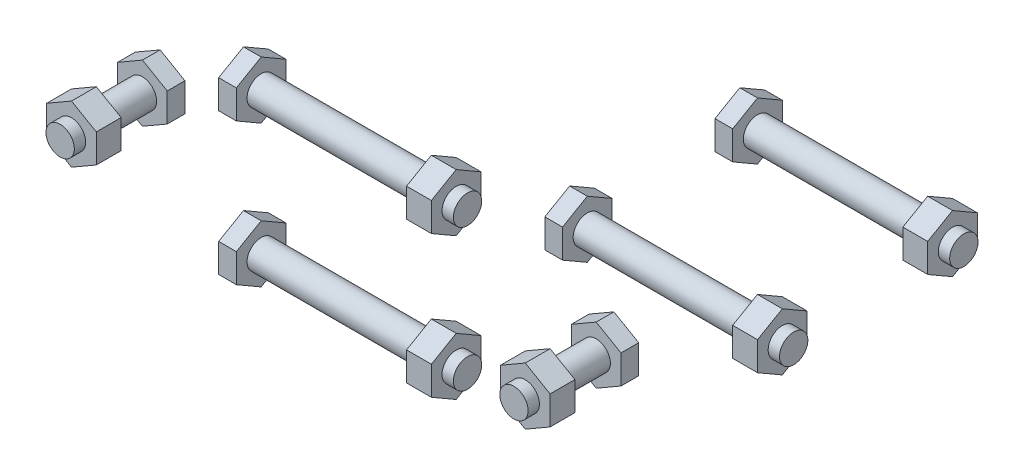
ISO-10303-21;
HEADER;
FILE_DESCRIPTION(('STEP AP214'),'2;1');
FILE_NAME('part.step','',(''),(''),'','','');
FILE_SCHEMA(('AUTOMOTIVE_DESIGN { 1 0 10303 214 1 1 1 1 }'));
ENDSEC;
DATA;
#1=APPLICATION_CONTEXT('core data for automotive mechanical design processes');
#2=APPLICATION_PROTOCOL_DEFINITION('international standard','automotive_design',2000,#1);
#3=PRODUCT_CONTEXT('',#1,'mechanical');
#4=PRODUCT('Part','Part','',(#3));
#5=PRODUCT_RELATED_PRODUCT_CATEGORY('part','',(#4));
#6=PRODUCT_DEFINITION_FORMATION('','',#4);
#7=PRODUCT_DEFINITION_CONTEXT('part definition',#1,'design');
#8=PRODUCT_DEFINITION('design','',#6,#7);
#9=PRODUCT_DEFINITION_SHAPE('','',#8);
#10=(LENGTH_UNIT() NAMED_UNIT(*) SI_UNIT(.MILLI.,.METRE.));
#11=(NAMED_UNIT(*) PLANE_ANGLE_UNIT() SI_UNIT($,.RADIAN.));
#12=(NAMED_UNIT(*) SI_UNIT($,.STERADIAN.) SOLID_ANGLE_UNIT());
#13=UNCERTAINTY_MEASURE_WITH_UNIT(LENGTH_MEASURE(1.E-05),#10,'distance_accuracy_value','');
#14=(GEOMETRIC_REPRESENTATION_CONTEXT(3) GLOBAL_UNCERTAINTY_ASSIGNED_CONTEXT((#13)) GLOBAL_UNIT_ASSIGNED_CONTEXT((#10,
#11,#12)) REPRESENTATION_CONTEXT('',''));
#15=CARTESIAN_POINT('',(0.,0.,0.));
#16=DIRECTION('',(0.,0.,1.));
#17=DIRECTION('',(1.,0.,0.));
#18=AXIS2_PLACEMENT_3D('',#15,#16,#17);
#19=CARTESIAN_POINT('',(-50.8,44.45,-9.121775));
#20=DIRECTION('',(0.,0.,1.));
#21=DIRECTION('',(1.,0.,0.));
#22=AXIS2_PLACEMENT_3D('',#19,#20,#21);
#23=PLANE('',#22);
#24=DIRECTION('',(0.,1.,0.));
#25=VECTOR('',#24,1.);
#26=CARTESIAN_POINT('',(-45.24375,41.242097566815,-9.121775));
#27=LINE('',#26,#25);
#28=CARTESIAN_POINT('',(-45.24375,41.242097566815,-9.121775));
#29=VERTEX_POINT('',#28);
#30=CARTESIAN_POINT('',(-45.24375,47.657902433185,-9.121775));
#31=VERTEX_POINT('',#30);
#32=EDGE_CURVE('P0_E191',#29,#31,#27,.T.);
#33=ORIENTED_EDGE('',*,*,#32,.F.);
#34=DIRECTION('',(0.866025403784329,0.50000000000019,0.));
#35=VECTOR('',#34,1.);
#36=CARTESIAN_POINT('',(-50.8,38.03419513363,-9.121775));
#37=LINE('',#36,#35);
#38=CARTESIAN_POINT('',(-50.8,38.03419513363,-9.121775));
#39=VERTEX_POINT('',#38);
#40=EDGE_CURVE('P0_E67',#39,#29,#37,.T.);
#41=ORIENTED_EDGE('',*,*,#40,.F.);
#42=DIRECTION('',(0.866025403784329,-0.50000000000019,0.));
#43=VECTOR('',#42,1.);
#44=CARTESIAN_POINT('',(-56.35625,41.242097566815,-9.121775));
#45=LINE('',#44,#43);
#46=CARTESIAN_POINT('',(-56.35625,41.242097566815,-9.121775));
#47=VERTEX_POINT('',#46);
#48=EDGE_CURVE('P0_E11',#47,#39,#45,.T.);
#49=ORIENTED_EDGE('',*,*,#48,.F.);
#50=DIRECTION('',(0.,-1.,0.));
#51=VECTOR('',#50,1.);
#52=CARTESIAN_POINT('',(-56.35625,47.657902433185,-9.121775));
#53=LINE('',#52,#51);
#54=CARTESIAN_POINT('',(-56.35625,47.657902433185,-9.121775));
#55=VERTEX_POINT('',#54);
#56=EDGE_CURVE('P0_E80',#55,#47,#53,.T.);
#57=ORIENTED_EDGE('',*,*,#56,.F.);
#58=DIRECTION('',(-0.866025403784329,-0.50000000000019,0.));
#59=VECTOR('',#58,1.);
#60=CARTESIAN_POINT('',(-50.8,50.86580486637,-9.121775));
#61=LINE('',#60,#59);
#62=CARTESIAN_POINT('',(-50.8,50.86580486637,-9.121775));
#63=VERTEX_POINT('',#62);
#64=EDGE_CURVE('P0_E197',#63,#55,#61,.T.);
#65=ORIENTED_EDGE('',*,*,#64,.F.);
#66=DIRECTION('',(-0.866025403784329,0.50000000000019,0.));
#67=VECTOR('',#66,1.);
#68=CARTESIAN_POINT('',(-45.24375,47.657902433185,-9.121775));
#69=LINE('',#68,#67);
#70=EDGE_CURVE('P0_E152',#31,#63,#69,.T.);
#71=ORIENTED_EDGE('',*,*,#70,.F.);
#72=EDGE_LOOP('',(#33,#41,#49,#57,#65,#71));
#73=FACE_BOUND('',#72,.T.);
#74=ADVANCED_FACE('P0_F17',(#73),#23,.F.);
#75=CARTESIAN_POINT('',(-56.35625,41.242097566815,-9.121775));
#76=DIRECTION('',(0.50000000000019,0.866025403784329,0.));
#77=DIRECTION('',(0.,0.,-1.));
#78=AXIS2_PLACEMENT_3D('',#75,#76,#77);
#79=PLANE('',#78);
#80=ORIENTED_EDGE('',*,*,#48,.T.);
#81=DIRECTION('',(0.,0.,1.));
#82=VECTOR('',#81,1.);
#83=CARTESIAN_POINT('',(-50.8,38.03419513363,-9.121775));
#84=LINE('',#83,#82);
#85=CARTESIAN_POINT('',(-50.8,38.03419513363,-5.159375));
#86=VERTEX_POINT('',#85);
#87=EDGE_CURVE('P0_E204',#39,#86,#84,.T.);
#88=ORIENTED_EDGE('',*,*,#87,.T.);
#89=DIRECTION('',(0.866025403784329,-0.50000000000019,0.));
#90=VECTOR('',#89,1.);
#91=CARTESIAN_POINT('',(-56.35625,41.242097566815,-5.159375));
#92=LINE('',#91,#90);
#93=CARTESIAN_POINT('',(-56.35625,41.242097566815,-5.159375));
#94=VERTEX_POINT('',#93);
#95=EDGE_CURVE('P0_E183',#94,#86,#92,.T.);
#96=ORIENTED_EDGE('',*,*,#95,.F.);
#97=DIRECTION('',(0.,0.,1.));
#98=VECTOR('',#97,1.);
#99=CARTESIAN_POINT('',(-56.35625,41.242097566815,-9.121775));
#100=LINE('',#99,#98);
#101=EDGE_CURVE('P0_E27',#47,#94,#100,.T.);
#102=ORIENTED_EDGE('',*,*,#101,.F.);
#103=EDGE_LOOP('',(#80,#88,#96,#102));
#104=FACE_BOUND('',#103,.T.);
#105=ADVANCED_FACE('P0_F355',(#104),#79,.F.);
#106=CARTESIAN_POINT('',(-56.35625,47.657902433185,-9.121775));
#107=DIRECTION('',(1.,0.,0.));
#108=DIRECTION('',(0.,1.,0.));
#109=AXIS2_PLACEMENT_3D('',#106,#107,#108);
#110=PLANE('',#109);
#111=ORIENTED_EDGE('',*,*,#56,.T.);
#112=ORIENTED_EDGE('',*,*,#101,.T.);
#113=DIRECTION('',(0.,-1.,0.));
#114=VECTOR('',#113,1.);
#115=CARTESIAN_POINT('',(-56.35625,47.657902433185,-5.159375));
#116=LINE('',#115,#114);
#117=CARTESIAN_POINT('',(-56.35625,47.657902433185,-5.159375));
#118=VERTEX_POINT('',#117);
#119=EDGE_CURVE('P0_E170',#118,#94,#116,.T.);
#120=ORIENTED_EDGE('',*,*,#119,.F.);
#121=DIRECTION('',(0.,0.,1.));
#122=VECTOR('',#121,1.);
#123=CARTESIAN_POINT('',(-56.35625,47.657902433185,-9.121775));
#124=LINE('',#123,#122);
#125=EDGE_CURVE('P0_E165',#55,#118,#124,.T.);
#126=ORIENTED_EDGE('',*,*,#125,.F.);
#127=EDGE_LOOP('',(#111,#112,#120,#126));
#128=FACE_BOUND('',#127,.T.);
#129=ADVANCED_FACE('P0_F207',(#128),#110,.F.);
#130=CARTESIAN_POINT('',(-50.8,38.03419513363,-9.121775));
#131=DIRECTION('',(-0.50000000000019,0.866025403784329,0.));
#132=DIRECTION('',(0.,0.,1.));
#133=AXIS2_PLACEMENT_3D('',#130,#131,#132);
#134=PLANE('',#133);
#135=ORIENTED_EDGE('',*,*,#40,.T.);
#136=DIRECTION('',(0.,0.,1.));
#137=VECTOR('',#136,1.);
#138=CARTESIAN_POINT('',(-45.24375,41.242097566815,-9.121775));
#139=LINE('',#138,#137);
#140=CARTESIAN_POINT('',(-45.24375,41.242097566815,-5.159375));
#141=VERTEX_POINT('',#140);
#142=EDGE_CURVE('P0_E192',#29,#141,#139,.T.);
#143=ORIENTED_EDGE('',*,*,#142,.T.);
#144=DIRECTION('',(0.866025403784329,0.50000000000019,0.));
#145=VECTOR('',#144,1.);
#146=CARTESIAN_POINT('',(-50.8,38.03419513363,-5.159375));
#147=LINE('',#146,#145);
#148=EDGE_CURVE('P0_E182',#86,#141,#147,.T.);
#149=ORIENTED_EDGE('',*,*,#148,.F.);
#150=ORIENTED_EDGE('',*,*,#87,.F.);
#151=EDGE_LOOP('',(#135,#143,#149,#150));
#152=FACE_BOUND('',#151,.T.);
#153=ADVANCED_FACE('P0_F359',(#152),#134,.F.);
#154=CARTESIAN_POINT('',(-50.8,50.86580486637,-9.121775));
#155=DIRECTION('',(0.50000000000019,-0.866025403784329,0.));
#156=DIRECTION('',(0.,0.,-1.));
#157=AXIS2_PLACEMENT_3D('',#154,#155,#156);
#158=PLANE('',#157);
#159=ORIENTED_EDGE('',*,*,#64,.T.);
#160=ORIENTED_EDGE('',*,*,#125,.T.);
#161=DIRECTION('',(-0.866025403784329,-0.50000000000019,0.));
#162=VECTOR('',#161,1.);
#163=CARTESIAN_POINT('',(-50.8,50.86580486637,-5.159375));
#164=LINE('',#163,#162);
#165=CARTESIAN_POINT('',(-50.8,50.86580486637,-5.159375));
#166=VERTEX_POINT('',#165);
#167=EDGE_CURVE('P0_E159',#166,#118,#164,.T.);
#168=ORIENTED_EDGE('',*,*,#167,.F.);
#169=DIRECTION('',(0.,0.,1.));
#170=VECTOR('',#169,1.);
#171=CARTESIAN_POINT('',(-50.8,50.86580486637,-9.121775));
#172=LINE('',#171,#170);
#173=EDGE_CURVE('P0_E146',#63,#166,#172,.T.);
#174=ORIENTED_EDGE('',*,*,#173,.F.);
#175=EDGE_LOOP('',(#159,#160,#168,#174));
#176=FACE_BOUND('',#175,.T.);
#177=ADVANCED_FACE('P0_F161',(#176),#158,.F.);
#178=CARTESIAN_POINT('',(-45.24375,41.242097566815,-9.121775));
#179=DIRECTION('',(-1.,0.,0.));
#180=DIRECTION('',(0.,0.,1.));
#181=AXIS2_PLACEMENT_3D('',#178,#179,#180);
#182=PLANE('',#181);
#183=ORIENTED_EDGE('',*,*,#32,.T.);
#184=DIRECTION('',(0.,0.,1.));
#185=VECTOR('',#184,1.);
#186=CARTESIAN_POINT('',(-45.24375,47.657902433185,-9.121775));
#187=LINE('',#186,#185);
#188=CARTESIAN_POINT('',(-45.24375,47.657902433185,-5.159375));
#189=VERTEX_POINT('',#188);
#190=EDGE_CURVE('P0_E139',#31,#189,#187,.T.);
#191=ORIENTED_EDGE('',*,*,#190,.T.);
#192=DIRECTION('',(0.,1.,0.));
#193=VECTOR('',#192,1.);
#194=CARTESIAN_POINT('',(-45.24375,41.242097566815,-5.159375));
#195=LINE('',#194,#193);
#196=EDGE_CURVE('P0_E171',#141,#189,#195,.T.);
#197=ORIENTED_EDGE('',*,*,#196,.F.);
#198=ORIENTED_EDGE('',*,*,#142,.F.);
#199=EDGE_LOOP('',(#183,#191,#197,#198));
#200=FACE_BOUND('',#199,.T.);
#201=ADVANCED_FACE('P0_F215',(#200),#182,.F.);
#202=CARTESIAN_POINT('',(-45.24375,47.657902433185,-9.121775));
#203=DIRECTION('',(-0.50000000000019,-0.866025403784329,0.));
#204=DIRECTION('',(-0.866025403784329,0.50000000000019,0.));
#205=AXIS2_PLACEMENT_3D('',#202,#203,#204);
#206=PLANE('',#205);
#207=ORIENTED_EDGE('',*,*,#70,.T.);
#208=ORIENTED_EDGE('',*,*,#173,.T.);
#209=DIRECTION('',(-0.866025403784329,0.50000000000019,0.));
#210=VECTOR('',#209,1.);
#211=CARTESIAN_POINT('',(-45.24375,47.657902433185,-5.159375));
#212=LINE('',#211,#210);
#213=EDGE_CURVE('P0_E155',#189,#166,#212,.T.);
#214=ORIENTED_EDGE('',*,*,#213,.F.);
#215=ORIENTED_EDGE('',*,*,#190,.F.);
#216=EDGE_LOOP('',(#207,#208,#214,#215));
#217=FACE_BOUND('',#216,.T.);
#218=ADVANCED_FACE('P0_F147',(#217),#206,.F.);
#219=CARTESIAN_POINT('',(-50.8,44.45,-5.159375));
#220=DIRECTION('',(0.,0.,1.));
#221=DIRECTION('',(1.,0.,0.));
#222=AXIS2_PLACEMENT_3D('',#219,#220,#221);
#223=PLANE('',#222);
#224=CARTESIAN_POINT('',(-50.8,44.45,-5.159375));
#225=DIRECTION('',(0.,0.,1.));
#226=DIRECTION('',(1.,0.,0.));
#227=AXIS2_PLACEMENT_3D('',#224,#225,#226);
#228=CIRCLE('',#227,3.175);
#229=CARTESIAN_POINT('',(-47.625,44.45,-5.159375));
#230=VERTEX_POINT('',#229);
#231=EDGE_CURVE('P0_E174',#230,#230,#228,.T.);
#232=ORIENTED_EDGE('',*,*,#231,.F.);
#233=EDGE_LOOP('',(#232));
#234=FACE_BOUND('',#233,.T.);
#235=ORIENTED_EDGE('',*,*,#213,.T.);
#236=ORIENTED_EDGE('',*,*,#167,.T.);
#237=ORIENTED_EDGE('',*,*,#119,.T.);
#238=ORIENTED_EDGE('',*,*,#95,.T.);
#239=ORIENTED_EDGE('',*,*,#148,.T.);
#240=ORIENTED_EDGE('',*,*,#196,.T.);
#241=EDGE_LOOP('',(#235,#236,#237,#238,#239,#240));
#242=FACE_BOUND('',#241,.T.);
#243=ADVANCED_FACE('P0_F166',(#234,#242),#223,.T.);
#244=CARTESIAN_POINT('',(-50.8,44.45,-5.159375));
#245=DIRECTION('',(0.,0.,1.));
#246=DIRECTION('',(1.,0.,0.));
#247=AXIS2_PLACEMENT_3D('',#244,#245,#246);
#248=CYLINDRICAL_SURFACE('',#247,3.175);
#249=CARTESIAN_POINT('',(-50.8,44.45,5.159375));
#250=DIRECTION('',(0.,0.,1.));
#251=DIRECTION('',(1.,0.,0.));
#252=AXIS2_PLACEMENT_3D('',#249,#250,#251);
#253=CIRCLE('',#252,3.175);
#254=CARTESIAN_POINT('',(-47.625,44.45,5.159375));
#255=VERTEX_POINT('',#254);
#256=EDGE_CURVE('P0_E239',#255,#255,#253,.T.);
#257=ORIENTED_EDGE('',*,*,#256,.F.);
#258=DIRECTION('',(0.,0.,1.));
#259=VECTOR('',#258,1.);
#260=CARTESIAN_POINT('',(-47.625,44.45,-5.159375));
#261=LINE('',#260,#259);
#262=EDGE_CURVE('P0_E180',#230,#255,#261,.T.);
#263=ORIENTED_EDGE('',*,*,#262,.F.);
#264=ORIENTED_EDGE('',*,*,#231,.T.);
#265=ORIENTED_EDGE('',*,*,#262,.T.);
#266=EDGE_LOOP('',(#257,#263,#264,#265));
#267=FACE_BOUND('',#266,.T.);
#268=ADVANCED_FACE('P0_F391',(#267),#248,.T.);
#269=CARTESIAN_POINT('',(-50.8,44.45,5.159375));
#270=DIRECTION('',(0.,0.,1.));
#271=DIRECTION('',(1.,0.,0.));
#272=AXIS2_PLACEMENT_3D('',#269,#270,#271);
#273=PLANE('',#272);
#274=ORIENTED_EDGE('',*,*,#256,.T.);
#275=EDGE_LOOP('',(#274));
#276=FACE_BOUND('',#275,.T.);
#277=DIRECTION('',(0.,1.,0.));
#278=VECTOR('',#277,1.);
#279=CARTESIAN_POINT('',(-45.24375,41.242097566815,5.159375));
#280=LINE('',#279,#278);
#281=CARTESIAN_POINT('',(-45.24375,41.242097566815,5.159375));
#282=VERTEX_POINT('',#281);
#283=CARTESIAN_POINT('',(-45.24375,47.657902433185,5.159375));
#284=VERTEX_POINT('',#283);
#285=EDGE_CURVE('P0_E279',#282,#284,#280,.T.);
#286=ORIENTED_EDGE('',*,*,#285,.F.);
#287=DIRECTION('',(0.866025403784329,0.50000000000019,0.));
#288=VECTOR('',#287,1.);
#289=CARTESIAN_POINT('',(-50.8,38.03419513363,5.159375));
#290=LINE('',#289,#288);
#291=CARTESIAN_POINT('',(-50.8,38.03419513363,5.159375));
#292=VERTEX_POINT('',#291);
#293=EDGE_CURVE('P0_E225',#292,#282,#290,.T.);
#294=ORIENTED_EDGE('',*,*,#293,.F.);
#295=DIRECTION('',(0.866025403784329,-0.50000000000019,0.));
#296=VECTOR('',#295,1.);
#297=CARTESIAN_POINT('',(-56.35625,41.242097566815,5.159375));
#298=LINE('',#297,#296);
#299=CARTESIAN_POINT('',(-56.35625,41.242097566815,5.159375));
#300=VERTEX_POINT('',#299);
#301=EDGE_CURVE('P0_E234',#300,#292,#298,.T.);
#302=ORIENTED_EDGE('',*,*,#301,.F.);
#303=DIRECTION('',(0.,-1.,0.));
#304=VECTOR('',#303,1.);
#305=CARTESIAN_POINT('',(-56.35625,47.657902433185,5.159375));
#306=LINE('',#305,#304);
#307=CARTESIAN_POINT('',(-56.35625,47.657902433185,5.159375));
#308=VERTEX_POINT('',#307);
#309=EDGE_CURVE('P0_E229',#308,#300,#306,.T.);
#310=ORIENTED_EDGE('',*,*,#309,.F.);
#311=DIRECTION('',(-0.866025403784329,-0.50000000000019,0.));
#312=VECTOR('',#311,1.);
#313=CARTESIAN_POINT('',(-50.8,50.86580486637,5.159375));
#314=LINE('',#313,#312);
#315=CARTESIAN_POINT('',(-50.8,50.86580486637,5.159375));
#316=VERTEX_POINT('',#315);
#317=EDGE_CURVE('P0_E282',#316,#308,#314,.T.);
#318=ORIENTED_EDGE('',*,*,#317,.F.);
#319=DIRECTION('',(-0.866025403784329,0.50000000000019,0.));
#320=VECTOR('',#319,1.);
#321=CARTESIAN_POINT('',(-45.24375,47.657902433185,5.159375));
#322=LINE('',#321,#320);
#323=EDGE_CURVE('P0_E273',#284,#316,#322,.T.);
#324=ORIENTED_EDGE('',*,*,#323,.F.);
#325=EDGE_LOOP('',(#286,#294,#302,#310,#318,#324));
#326=FACE_BOUND('',#325,.T.);
#327=ADVANCED_FACE('P0_F371',(#276,#326),#273,.F.);
#328=CARTESIAN_POINT('',(-56.35625,41.242097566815,5.159375));
#329=DIRECTION('',(0.50000000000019,0.866025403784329,0.));
#330=DIRECTION('',(0.,0.,-1.));
#331=AXIS2_PLACEMENT_3D('',#328,#329,#330);
#332=PLANE('',#331);
#333=ORIENTED_EDGE('',*,*,#301,.T.);
#334=DIRECTION('',(0.,0.,1.));
#335=VECTOR('',#334,1.);
#336=CARTESIAN_POINT('',(-50.8,38.03419513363,5.159375));
#337=LINE('',#336,#335);
#338=CARTESIAN_POINT('',(-50.8,38.03419513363,10.721975));
#339=VERTEX_POINT('',#338);
#340=EDGE_CURVE('P0_E221',#292,#339,#337,.T.);
#341=ORIENTED_EDGE('',*,*,#340,.T.);
#342=DIRECTION('',(0.866025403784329,-0.50000000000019,0.));
#343=VECTOR('',#342,1.);
#344=CARTESIAN_POINT('',(-56.35625,41.242097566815,10.721975));
#345=LINE('',#344,#343);
#346=CARTESIAN_POINT('',(-56.35625,41.242097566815,10.721975));
#347=VERTEX_POINT('',#346);
#348=EDGE_CURVE('P0_E262',#347,#339,#345,.T.);
#349=ORIENTED_EDGE('',*,*,#348,.F.);
#350=DIRECTION('',(0.,0.,1.));
#351=VECTOR('',#350,1.);
#352=CARTESIAN_POINT('',(-56.35625,41.242097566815,5.159375));
#353=LINE('',#352,#351);
#354=EDGE_CURVE('P0_E235',#300,#347,#353,.T.);
#355=ORIENTED_EDGE('',*,*,#354,.F.);
#356=EDGE_LOOP('',(#333,#341,#349,#355));
#357=FACE_BOUND('',#356,.T.);
#358=ADVANCED_FACE('P0_F370',(#357),#332,.F.);
#359=CARTESIAN_POINT('',(-56.35625,47.657902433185,5.159375));
#360=DIRECTION('',(1.,0.,0.));
#361=DIRECTION('',(0.,1.,0.));
#362=AXIS2_PLACEMENT_3D('',#359,#360,#361);
#363=PLANE('',#362);
#364=ORIENTED_EDGE('',*,*,#309,.T.);
#365=ORIENTED_EDGE('',*,*,#354,.T.);
#366=DIRECTION('',(0.,-1.,0.));
#367=VECTOR('',#366,1.);
#368=CARTESIAN_POINT('',(-56.35625,47.657902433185,10.721975));
#369=LINE('',#368,#367);
#370=CARTESIAN_POINT('',(-56.35625,47.657902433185,10.721975));
#371=VERTEX_POINT('',#370);
#372=EDGE_CURVE('P0_E259',#371,#347,#369,.T.);
#373=ORIENTED_EDGE('',*,*,#372,.F.);
#374=DIRECTION('',(0.,0.,1.));
#375=VECTOR('',#374,1.);
#376=CARTESIAN_POINT('',(-56.35625,47.657902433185,5.159375));
#377=LINE('',#376,#375);
#378=EDGE_CURVE('P0_E219',#308,#371,#377,.T.);
#379=ORIENTED_EDGE('',*,*,#378,.F.);
#380=EDGE_LOOP('',(#364,#365,#373,#379));
#381=FACE_BOUND('',#380,.T.);
#382=ADVANCED_FACE('P0_F367',(#381),#363,.F.);
#383=CARTESIAN_POINT('',(-50.8,38.03419513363,5.159375));
#384=DIRECTION('',(-0.50000000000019,0.866025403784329,0.));
#385=DIRECTION('',(0.,0.,1.));
#386=AXIS2_PLACEMENT_3D('',#383,#384,#385);
#387=PLANE('',#386);
#388=ORIENTED_EDGE('',*,*,#293,.T.);
#389=DIRECTION('',(0.,0.,1.));
#390=VECTOR('',#389,1.);
#391=CARTESIAN_POINT('',(-45.24375,41.242097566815,5.159375));
#392=LINE('',#391,#390);
#393=CARTESIAN_POINT('',(-45.24375,41.242097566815,10.721975));
#394=VERTEX_POINT('',#393);
#395=EDGE_CURVE('P0_E278',#282,#394,#392,.T.);
#396=ORIENTED_EDGE('',*,*,#395,.T.);
#397=DIRECTION('',(0.866025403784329,0.50000000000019,0.));
#398=VECTOR('',#397,1.);
#399=CARTESIAN_POINT('',(-50.8,38.03419513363,10.721975));
#400=LINE('',#399,#398);
#401=EDGE_CURVE('P0_E264',#339,#394,#400,.T.);
#402=ORIENTED_EDGE('',*,*,#401,.F.);
#403=ORIENTED_EDGE('',*,*,#340,.F.);
#404=EDGE_LOOP('',(#388,#396,#402,#403));
#405=FACE_BOUND('',#404,.T.);
#406=ADVANCED_FACE('P0_F373',(#405),#387,.F.);
#407=CARTESIAN_POINT('',(-50.8,50.86580486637,5.159375));
#408=DIRECTION('',(0.50000000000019,-0.866025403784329,0.));
#409=DIRECTION('',(0.,0.,-1.));
#410=AXIS2_PLACEMENT_3D('',#407,#408,#409);
#411=PLANE('',#410);
#412=ORIENTED_EDGE('',*,*,#317,.T.);
#413=ORIENTED_EDGE('',*,*,#378,.T.);
#414=DIRECTION('',(-0.866025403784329,-0.50000000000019,0.));
#415=VECTOR('',#414,1.);
#416=CARTESIAN_POINT('',(-50.8,50.86580486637,10.721975));
#417=LINE('',#416,#415);
#418=CARTESIAN_POINT('',(-50.8,50.86580486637,10.721975));
#419=VERTEX_POINT('',#418);
#420=EDGE_CURVE('P0_E258',#419,#371,#417,.T.);
#421=ORIENTED_EDGE('',*,*,#420,.F.);
#422=DIRECTION('',(0.,0.,1.));
#423=VECTOR('',#422,1.);
#424=CARTESIAN_POINT('',(-50.8,50.86580486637,5.159375));
#425=LINE('',#424,#423);
#426=EDGE_CURVE('P0_E269',#316,#419,#425,.T.);
#427=ORIENTED_EDGE('',*,*,#426,.F.);
#428=EDGE_LOOP('',(#412,#413,#421,#427));
#429=FACE_BOUND('',#428,.T.);
#430=ADVANCED_FACE('P0_F376',(#429),#411,.F.);
#431=CARTESIAN_POINT('',(-45.24375,41.242097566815,5.159375));
#432=DIRECTION('',(-1.,0.,0.));
#433=DIRECTION('',(0.,0.,1.));
#434=AXIS2_PLACEMENT_3D('',#431,#432,#433);
#435=PLANE('',#434);
#436=ORIENTED_EDGE('',*,*,#285,.T.);
#437=DIRECTION('',(0.,0.,1.));
#438=VECTOR('',#437,1.);
#439=CARTESIAN_POINT('',(-45.24375,47.657902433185,5.159375));
#440=LINE('',#439,#438);
#441=CARTESIAN_POINT('',(-45.24375,47.657902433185,10.721975));
#442=VERTEX_POINT('',#441);
#443=EDGE_CURVE('P0_E272',#284,#442,#440,.T.);
#444=ORIENTED_EDGE('',*,*,#443,.T.);
#445=DIRECTION('',(0.,1.,0.));
#446=VECTOR('',#445,1.);
#447=CARTESIAN_POINT('',(-45.24375,41.242097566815,10.721975));
#448=LINE('',#447,#446);
#449=EDGE_CURVE('P0_E267',#394,#442,#448,.T.);
#450=ORIENTED_EDGE('',*,*,#449,.F.);
#451=ORIENTED_EDGE('',*,*,#395,.F.);
#452=EDGE_LOOP('',(#436,#444,#450,#451));
#453=FACE_BOUND('',#452,.T.);
#454=ADVANCED_FACE('P0_F385',(#453),#435,.F.);
#455=CARTESIAN_POINT('',(-45.24375,47.657902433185,5.159375));
#456=DIRECTION('',(-0.50000000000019,-0.866025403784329,0.));
#457=DIRECTION('',(-0.866025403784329,0.50000000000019,0.));
#458=AXIS2_PLACEMENT_3D('',#455,#456,#457);
#459=PLANE('',#458);
#460=ORIENTED_EDGE('',*,*,#323,.T.);
#461=ORIENTED_EDGE('',*,*,#426,.T.);
#462=DIRECTION('',(-0.866025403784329,0.50000000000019,0.));
#463=VECTOR('',#462,1.);
#464=CARTESIAN_POINT('',(-45.24375,47.657902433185,10.721975));
#465=LINE('',#464,#463);
#466=EDGE_CURVE('P0_E257',#442,#419,#465,.T.);
#467=ORIENTED_EDGE('',*,*,#466,.F.);
#468=ORIENTED_EDGE('',*,*,#443,.F.);
#469=EDGE_LOOP('',(#460,#461,#467,#468));
#470=FACE_BOUND('',#469,.T.);
#471=ADVANCED_FACE('P0_F320',(#470),#459,.F.);
#472=CARTESIAN_POINT('',(-50.8,44.45,13.261975));
#473=DIRECTION('',(0.,0.,1.));
#474=DIRECTION('',(1.,0.,0.));
#475=AXIS2_PLACEMENT_3D('',#472,#473,#474);
#476=PLANE('',#475);
#477=CARTESIAN_POINT('',(-50.8,44.45,13.261975));
#478=DIRECTION('',(0.,0.,1.));
#479=DIRECTION('',(1.,0.,0.));
#480=AXIS2_PLACEMENT_3D('',#477,#478,#479);
#481=CIRCLE('',#480,3.175);
#482=CARTESIAN_POINT('',(-47.625,44.45,13.261975));
#483=VERTEX_POINT('',#482);
#484=EDGE_CURVE('P0_E297',#483,#483,#481,.T.);
#485=ORIENTED_EDGE('',*,*,#484,.T.);
#486=EDGE_LOOP('',(#485));
#487=FACE_BOUND('',#486,.T.);
#488=ADVANCED_FACE('P0_F340',(#487),#476,.T.);
#489=CARTESIAN_POINT('',(-50.8,44.45,10.721975));
#490=DIRECTION('',(0.,0.,1.));
#491=DIRECTION('',(1.,0.,0.));
#492=AXIS2_PLACEMENT_3D('',#489,#490,#491);
#493=PLANE('',#492);
#494=CARTESIAN_POINT('',(-50.8,44.45,10.721975));
#495=DIRECTION('',(0.,0.,1.));
#496=DIRECTION('',(1.,0.,0.));
#497=AXIS2_PLACEMENT_3D('',#494,#495,#496);
#498=CIRCLE('',#497,3.175);
#499=CARTESIAN_POINT('',(-47.625,44.45,10.721975));
#500=VERTEX_POINT('',#499);
#501=EDGE_CURVE('P0_E305',#500,#500,#498,.T.);
#502=ORIENTED_EDGE('',*,*,#501,.F.);
#503=EDGE_LOOP('',(#502));
#504=FACE_BOUND('',#503,.T.);
#505=ORIENTED_EDGE('',*,*,#466,.T.);
#506=ORIENTED_EDGE('',*,*,#420,.T.);
#507=ORIENTED_EDGE('',*,*,#372,.T.);
#508=ORIENTED_EDGE('',*,*,#348,.T.);
#509=ORIENTED_EDGE('',*,*,#401,.T.);
#510=ORIENTED_EDGE('',*,*,#449,.T.);
#511=EDGE_LOOP('',(#505,#506,#507,#508,#509,#510));
#512=FACE_BOUND('',#511,.T.);
#513=ADVANCED_FACE('P0_F311',(#504,#512),#493,.T.);
#514=CARTESIAN_POINT('',(-50.8,44.45,-5.159375));
#515=DIRECTION('',(0.,0.,1.));
#516=DIRECTION('',(1.,0.,0.));
#517=AXIS2_PLACEMENT_3D('',#514,#515,#516);
#518=CYLINDRICAL_SURFACE('',#517,3.175);
#519=DIRECTION('',(0.,0.,1.));
#520=VECTOR('',#519,1.);
#521=CARTESIAN_POINT('',(-47.625,44.45,-5.159375));
#522=LINE('',#521,#520);
#523=EDGE_CURVE('P0_E337',#500,#483,#522,.T.);
#524=ORIENTED_EDGE('',*,*,#523,.T.);
#525=ORIENTED_EDGE('',*,*,#484,.F.);
#526=ORIENTED_EDGE('',*,*,#523,.F.);
#527=ORIENTED_EDGE('',*,*,#501,.T.);
#528=EDGE_LOOP('',(#524,#525,#526,#527));
#529=FACE_BOUND('',#528,.T.);
#530=ADVANCED_FACE('P0_F333',(#529),#518,.T.);
#531=CLOSED_SHELL('',(#74,#105,#129,#153,#177,#201,#218,#243,#268,#327,#358,#382,#406,#430,#454,
#471,#488,#513,#530));
#532=MANIFOLD_SOLID_BREP('P0_B1',#531);
#533=CARTESIAN_POINT('',(50.8,44.45,-9.121775));
#534=DIRECTION('',(0.,0.,1.));
#535=DIRECTION('',(1.,0.,0.));
#536=AXIS2_PLACEMENT_3D('',#533,#534,#535);
#537=PLANE('',#536);
#538=DIRECTION('',(0.,1.,0.));
#539=VECTOR('',#538,1.);
#540=CARTESIAN_POINT('',(56.35625,41.242097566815,-9.121775));
#541=LINE('',#540,#539);
#542=CARTESIAN_POINT('',(56.35625,41.242097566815,-9.121775));
#543=VERTEX_POINT('',#542);
#544=CARTESIAN_POINT('',(56.35625,47.657902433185,-9.121775));
#545=VERTEX_POINT('',#544);
#546=EDGE_CURVE('P1_E182',#543,#545,#541,.T.);
#547=ORIENTED_EDGE('',*,*,#546,.F.);
#548=DIRECTION('',(0.866025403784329,0.50000000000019,0.));
#549=VECTOR('',#548,1.);
#550=CARTESIAN_POINT('',(50.8,38.03419513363,-9.121775));
#551=LINE('',#550,#549);
#552=CARTESIAN_POINT('',(50.8,38.03419513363,-9.121775));
#553=VERTEX_POINT('',#552);
#554=EDGE_CURVE('P1_E279',#553,#543,#551,.T.);
#555=ORIENTED_EDGE('',*,*,#554,.F.);
#556=DIRECTION('',(0.866025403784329,-0.50000000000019,0.));
#557=VECTOR('',#556,1.);
#558=CARTESIAN_POINT('',(45.24375,41.242097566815,-9.121775));
#559=LINE('',#558,#557);
#560=CARTESIAN_POINT('',(45.24375,41.242097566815,-9.121775));
#561=VERTEX_POINT('',#560);
#562=EDGE_CURVE('P1_E11',#561,#553,#559,.T.);
#563=ORIENTED_EDGE('',*,*,#562,.F.);
#564=DIRECTION('',(0.,-1.,0.));
#565=VECTOR('',#564,1.);
#566=CARTESIAN_POINT('',(45.24375,47.657902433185,-9.121775));
#567=LINE('',#566,#565);
#568=CARTESIAN_POINT('',(45.24375,47.657902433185,-9.121775));
#569=VERTEX_POINT('',#568);
#570=EDGE_CURVE('P1_E284',#569,#561,#567,.T.);
#571=ORIENTED_EDGE('',*,*,#570,.F.);
#572=DIRECTION('',(-0.866025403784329,-0.50000000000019,0.));
#573=VECTOR('',#572,1.);
#574=CARTESIAN_POINT('',(50.8,50.86580486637,-9.121775));
#575=LINE('',#574,#573);
#576=CARTESIAN_POINT('',(50.8,50.86580486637,-9.121775));
#577=VERTEX_POINT('',#576);
#578=EDGE_CURVE('P1_E183',#577,#569,#575,.T.);
#579=ORIENTED_EDGE('',*,*,#578,.F.);
#580=DIRECTION('',(-0.866025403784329,0.50000000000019,0.));
#581=VECTOR('',#580,1.);
#582=CARTESIAN_POINT('',(56.35625,47.657902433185,-9.121775));
#583=LINE('',#582,#581);
#584=EDGE_CURVE('P1_E174',#545,#577,#583,.T.);
#585=ORIENTED_EDGE('',*,*,#584,.F.);
#586=EDGE_LOOP('',(#547,#555,#563,#571,#579,#585));
#587=FACE_BOUND('',#586,.T.);
#588=ADVANCED_FACE('P1_F17',(#587),#537,.F.);
#589=CARTESIAN_POINT('',(45.24375,41.242097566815,-9.121775));
#590=DIRECTION('',(0.50000000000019,0.866025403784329,0.));
#591=DIRECTION('',(0.,0.,-1.));
#592=AXIS2_PLACEMENT_3D('',#589,#590,#591);
#593=PLANE('',#592);
#594=ORIENTED_EDGE('',*,*,#562,.T.);
#595=DIRECTION('',(0.,0.,1.));
#596=VECTOR('',#595,1.);
#597=CARTESIAN_POINT('',(50.8,38.03419513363,-9.121775));
#598=LINE('',#597,#596);
#599=CARTESIAN_POINT('',(50.8,38.03419513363,-5.159375));
#600=VERTEX_POINT('',#599);
#601=EDGE_CURVE('P1_E281',#553,#600,#598,.T.);
#602=ORIENTED_EDGE('',*,*,#601,.T.);
#603=DIRECTION('',(0.866025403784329,-0.50000000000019,0.));
#604=VECTOR('',#603,1.);
#605=CARTESIAN_POINT('',(45.24375,41.242097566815,-5.159375));
#606=LINE('',#605,#604);
#607=CARTESIAN_POINT('',(45.24375,41.242097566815,-5.159375));
#608=VERTEX_POINT('',#607);
#609=EDGE_CURVE('P1_E255',#608,#600,#606,.T.);
#610=ORIENTED_EDGE('',*,*,#609,.F.);
#611=DIRECTION('',(0.,0.,1.));
#612=VECTOR('',#611,1.);
#613=CARTESIAN_POINT('',(45.24375,41.242097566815,-9.121775));
#614=LINE('',#613,#612);
#615=EDGE_CURVE('P1_E25',#561,#608,#614,.T.);
#616=ORIENTED_EDGE('',*,*,#615,.F.);
#617=EDGE_LOOP('',(#594,#602,#610,#616));
#618=FACE_BOUND('',#617,.T.);
#619=ADVANCED_FACE('P1_F351',(#618),#593,.F.);
#620=CARTESIAN_POINT('',(45.24375,47.657902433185,-9.121775));
#621=DIRECTION('',(1.,0.,0.));
#622=DIRECTION('',(0.,1.,0.));
#623=AXIS2_PLACEMENT_3D('',#620,#621,#622);
#624=PLANE('',#623);
#625=ORIENTED_EDGE('',*,*,#570,.T.);
#626=ORIENTED_EDGE('',*,*,#615,.T.);
#627=DIRECTION('',(0.,-1.,0.));
#628=VECTOR('',#627,1.);
#629=CARTESIAN_POINT('',(45.24375,47.657902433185,-5.159375));
#630=LINE('',#629,#628);
#631=CARTESIAN_POINT('',(45.24375,47.657902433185,-5.159375));
#632=VERTEX_POINT('',#631);
#633=EDGE_CURVE('P1_E249',#632,#608,#630,.T.);
#634=ORIENTED_EDGE('',*,*,#633,.F.);
#635=DIRECTION('',(0.,0.,1.));
#636=VECTOR('',#635,1.);
#637=CARTESIAN_POINT('',(45.24375,47.657902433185,-9.121775));
#638=LINE('',#637,#636);
#639=EDGE_CURVE('P1_E271',#569,#632,#638,.T.);
#640=ORIENTED_EDGE('',*,*,#639,.F.);
#641=EDGE_LOOP('',(#625,#626,#634,#640));
#642=FACE_BOUND('',#641,.T.);
#643=ADVANCED_FACE('P1_F354',(#642),#624,.F.);
#644=CARTESIAN_POINT('',(50.8,38.03419513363,-9.121775));
#645=DIRECTION('',(-0.50000000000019,0.866025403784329,0.));
#646=DIRECTION('',(0.,0.,1.));
#647=AXIS2_PLACEMENT_3D('',#644,#645,#646);
#648=PLANE('',#647);
#649=ORIENTED_EDGE('',*,*,#554,.T.);
#650=DIRECTION('',(0.,0.,1.));
#651=VECTOR('',#650,1.);
#652=CARTESIAN_POINT('',(56.35625,41.242097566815,-9.121775));
#653=LINE('',#652,#651);
#654=CARTESIAN_POINT('',(56.35625,41.242097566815,-5.159375));
#655=VERTEX_POINT('',#654);
#656=EDGE_CURVE('P1_E179',#543,#655,#653,.T.);
#657=ORIENTED_EDGE('',*,*,#656,.T.);
#658=DIRECTION('',(0.866025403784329,0.50000000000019,0.));
#659=VECTOR('',#658,1.);
#660=CARTESIAN_POINT('',(50.8,38.03419513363,-5.159375));
#661=LINE('',#660,#659);
#662=EDGE_CURVE('P1_E173',#600,#655,#661,.T.);
#663=ORIENTED_EDGE('',*,*,#662,.F.);
#664=ORIENTED_EDGE('',*,*,#601,.F.);
#665=EDGE_LOOP('',(#649,#657,#663,#664));
#666=FACE_BOUND('',#665,.T.);
#667=ADVANCED_FACE('P1_F371',(#666),#648,.F.);
#668=CARTESIAN_POINT('',(50.8,50.86580486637,-9.121775));
#669=DIRECTION('',(0.50000000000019,-0.866025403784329,0.));
#670=DIRECTION('',(0.,0.,-1.));
#671=AXIS2_PLACEMENT_3D('',#668,#669,#670);
#672=PLANE('',#671);
#673=ORIENTED_EDGE('',*,*,#578,.T.);
#674=ORIENTED_EDGE('',*,*,#639,.T.);
#675=DIRECTION('',(-0.866025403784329,-0.50000000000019,0.));
#676=VECTOR('',#675,1.);
#677=CARTESIAN_POINT('',(50.8,50.86580486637,-5.159375));
#678=LINE('',#677,#676);
#679=CARTESIAN_POINT('',(50.8,50.86580486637,-5.159375));
#680=VERTEX_POINT('',#679);
#681=EDGE_CURVE('P1_E246',#680,#632,#678,.T.);
#682=ORIENTED_EDGE('',*,*,#681,.F.);
#683=DIRECTION('',(0.,0.,1.));
#684=VECTOR('',#683,1.);
#685=CARTESIAN_POINT('',(50.8,50.86580486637,-9.121775));
#686=LINE('',#685,#684);
#687=EDGE_CURVE('P1_E262',#577,#680,#686,.T.);
#688=ORIENTED_EDGE('',*,*,#687,.F.);
#689=EDGE_LOOP('',(#673,#674,#682,#688));
#690=FACE_BOUND('',#689,.T.);
#691=ADVANCED_FACE('P1_F373',(#690),#672,.F.);
#692=CARTESIAN_POINT('',(56.35625,41.242097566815,-9.121775));
#693=DIRECTION('',(-1.,0.,0.));
#694=DIRECTION('',(0.,0.,1.));
#695=AXIS2_PLACEMENT_3D('',#692,#693,#694);
#696=PLANE('',#695);
#697=ORIENTED_EDGE('',*,*,#546,.T.);
#698=DIRECTION('',(0.,0.,1.));
#699=VECTOR('',#698,1.);
#700=CARTESIAN_POINT('',(56.35625,47.657902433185,-9.121775));
#701=LINE('',#700,#699);
#702=CARTESIAN_POINT('',(56.35625,47.657902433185,-5.159375));
#703=VERTEX_POINT('',#702);
#704=EDGE_CURVE('P1_E270',#545,#703,#701,.T.);
#705=ORIENTED_EDGE('',*,*,#704,.T.);
#706=DIRECTION('',(0.,1.,0.));
#707=VECTOR('',#706,1.);
#708=CARTESIAN_POINT('',(56.35625,41.242097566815,-5.159375));
#709=LINE('',#708,#707);
#710=EDGE_CURVE('P1_E166',#655,#703,#709,.T.);
#711=ORIENTED_EDGE('',*,*,#710,.F.);
#712=ORIENTED_EDGE('',*,*,#656,.F.);
#713=EDGE_LOOP('',(#697,#705,#711,#712));
#714=FACE_BOUND('',#713,.T.);
#715=ADVANCED_FACE('P1_F363',(#714),#696,.F.);
#716=CARTESIAN_POINT('',(56.35625,47.657902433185,-9.121775));
#717=DIRECTION('',(-0.50000000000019,-0.866025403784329,0.));
#718=DIRECTION('',(-0.866025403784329,0.50000000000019,0.));
#719=AXIS2_PLACEMENT_3D('',#716,#717,#718);
#720=PLANE('',#719);
#721=ORIENTED_EDGE('',*,*,#584,.T.);
#722=ORIENTED_EDGE('',*,*,#687,.T.);
#723=DIRECTION('',(-0.866025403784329,0.50000000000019,0.));
#724=VECTOR('',#723,1.);
#725=CARTESIAN_POINT('',(56.35625,47.657902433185,-5.159375));
#726=LINE('',#725,#724);
#727=EDGE_CURVE('P1_E245',#703,#680,#726,.T.);
#728=ORIENTED_EDGE('',*,*,#727,.F.);
#729=ORIENTED_EDGE('',*,*,#704,.F.);
#730=EDGE_LOOP('',(#721,#722,#728,#729));
#731=FACE_BOUND('',#730,.T.);
#732=ADVANCED_FACE('P1_F364',(#731),#720,.F.);
#733=CARTESIAN_POINT('',(50.8,44.45,-5.159375));
#734=DIRECTION('',(0.,0.,1.));
#735=DIRECTION('',(1.,0.,0.));
#736=AXIS2_PLACEMENT_3D('',#733,#734,#735);
#737=PLANE('',#736);
#738=CARTESIAN_POINT('',(50.8,44.45,-5.159375));
#739=DIRECTION('',(0.,0.,1.));
#740=DIRECTION('',(1.,0.,0.));
#741=AXIS2_PLACEMENT_3D('',#738,#739,#740);
#742=CIRCLE('',#741,3.175);
#743=CARTESIAN_POINT('',(53.975,44.45,-5.159375));
#744=VERTEX_POINT('',#743);
#745=EDGE_CURVE('P1_E237',#744,#744,#742,.T.);
#746=ORIENTED_EDGE('',*,*,#745,.F.);
#747=EDGE_LOOP('',(#746));
#748=FACE_BOUND('',#747,.T.);
#749=ORIENTED_EDGE('',*,*,#727,.T.);
#750=ORIENTED_EDGE('',*,*,#681,.T.);
#751=ORIENTED_EDGE('',*,*,#633,.T.);
#752=ORIENTED_EDGE('',*,*,#609,.T.);
#753=ORIENTED_EDGE('',*,*,#662,.T.);
#754=ORIENTED_EDGE('',*,*,#710,.T.);
#755=EDGE_LOOP('',(#749,#750,#751,#752,#753,#754));
#756=FACE_BOUND('',#755,.T.);
#757=ADVANCED_FACE('P1_F350',(#748,#756),#737,.T.);
#758=CARTESIAN_POINT('',(50.8,44.45,-5.159375));
#759=DIRECTION('',(0.,0.,1.));
#760=DIRECTION('',(1.,0.,0.));
#761=AXIS2_PLACEMENT_3D('',#758,#759,#760);
#762=CYLINDRICAL_SURFACE('',#761,3.175);
#763=CARTESIAN_POINT('',(50.8,44.45,5.159375));
#764=DIRECTION('',(0.,0.,1.));
#765=DIRECTION('',(1.,0.,0.));
#766=AXIS2_PLACEMENT_3D('',#763,#764,#765);
#767=CIRCLE('',#766,3.175);
#768=CARTESIAN_POINT('',(53.975,44.45,5.159375));
#769=VERTEX_POINT('',#768);
#770=EDGE_CURVE('P1_E235',#769,#769,#767,.T.);
#771=ORIENTED_EDGE('',*,*,#770,.F.);
#772=DIRECTION('',(0.,0.,1.));
#773=VECTOR('',#772,1.);
#774=CARTESIAN_POINT('',(53.975,44.45,-5.159375));
#775=LINE('',#774,#773);
#776=EDGE_CURVE('P1_E240',#744,#769,#775,.T.);
#777=ORIENTED_EDGE('',*,*,#776,.F.);
#778=ORIENTED_EDGE('',*,*,#745,.T.);
#779=ORIENTED_EDGE('',*,*,#776,.T.);
#780=EDGE_LOOP('',(#771,#777,#778,#779));
#781=FACE_BOUND('',#780,.T.);
#782=ADVANCED_FACE('P1_F337',(#781),#762,.T.);
#783=CARTESIAN_POINT('',(50.8,44.45,5.159375));
#784=DIRECTION('',(0.,0.,1.));
#785=DIRECTION('',(1.,0.,0.));
#786=AXIS2_PLACEMENT_3D('',#783,#784,#785);
#787=PLANE('',#786);
#788=ORIENTED_EDGE('',*,*,#770,.T.);
#789=EDGE_LOOP('',(#788));
#790=FACE_BOUND('',#789,.T.);
#791=DIRECTION('',(0.,1.,0.));
#792=VECTOR('',#791,1.);
#793=CARTESIAN_POINT('',(56.35625,41.242097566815,5.159375));
#794=LINE('',#793,#792);
#795=CARTESIAN_POINT('',(56.35625,41.242097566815,5.159375));
#796=VERTEX_POINT('',#795);
#797=CARTESIAN_POINT('',(56.35625,47.657902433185,5.159375));
#798=VERTEX_POINT('',#797);
#799=EDGE_CURVE('P1_E170',#796,#798,#794,.T.);
#800=ORIENTED_EDGE('',*,*,#799,.F.);
#801=DIRECTION('',(0.866025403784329,0.50000000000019,0.));
#802=VECTOR('',#801,1.);
#803=CARTESIAN_POINT('',(50.8,38.03419513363,5.159375));
#804=LINE('',#803,#802);
#805=CARTESIAN_POINT('',(50.8,38.03419513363,5.159375));
#806=VERTEX_POINT('',#805);
#807=EDGE_CURVE('P1_E210',#806,#796,#804,.T.);
#808=ORIENTED_EDGE('',*,*,#807,.F.);
#809=DIRECTION('',(0.866025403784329,-0.50000000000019,0.));
#810=VECTOR('',#809,1.);
#811=CARTESIAN_POINT('',(45.24375,41.242097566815,5.159375));
#812=LINE('',#811,#810);
#813=CARTESIAN_POINT('',(45.24375,41.242097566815,5.159375));
#814=VERTEX_POINT('',#813);
#815=EDGE_CURVE('P1_E228',#814,#806,#812,.T.);
#816=ORIENTED_EDGE('',*,*,#815,.F.);
#817=DIRECTION('',(0.,-1.,0.));
#818=VECTOR('',#817,1.);
#819=CARTESIAN_POINT('',(45.24375,47.657902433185,5.159375));
#820=LINE('',#819,#818);
#821=CARTESIAN_POINT('',(45.24375,47.657902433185,5.159375));
#822=VERTEX_POINT('',#821);
#823=EDGE_CURVE('P1_E225',#822,#814,#820,.T.);
#824=ORIENTED_EDGE('',*,*,#823,.F.);
#825=DIRECTION('',(-0.866025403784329,-0.50000000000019,0.));
#826=VECTOR('',#825,1.);
#827=CARTESIAN_POINT('',(50.8,50.86580486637,5.159375));
#828=LINE('',#827,#826);
#829=CARTESIAN_POINT('',(50.8,50.86580486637,5.159375));
#830=VERTEX_POINT('',#829);
#831=EDGE_CURVE('P1_E208',#830,#822,#828,.T.);
#832=ORIENTED_EDGE('',*,*,#831,.F.);
#833=DIRECTION('',(-0.866025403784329,0.50000000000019,0.));
#834=VECTOR('',#833,1.);
#835=CARTESIAN_POINT('',(56.35625,47.657902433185,5.159375));
#836=LINE('',#835,#834);
#837=EDGE_CURVE('P1_E198',#798,#830,#836,.T.);
#838=ORIENTED_EDGE('',*,*,#837,.F.);
#839=EDGE_LOOP('',(#800,#808,#816,#824,#832,#838));
#840=FACE_BOUND('',#839,.T.);
#841=ADVANCED_FACE('P1_F334',(#790,#840),#787,.F.);
#842=CARTESIAN_POINT('',(45.24375,41.242097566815,5.159375));
#843=DIRECTION('',(0.50000000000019,0.866025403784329,0.));
#844=DIRECTION('',(0.,0.,-1.));
#845=AXIS2_PLACEMENT_3D('',#842,#843,#844);
#846=PLANE('',#845);
#847=ORIENTED_EDGE('',*,*,#815,.T.);
#848=DIRECTION('',(0.,0.,1.));
#849=VECTOR('',#848,1.);
#850=CARTESIAN_POINT('',(50.8,38.03419513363,5.159375));
#851=LINE('',#850,#849);
#852=CARTESIAN_POINT('',(50.8,38.03419513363,10.721975));
#853=VERTEX_POINT('',#852);
#854=EDGE_CURVE('P1_E218',#806,#853,#851,.T.);
#855=ORIENTED_EDGE('',*,*,#854,.T.);
#856=DIRECTION('',(0.866025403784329,-0.50000000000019,0.));
#857=VECTOR('',#856,1.);
#858=CARTESIAN_POINT('',(45.24375,41.242097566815,10.721975));
#859=LINE('',#858,#857);
#860=CARTESIAN_POINT('',(45.24375,41.242097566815,10.721975));
#861=VERTEX_POINT('',#860);
#862=EDGE_CURVE('P1_E177',#861,#853,#859,.T.);
#863=ORIENTED_EDGE('',*,*,#862,.F.);
#864=DIRECTION('',(0.,0.,1.));
#865=VECTOR('',#864,1.);
#866=CARTESIAN_POINT('',(45.24375,41.242097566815,5.159375));
#867=LINE('',#866,#865);
#868=EDGE_CURVE('P1_E226',#814,#861,#867,.T.);
#869=ORIENTED_EDGE('',*,*,#868,.F.);
#870=EDGE_LOOP('',(#847,#855,#863,#869));
#871=FACE_BOUND('',#870,.T.);
#872=ADVANCED_FACE('P1_F320',(#871),#846,.F.);
#873=CARTESIAN_POINT('',(45.24375,47.657902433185,5.159375));
#874=DIRECTION('',(1.,0.,0.));
#875=DIRECTION('',(0.,1.,0.));
#876=AXIS2_PLACEMENT_3D('',#873,#874,#875);
#877=PLANE('',#876);
#878=ORIENTED_EDGE('',*,*,#823,.T.);
#879=ORIENTED_EDGE('',*,*,#868,.T.);
#880=DIRECTION('',(0.,-1.,0.));
#881=VECTOR('',#880,1.);
#882=CARTESIAN_POINT('',(45.24375,47.657902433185,10.721975));
#883=LINE('',#882,#881);
#884=CARTESIAN_POINT('',(45.24375,47.657902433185,10.721975));
#885=VERTEX_POINT('',#884);
#886=EDGE_CURVE('P1_E175',#885,#861,#883,.T.);
#887=ORIENTED_EDGE('',*,*,#886,.F.);
#888=DIRECTION('',(0.,0.,1.));
#889=VECTOR('',#888,1.);
#890=CARTESIAN_POINT('',(45.24375,47.657902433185,5.159375));
#891=LINE('',#890,#889);
#892=EDGE_CURVE('P1_E204',#822,#885,#891,.T.);
#893=ORIENTED_EDGE('',*,*,#892,.F.);
#894=EDGE_LOOP('',(#878,#879,#887,#893));
#895=FACE_BOUND('',#894,.T.);
#896=ADVANCED_FACE('P1_F311',(#895),#877,.F.);
#897=CARTESIAN_POINT('',(50.8,38.03419513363,5.159375));
#898=DIRECTION('',(-0.50000000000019,0.866025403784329,0.));
#899=DIRECTION('',(0.,0.,1.));
#900=AXIS2_PLACEMENT_3D('',#897,#898,#899);
#901=PLANE('',#900);
#902=ORIENTED_EDGE('',*,*,#807,.T.);
#903=DIRECTION('',(0.,0.,1.));
#904=VECTOR('',#903,1.);
#905=CARTESIAN_POINT('',(56.35625,41.242097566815,5.159375));
#906=LINE('',#905,#904);
#907=CARTESIAN_POINT('',(56.35625,41.242097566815,10.721975));
#908=VERTEX_POINT('',#907);
#909=EDGE_CURVE('P1_E211',#796,#908,#906,.T.);
#910=ORIENTED_EDGE('',*,*,#909,.T.);
#911=DIRECTION('',(0.866025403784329,0.50000000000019,0.));
#912=VECTOR('',#911,1.);
#913=CARTESIAN_POINT('',(50.8,38.03419513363,10.721975));
#914=LINE('',#913,#912);
#915=EDGE_CURVE('P1_E187',#853,#908,#914,.T.);
#916=ORIENTED_EDGE('',*,*,#915,.F.);
#917=ORIENTED_EDGE('',*,*,#854,.F.);
#918=EDGE_LOOP('',(#902,#910,#916,#917));
#919=FACE_BOUND('',#918,.T.);
#920=ADVANCED_FACE('P1_F325',(#919),#901,.F.);
#921=CARTESIAN_POINT('',(50.8,50.86580486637,5.159375));
#922=DIRECTION('',(0.50000000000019,-0.866025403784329,0.));
#923=DIRECTION('',(0.,0.,-1.));
#924=AXIS2_PLACEMENT_3D('',#921,#922,#923);
#925=PLANE('',#924);
#926=ORIENTED_EDGE('',*,*,#831,.T.);
#927=ORIENTED_EDGE('',*,*,#892,.T.);
#928=DIRECTION('',(-0.866025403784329,-0.50000000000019,0.));
#929=VECTOR('',#928,1.);
#930=CARTESIAN_POINT('',(50.8,50.86580486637,10.721975));
#931=LINE('',#930,#929);
#932=CARTESIAN_POINT('',(50.8,50.86580486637,10.721975));
#933=VERTEX_POINT('',#932);
#934=EDGE_CURVE('P1_E165',#933,#885,#931,.T.);
#935=ORIENTED_EDGE('',*,*,#934,.F.);
#936=DIRECTION('',(0.,0.,1.));
#937=VECTOR('',#936,1.);
#938=CARTESIAN_POINT('',(50.8,50.86580486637,5.159375));
#939=LINE('',#938,#937);
#940=EDGE_CURVE('P1_E199',#830,#933,#939,.T.);
#941=ORIENTED_EDGE('',*,*,#940,.F.);
#942=EDGE_LOOP('',(#926,#927,#935,#941));
#943=FACE_BOUND('',#942,.T.);
#944=ADVANCED_FACE('P1_F309',(#943),#925,.F.);
#945=CARTESIAN_POINT('',(56.35625,41.242097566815,5.159375));
#946=DIRECTION('',(-1.,0.,0.));
#947=DIRECTION('',(0.,0.,1.));
#948=AXIS2_PLACEMENT_3D('',#945,#946,#947);
#949=PLANE('',#948);
#950=ORIENTED_EDGE('',*,*,#799,.T.);
#951=DIRECTION('',(0.,0.,1.));
#952=VECTOR('',#951,1.);
#953=CARTESIAN_POINT('',(56.35625,47.657902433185,5.159375));
#954=LINE('',#953,#952);
#955=CARTESIAN_POINT('',(56.35625,47.657902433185,10.721975));
#956=VERTEX_POINT('',#955);
#957=EDGE_CURVE('P1_E201',#798,#956,#954,.T.);
#958=ORIENTED_EDGE('',*,*,#957,.T.);
#959=DIRECTION('',(0.,1.,0.));
#960=VECTOR('',#959,1.);
#961=CARTESIAN_POINT('',(56.35625,41.242097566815,10.721975));
#962=LINE('',#961,#960);
#963=EDGE_CURVE('P1_E195',#908,#956,#962,.T.);
#964=ORIENTED_EDGE('',*,*,#963,.F.);
#965=ORIENTED_EDGE('',*,*,#909,.F.);
#966=EDGE_LOOP('',(#950,#958,#964,#965));
#967=FACE_BOUND('',#966,.T.);
#968=ADVANCED_FACE('P1_F330',(#967),#949,.F.);
#969=CARTESIAN_POINT('',(56.35625,47.657902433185,5.159375));
#970=DIRECTION('',(-0.50000000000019,-0.866025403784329,0.));
#971=DIRECTION('',(-0.866025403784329,0.50000000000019,0.));
#972=AXIS2_PLACEMENT_3D('',#969,#970,#971);
#973=PLANE('',#972);
#974=ORIENTED_EDGE('',*,*,#837,.T.);
#975=ORIENTED_EDGE('',*,*,#940,.T.);
#976=DIRECTION('',(-0.866025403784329,0.50000000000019,0.));
#977=VECTOR('',#976,1.);
#978=CARTESIAN_POINT('',(56.35625,47.657902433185,10.721975));
#979=LINE('',#978,#977);
#980=EDGE_CURVE('P1_E154',#956,#933,#979,.T.);
#981=ORIENTED_EDGE('',*,*,#980,.F.);
#982=ORIENTED_EDGE('',*,*,#957,.F.);
#983=EDGE_LOOP('',(#974,#975,#981,#982));
#984=FACE_BOUND('',#983,.T.);
#985=ADVANCED_FACE('P1_F332',(#984),#973,.F.);
#986=CARTESIAN_POINT('',(50.8,44.45,13.261975));
#987=DIRECTION('',(0.,0.,1.));
#988=DIRECTION('',(1.,0.,0.));
#989=AXIS2_PLACEMENT_3D('',#986,#987,#988);
#990=PLANE('',#989);
#991=CARTESIAN_POINT('',(50.8,44.45,13.261975));
#992=DIRECTION('',(0.,0.,1.));
#993=DIRECTION('',(1.,0.,0.));
#994=AXIS2_PLACEMENT_3D('',#991,#992,#993);
#995=CIRCLE('',#994,3.175);
#996=CARTESIAN_POINT('',(53.975,44.45,13.261975));
#997=VERTEX_POINT('',#996);
#998=EDGE_CURVE('P1_E156',#997,#997,#995,.T.);
#999=ORIENTED_EDGE('',*,*,#998,.T.);
#1000=EDGE_LOOP('',(#999));
#1001=FACE_BOUND('',#1000,.T.);
#1002=ADVANCED_FACE('P1_F387',(#1001),#990,.T.);
#1003=CARTESIAN_POINT('',(50.8,44.45,10.721975));
#1004=DIRECTION('',(0.,0.,1.));
#1005=DIRECTION('',(1.,0.,0.));
#1006=AXIS2_PLACEMENT_3D('',#1003,#1004,#1005);
#1007=PLANE('',#1006);
#1008=CARTESIAN_POINT('',(50.8,44.45,10.721975));
#1009=DIRECTION('',(0.,0.,1.));
#1010=DIRECTION('',(1.,0.,0.));
#1011=AXIS2_PLACEMENT_3D('',#1008,#1009,#1010);
#1012=CIRCLE('',#1011,3.175);
#1013=CARTESIAN_POINT('',(53.975,44.45,10.721975));
#1014=VERTEX_POINT('',#1013);
#1015=EDGE_CURVE('P1_E149',#1014,#1014,#1012,.T.);
#1016=ORIENTED_EDGE('',*,*,#1015,.F.);
#1017=EDGE_LOOP('',(#1016));
#1018=FACE_BOUND('',#1017,.T.);
#1019=ORIENTED_EDGE('',*,*,#980,.T.);
#1020=ORIENTED_EDGE('',*,*,#934,.T.);
#1021=ORIENTED_EDGE('',*,*,#886,.T.);
#1022=ORIENTED_EDGE('',*,*,#862,.T.);
#1023=ORIENTED_EDGE('',*,*,#915,.T.);
#1024=ORIENTED_EDGE('',*,*,#963,.T.);
#1025=EDGE_LOOP('',(#1019,#1020,#1021,#1022,#1023,#1024));
#1026=FACE_BOUND('',#1025,.T.);
#1027=ADVANCED_FACE('P1_F304',(#1018,#1026),#1007,.T.);
#1028=CARTESIAN_POINT('',(50.8,44.45,-5.159375));
#1029=DIRECTION('',(0.,0.,1.));
#1030=DIRECTION('',(1.,0.,0.));
#1031=AXIS2_PLACEMENT_3D('',#1028,#1029,#1030);
#1032=CYLINDRICAL_SURFACE('',#1031,3.175);
#1033=DIRECTION('',(0.,0.,1.));
#1034=VECTOR('',#1033,1.);
#1035=CARTESIAN_POINT('',(53.975,44.45,-5.159375));
#1036=LINE('',#1035,#1034);
#1037=EDGE_CURVE('P1_E155',#1014,#997,#1036,.T.);
#1038=ORIENTED_EDGE('',*,*,#1037,.T.);
#1039=ORIENTED_EDGE('',*,*,#998,.F.);
#1040=ORIENTED_EDGE('',*,*,#1037,.F.);
#1041=ORIENTED_EDGE('',*,*,#1015,.T.);
#1042=EDGE_LOOP('',(#1038,#1039,#1040,#1041));
#1043=FACE_BOUND('',#1042,.T.);
#1044=ADVANCED_FACE('P1_F147',(#1043),#1032,.T.);
#1045=CLOSED_SHELL('',(#588,#619,#643,#667,#691,#715,#732,#757,#782,#841,#872,#896,#920,#944,
#968,#985,#1002,#1027,#1044));
#1046=MANIFOLD_SOLID_BREP('P1_B1',#1045);
#1047=CARTESIAN_POINT('',(-23.0124,31.75,0.));
#1048=DIRECTION('',(1.,0.,0.));
#1049=DIRECTION('',(0.,0.,-1.));
#1050=AXIS2_PLACEMENT_3D('',#1047,#1048,#1049);
#1051=PLANE('',#1050);
#1052=DIRECTION('',(0.,1.,0.));
#1053=VECTOR('',#1052,1.);
#1054=CARTESIAN_POINT('',(-23.0124,28.542097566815,-5.55625));
#1055=LINE('',#1054,#1053);
#1056=CARTESIAN_POINT('',(-23.0124,28.542097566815,-5.55625));
#1057=VERTEX_POINT('',#1056);
#1058=CARTESIAN_POINT('',(-23.0124,34.957902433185,-5.55625));
#1059=VERTEX_POINT('',#1058);
#1060=EDGE_CURVE('P2_E228',#1057,#1059,#1055,.T.);
#1061=ORIENTED_EDGE('',*,*,#1060,.F.);
#1062=DIRECTION('',(0.,0.50000000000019,-0.866025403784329));
#1063=VECTOR('',#1062,1.);
#1064=CARTESIAN_POINT('',(-23.0124,25.33419513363,0.));
#1065=LINE('',#1064,#1063);
#1066=CARTESIAN_POINT('',(-23.0124,25.33419513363,0.));
#1067=VERTEX_POINT('',#1066);
#1068=EDGE_CURVE('P2_E239',#1067,#1057,#1065,.T.);
#1069=ORIENTED_EDGE('',*,*,#1068,.F.);
#1070=DIRECTION('',(0.,-0.50000000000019,-0.866025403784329));
#1071=VECTOR('',#1070,1.);
#1072=CARTESIAN_POINT('',(-23.0124,28.542097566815,5.55625));
#1073=LINE('',#1072,#1071);
#1074=CARTESIAN_POINT('',(-23.0124,28.542097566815,5.55625));
#1075=VERTEX_POINT('',#1074);
#1076=EDGE_CURVE('P2_E11',#1075,#1067,#1073,.T.);
#1077=ORIENTED_EDGE('',*,*,#1076,.F.);
#1078=DIRECTION('',(0.,-1.,0.));
#1079=VECTOR('',#1078,1.);
#1080=CARTESIAN_POINT('',(-23.0124,34.957902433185,5.55625));
#1081=LINE('',#1080,#1079);
#1082=CARTESIAN_POINT('',(-23.0124,34.957902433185,5.55625));
#1083=VERTEX_POINT('',#1082);
#1084=EDGE_CURVE('P2_E243',#1083,#1075,#1081,.T.);
#1085=ORIENTED_EDGE('',*,*,#1084,.F.);
#1086=DIRECTION('',(0.,-0.50000000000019,0.866025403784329));
#1087=VECTOR('',#1086,1.);
#1088=CARTESIAN_POINT('',(-23.0124,38.16580486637,0.));
#1089=LINE('',#1088,#1087);
#1090=CARTESIAN_POINT('',(-23.0124,38.16580486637,0.));
#1091=VERTEX_POINT('',#1090);
#1092=EDGE_CURVE('P2_E233',#1091,#1083,#1089,.T.);
#1093=ORIENTED_EDGE('',*,*,#1092,.F.);
#1094=DIRECTION('',(0.,0.50000000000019,0.866025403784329));
#1095=VECTOR('',#1094,1.);
#1096=CARTESIAN_POINT('',(-23.0124,34.957902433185,-5.55625));
#1097=LINE('',#1096,#1095);
#1098=EDGE_CURVE('P2_E225',#1059,#1091,#1097,.T.);
#1099=ORIENTED_EDGE('',*,*,#1098,.F.);
#1100=EDGE_LOOP('',(#1061,#1069,#1077,#1085,#1093,#1099));
#1101=FACE_BOUND('',#1100,.T.);
#1102=ADVANCED_FACE('P2_F17',(#1101),#1051,.F.);
#1103=CARTESIAN_POINT('',(-23.0124,28.542097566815,5.55625));
#1104=DIRECTION('',(0.,0.866025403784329,-0.50000000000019));
#1105=DIRECTION('',(-1.,0.,0.));
#1106=AXIS2_PLACEMENT_3D('',#1103,#1104,#1105);
#1107=PLANE('',#1106);
#1108=ORIENTED_EDGE('',*,*,#1076,.T.);
#1109=DIRECTION('',(1.,0.,0.));
#1110=VECTOR('',#1109,1.);
#1111=CARTESIAN_POINT('',(-23.0124,25.33419513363,0.));
#1112=LINE('',#1111,#1110);
#1113=CARTESIAN_POINT('',(-19.05,25.33419513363,0.));
#1114=VERTEX_POINT('',#1113);
#1115=EDGE_CURVE('P2_E242',#1067,#1114,#1112,.T.);
#1116=ORIENTED_EDGE('',*,*,#1115,.T.);
#1117=DIRECTION('',(0.,-0.50000000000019,-0.866025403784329));
#1118=VECTOR('',#1117,1.);
#1119=CARTESIAN_POINT('',(-19.05,28.542097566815,5.55625));
#1120=LINE('',#1119,#1118);
#1121=CARTESIAN_POINT('',(-19.05,28.542097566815,5.55625));
#1122=VERTEX_POINT('',#1121);
#1123=EDGE_CURVE('P2_E209',#1122,#1114,#1120,.T.);
#1124=ORIENTED_EDGE('',*,*,#1123,.F.);
#1125=DIRECTION('',(1.,0.,0.));
#1126=VECTOR('',#1125,1.);
#1127=CARTESIAN_POINT('',(-23.0124,28.542097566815,5.55625));
#1128=LINE('',#1127,#1126);
#1129=EDGE_CURVE('P2_E25',#1075,#1122,#1128,.T.);
#1130=ORIENTED_EDGE('',*,*,#1129,.F.);
#1131=EDGE_LOOP('',(#1108,#1116,#1124,#1130));
#1132=FACE_BOUND('',#1131,.T.);
#1133=ADVANCED_FACE('P2_F255',(#1132),#1107,.F.);
#1134=CARTESIAN_POINT('',(-23.0124,34.957902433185,5.55625));
#1135=DIRECTION('',(0.,0.,-1.));
#1136=DIRECTION('',(-1.,0.,0.));
#1137=AXIS2_PLACEMENT_3D('',#1134,#1135,#1136);
#1138=PLANE('',#1137);
#1139=ORIENTED_EDGE('',*,*,#1084,.T.);
#1140=ORIENTED_EDGE('',*,*,#1129,.T.);
#1141=DIRECTION('',(0.,-1.,0.));
#1142=VECTOR('',#1141,1.);
#1143=CARTESIAN_POINT('',(-19.05,34.957902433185,5.55625));
#1144=LINE('',#1143,#1142);
#1145=CARTESIAN_POINT('',(-19.05,34.957902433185,5.55625));
#1146=VERTEX_POINT('',#1145);
#1147=EDGE_CURVE('P2_E206',#1146,#1122,#1144,.T.);
#1148=ORIENTED_EDGE('',*,*,#1147,.F.);
#1149=DIRECTION('',(1.,0.,0.));
#1150=VECTOR('',#1149,1.);
#1151=CARTESIAN_POINT('',(-23.0124,34.957902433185,5.55625));
#1152=LINE('',#1151,#1150);
#1153=EDGE_CURVE('P2_E236',#1083,#1146,#1152,.T.);
#1154=ORIENTED_EDGE('',*,*,#1153,.F.);
#1155=EDGE_LOOP('',(#1139,#1140,#1148,#1154));
#1156=FACE_BOUND('',#1155,.T.);
#1157=ADVANCED_FACE('P2_F252',(#1156),#1138,.F.);
#1158=CARTESIAN_POINT('',(-23.0124,25.33419513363,0.));
#1159=DIRECTION('',(0.,0.866025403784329,0.50000000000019));
#1160=DIRECTION('',(1.,0.,0.));
#1161=AXIS2_PLACEMENT_3D('',#1158,#1159,#1160);
#1162=PLANE('',#1161);
#1163=ORIENTED_EDGE('',*,*,#1068,.T.);
#1164=DIRECTION('',(1.,0.,0.));
#1165=VECTOR('',#1164,1.);
#1166=CARTESIAN_POINT('',(-23.0124,28.542097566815,-5.55625));
#1167=LINE('',#1166,#1165);
#1168=CARTESIAN_POINT('',(-19.05,28.542097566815,-5.55625));
#1169=VERTEX_POINT('',#1168);
#1170=EDGE_CURVE('P2_E235',#1057,#1169,#1167,.T.);
#1171=ORIENTED_EDGE('',*,*,#1170,.T.);
#1172=DIRECTION('',(0.,0.50000000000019,-0.866025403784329));
#1173=VECTOR('',#1172,1.);
#1174=CARTESIAN_POINT('',(-19.05,25.33419513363,0.));
#1175=LINE('',#1174,#1173);
#1176=EDGE_CURVE('P2_E212',#1114,#1169,#1175,.T.);
#1177=ORIENTED_EDGE('',*,*,#1176,.F.);
#1178=ORIENTED_EDGE('',*,*,#1115,.F.);
#1179=EDGE_LOOP('',(#1163,#1171,#1177,#1178));
#1180=FACE_BOUND('',#1179,.T.);
#1181=ADVANCED_FACE('P2_F367',(#1180),#1162,.F.);
#1182=CARTESIAN_POINT('',(-23.0124,38.16580486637,0.));
#1183=DIRECTION('',(0.,-0.866025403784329,-0.50000000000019));
#1184=DIRECTION('',(0.,0.50000000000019,-0.866025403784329));
#1185=AXIS2_PLACEMENT_3D('',#1182,#1183,#1184);
#1186=PLANE('',#1185);
#1187=ORIENTED_EDGE('',*,*,#1092,.T.);
#1188=ORIENTED_EDGE('',*,*,#1153,.T.);
#1189=DIRECTION('',(0.,-0.50000000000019,0.866025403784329));
#1190=VECTOR('',#1189,1.);
#1191=CARTESIAN_POINT('',(-19.05,38.16580486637,0.));
#1192=LINE('',#1191,#1190);
#1193=CARTESIAN_POINT('',(-19.05,38.16580486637,0.));
#1194=VERTEX_POINT('',#1193);
#1195=EDGE_CURVE('P2_E205',#1194,#1146,#1192,.T.);
#1196=ORIENTED_EDGE('',*,*,#1195,.F.);
#1197=DIRECTION('',(1.,0.,0.));
#1198=VECTOR('',#1197,1.);
#1199=CARTESIAN_POINT('',(-23.0124,38.16580486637,0.));
#1200=LINE('',#1199,#1198);
#1201=EDGE_CURVE('P2_E224',#1091,#1194,#1200,.T.);
#1202=ORIENTED_EDGE('',*,*,#1201,.F.);
#1203=EDGE_LOOP('',(#1187,#1188,#1196,#1202));
#1204=FACE_BOUND('',#1203,.T.);
#1205=ADVANCED_FACE('P2_F265',(#1204),#1186,.F.);
#1206=CARTESIAN_POINT('',(-23.0124,28.542097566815,-5.55625));
#1207=DIRECTION('',(0.,0.,1.));
#1208=DIRECTION('',(0.,-1.,0.));
#1209=AXIS2_PLACEMENT_3D('',#1206,#1207,#1208);
#1210=PLANE('',#1209);
#1211=ORIENTED_EDGE('',*,*,#1060,.T.);
#1212=DIRECTION('',(1.,0.,0.));
#1213=VECTOR('',#1212,1.);
#1214=CARTESIAN_POINT('',(-23.0124,34.957902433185,-5.55625));
#1215=LINE('',#1214,#1213);
#1216=CARTESIAN_POINT('',(-19.05,34.957902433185,-5.55625));
#1217=VERTEX_POINT('',#1216);
#1218=EDGE_CURVE('P2_E226',#1059,#1217,#1215,.T.);
#1219=ORIENTED_EDGE('',*,*,#1218,.T.);
#1220=DIRECTION('',(0.,1.,0.));
#1221=VECTOR('',#1220,1.);
#1222=CARTESIAN_POINT('',(-19.05,28.542097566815,-5.55625));
#1223=LINE('',#1222,#1221);
#1224=EDGE_CURVE('P2_E217',#1169,#1217,#1223,.T.);
#1225=ORIENTED_EDGE('',*,*,#1224,.F.);
#1226=ORIENTED_EDGE('',*,*,#1170,.F.);
#1227=EDGE_LOOP('',(#1211,#1219,#1225,#1226));
#1228=FACE_BOUND('',#1227,.T.);
#1229=ADVANCED_FACE('P2_F373',(#1228),#1210,.F.);
#1230=CARTESIAN_POINT('',(-23.0124,34.957902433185,-5.55625));
#1231=DIRECTION('',(0.,-0.866025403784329,0.50000000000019));
#1232=DIRECTION('',(-1.,0.,0.));
#1233=AXIS2_PLACEMENT_3D('',#1230,#1231,#1232);
#1234=PLANE('',#1233);
#1235=ORIENTED_EDGE('',*,*,#1098,.T.);
#1236=ORIENTED_EDGE('',*,*,#1201,.T.);
#1237=DIRECTION('',(0.,0.50000000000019,0.866025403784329));
#1238=VECTOR('',#1237,1.);
#1239=CARTESIAN_POINT('',(-19.05,34.957902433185,-5.55625));
#1240=LINE('',#1239,#1238);
#1241=EDGE_CURVE('P2_E196',#1217,#1194,#1240,.T.);
#1242=ORIENTED_EDGE('',*,*,#1241,.F.);
#1243=ORIENTED_EDGE('',*,*,#1218,.F.);
#1244=EDGE_LOOP('',(#1235,#1236,#1242,#1243));
#1245=FACE_BOUND('',#1244,.T.);
#1246=ADVANCED_FACE('P2_F376',(#1245),#1234,.F.);
#1247=CARTESIAN_POINT('',(-19.05,31.75,0.));
#1248=DIRECTION('',(1.,0.,0.));
#1249=DIRECTION('',(0.,0.,-1.));
#1250=AXIS2_PLACEMENT_3D('',#1247,#1248,#1249);
#1251=PLANE('',#1250);
#1252=CARTESIAN_POINT('',(-19.05,31.75,0.));
#1253=DIRECTION('',(1.,0.,0.));
#1254=DIRECTION('',(0.,0.,1.));
#1255=AXIS2_PLACEMENT_3D('',#1252,#1253,#1254);
#1256=CIRCLE('',#1255,3.175);
#1257=CARTESIAN_POINT('',(-19.05,31.75,3.175));
#1258=VERTEX_POINT('',#1257);
#1259=EDGE_CURVE('P2_E194',#1258,#1258,#1256,.T.);
#1260=ORIENTED_EDGE('',*,*,#1259,.F.);
#1261=EDGE_LOOP('',(#1260));
#1262=FACE_BOUND('',#1261,.T.);
#1263=ORIENTED_EDGE('',*,*,#1241,.T.);
#1264=ORIENTED_EDGE('',*,*,#1195,.T.);
#1265=ORIENTED_EDGE('',*,*,#1147,.T.);
#1266=ORIENTED_EDGE('',*,*,#1123,.T.);
#1267=ORIENTED_EDGE('',*,*,#1176,.T.);
#1268=ORIENTED_EDGE('',*,*,#1224,.T.);
#1269=EDGE_LOOP('',(#1263,#1264,#1265,#1266,#1267,#1268));
#1270=FACE_BOUND('',#1269,.T.);
#1271=ADVANCED_FACE('P2_F260',(#1262,#1270),#1251,.T.);
#1272=CARTESIAN_POINT('',(-19.05,31.75,0.));
#1273=DIRECTION('',(1.,0.,0.));
#1274=DIRECTION('',(0.,0.,1.));
#1275=AXIS2_PLACEMENT_3D('',#1272,#1273,#1274);
#1276=CYLINDRICAL_SURFACE('',#1275,3.175);
#1277=CARTESIAN_POINT('',(19.05,31.75,0.));
#1278=DIRECTION('',(1.,0.,0.));
#1279=DIRECTION('',(0.,0.,1.));
#1280=AXIS2_PLACEMENT_3D('',#1277,#1278,#1279);
#1281=CIRCLE('',#1280,3.175);
#1282=CARTESIAN_POINT('',(19.05,31.75,3.175));
#1283=VERTEX_POINT('',#1282);
#1284=EDGE_CURVE('P2_E158',#1283,#1283,#1281,.T.);
#1285=ORIENTED_EDGE('',*,*,#1284,.F.);
#1286=DIRECTION('',(1.,0.,0.));
#1287=VECTOR('',#1286,1.);
#1288=CARTESIAN_POINT('',(-19.05,31.75,3.175));
#1289=LINE('',#1288,#1287);
#1290=EDGE_CURVE('P2_E195',#1258,#1283,#1289,.T.);
#1291=ORIENTED_EDGE('',*,*,#1290,.F.);
#1292=ORIENTED_EDGE('',*,*,#1259,.T.);
#1293=ORIENTED_EDGE('',*,*,#1290,.T.);
#1294=EDGE_LOOP('',(#1285,#1291,#1292,#1293));
#1295=FACE_BOUND('',#1294,.T.);
#1296=ADVANCED_FACE('P2_F385',(#1295),#1276,.T.);
#1297=CARTESIAN_POINT('',(19.05,31.75,0.));
#1298=DIRECTION('',(1.,0.,0.));
#1299=DIRECTION('',(0.,0.,-1.));
#1300=AXIS2_PLACEMENT_3D('',#1297,#1298,#1299);
#1301=PLANE('',#1300);
#1302=ORIENTED_EDGE('',*,*,#1284,.T.);
#1303=EDGE_LOOP('',(#1302));
#1304=FACE_BOUND('',#1303,.T.);
#1305=DIRECTION('',(0.,1.,0.));
#1306=VECTOR('',#1305,1.);
#1307=CARTESIAN_POINT('',(19.05,28.542097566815,-5.55625));
#1308=LINE('',#1307,#1306);
#1309=CARTESIAN_POINT('',(19.05,28.542097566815,-5.55625));
#1310=VERTEX_POINT('',#1309);
#1311=CARTESIAN_POINT('',(19.05,34.957902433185,-5.55625));
#1312=VERTEX_POINT('',#1311);
#1313=EDGE_CURVE('P2_E174',#1310,#1312,#1308,.T.);
#1314=ORIENTED_EDGE('',*,*,#1313,.F.);
#1315=DIRECTION('',(0.,0.50000000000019,-0.866025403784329));
#1316=VECTOR('',#1315,1.);
#1317=CARTESIAN_POINT('',(19.05,25.33419513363,0.));
#1318=LINE('',#1317,#1316);
#1319=CARTESIAN_POINT('',(19.05,25.33419513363,0.));
#1320=VERTEX_POINT('',#1319);
#1321=EDGE_CURVE('P2_E165',#1320,#1310,#1318,.T.);
#1322=ORIENTED_EDGE('',*,*,#1321,.F.);
#1323=DIRECTION('',(0.,-0.50000000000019,-0.866025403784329));
#1324=VECTOR('',#1323,1.);
#1325=CARTESIAN_POINT('',(19.05,28.542097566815,5.55625));
#1326=LINE('',#1325,#1324);
#1327=CARTESIAN_POINT('',(19.05,28.542097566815,5.55625));
#1328=VERTEX_POINT('',#1327);
#1329=EDGE_CURVE('P2_E150',#1328,#1320,#1326,.T.);
#1330=ORIENTED_EDGE('',*,*,#1329,.F.);
#1331=DIRECTION('',(0.,-1.,0.));
#1332=VECTOR('',#1331,1.);
#1333=CARTESIAN_POINT('',(19.05,34.957902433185,5.55625));
#1334=LINE('',#1333,#1332);
#1335=CARTESIAN_POINT('',(19.05,34.957902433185,5.55625));
#1336=VERTEX_POINT('',#1335);
#1337=EDGE_CURVE('P2_E169',#1336,#1328,#1334,.T.);
#1338=ORIENTED_EDGE('',*,*,#1337,.F.);
#1339=DIRECTION('',(0.,-0.50000000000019,0.866025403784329));
#1340=VECTOR('',#1339,1.);
#1341=CARTESIAN_POINT('',(19.05,38.16580486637,0.));
#1342=LINE('',#1341,#1340);
#1343=CARTESIAN_POINT('',(19.05,38.16580486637,0.));
#1344=VERTEX_POINT('',#1343);
#1345=EDGE_CURVE('P2_E185',#1344,#1336,#1342,.T.);
#1346=ORIENTED_EDGE('',*,*,#1345,.F.);
#1347=DIRECTION('',(0.,0.50000000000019,0.866025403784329));
#1348=VECTOR('',#1347,1.);
#1349=CARTESIAN_POINT('',(19.05,34.957902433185,-5.55625));
#1350=LINE('',#1349,#1348);
#1351=EDGE_CURVE('P2_E291',#1312,#1344,#1350,.T.);
#1352=ORIENTED_EDGE('',*,*,#1351,.F.);
#1353=EDGE_LOOP('',(#1314,#1322,#1330,#1338,#1346,#1352));
#1354=FACE_BOUND('',#1353,.T.);
#1355=ADVANCED_FACE('P2_F171',(#1304,#1354),#1301,.F.);
#1356=CARTESIAN_POINT('',(19.05,28.542097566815,5.55625));
#1357=DIRECTION('',(0.,0.866025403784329,-0.50000000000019));
#1358=DIRECTION('',(-1.,0.,0.));
#1359=AXIS2_PLACEMENT_3D('',#1356,#1357,#1358);
#1360=PLANE('',#1359);
#1361=ORIENTED_EDGE('',*,*,#1329,.T.);
#1362=DIRECTION('',(1.,0.,0.));
#1363=VECTOR('',#1362,1.);
#1364=CARTESIAN_POINT('',(19.05,25.33419513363,0.));
#1365=LINE('',#1364,#1363);
#1366=CARTESIAN_POINT('',(24.6126,25.33419513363,0.));
#1367=VERTEX_POINT('',#1366);
#1368=EDGE_CURVE('P2_E151',#1320,#1367,#1365,.T.);
#1369=ORIENTED_EDGE('',*,*,#1368,.T.);
#1370=DIRECTION('',(0.,-0.50000000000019,-0.866025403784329));
#1371=VECTOR('',#1370,1.);
#1372=CARTESIAN_POINT('',(24.6126,28.542097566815,5.55625));
#1373=LINE('',#1372,#1371);
#1374=CARTESIAN_POINT('',(24.6126,28.542097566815,5.55625));
#1375=VERTEX_POINT('',#1374);
#1376=EDGE_CURVE('P2_E299',#1375,#1367,#1373,.T.);
#1377=ORIENTED_EDGE('',*,*,#1376,.F.);
#1378=DIRECTION('',(1.,0.,0.));
#1379=VECTOR('',#1378,1.);
#1380=CARTESIAN_POINT('',(19.05,28.542097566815,5.55625));
#1381=LINE('',#1380,#1379);
#1382=EDGE_CURVE('P2_E153',#1328,#1375,#1381,.T.);
#1383=ORIENTED_EDGE('',*,*,#1382,.F.);
#1384=EDGE_LOOP('',(#1361,#1369,#1377,#1383));
#1385=FACE_BOUND('',#1384,.T.);
#1386=ADVANCED_FACE('P2_F149',(#1385),#1360,.F.);
#1387=CARTESIAN_POINT('',(19.05,34.957902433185,5.55625));
#1388=DIRECTION('',(0.,0.,-1.));
#1389=DIRECTION('',(-1.,0.,0.));
#1390=AXIS2_PLACEMENT_3D('',#1387,#1388,#1389);
#1391=PLANE('',#1390);
#1392=ORIENTED_EDGE('',*,*,#1337,.T.);
#1393=ORIENTED_EDGE('',*,*,#1382,.T.);
#1394=DIRECTION('',(0.,-1.,0.));
#1395=VECTOR('',#1394,1.);
#1396=CARTESIAN_POINT('',(24.6126,34.957902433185,5.55625));
#1397=LINE('',#1396,#1395);
#1398=CARTESIAN_POINT('',(24.6126,34.957902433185,5.55625));
#1399=VERTEX_POINT('',#1398);
#1400=EDGE_CURVE('P2_E296',#1399,#1375,#1397,.T.);
#1401=ORIENTED_EDGE('',*,*,#1400,.F.);
#1402=DIRECTION('',(1.,0.,0.));
#1403=VECTOR('',#1402,1.);
#1404=CARTESIAN_POINT('',(19.05,34.957902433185,5.55625));
#1405=LINE('',#1404,#1403);
#1406=EDGE_CURVE('P2_E175',#1336,#1399,#1405,.T.);
#1407=ORIENTED_EDGE('',*,*,#1406,.F.);
#1408=EDGE_LOOP('',(#1392,#1393,#1401,#1407));
#1409=FACE_BOUND('',#1408,.T.);
#1410=ADVANCED_FACE('P2_F335',(#1409),#1391,.F.);
#1411=CARTESIAN_POINT('',(19.05,25.33419513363,0.));
#1412=DIRECTION('',(0.,0.866025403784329,0.50000000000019));
#1413=DIRECTION('',(1.,0.,0.));
#1414=AXIS2_PLACEMENT_3D('',#1411,#1412,#1413);
#1415=PLANE('',#1414);
#1416=ORIENTED_EDGE('',*,*,#1321,.T.);
#1417=DIRECTION('',(1.,0.,0.));
#1418=VECTOR('',#1417,1.);
#1419=CARTESIAN_POINT('',(19.05,28.542097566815,-5.55625));
#1420=LINE('',#1419,#1418);
#1421=CARTESIAN_POINT('',(24.6126,28.542097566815,-5.55625));
#1422=VERTEX_POINT('',#1421);
#1423=EDGE_CURVE('P2_E316',#1310,#1422,#1420,.T.);
#1424=ORIENTED_EDGE('',*,*,#1423,.T.);
#1425=DIRECTION('',(0.,0.50000000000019,-0.866025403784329));
#1426=VECTOR('',#1425,1.);
#1427=CARTESIAN_POINT('',(24.6126,25.33419513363,0.));
#1428=LINE('',#1427,#1426);
#1429=EDGE_CURVE('P2_E164',#1367,#1422,#1428,.T.);
#1430=ORIENTED_EDGE('',*,*,#1429,.F.);
#1431=ORIENTED_EDGE('',*,*,#1368,.F.);
#1432=EDGE_LOOP('',(#1416,#1424,#1430,#1431));
#1433=FACE_BOUND('',#1432,.T.);
#1434=ADVANCED_FACE('P2_F161',(#1433),#1415,.F.);
#1435=CARTESIAN_POINT('',(19.05,38.16580486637,0.));
#1436=DIRECTION('',(0.,-0.866025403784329,-0.50000000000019));
#1437=DIRECTION('',(0.,0.50000000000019,-0.866025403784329));
#1438=AXIS2_PLACEMENT_3D('',#1435,#1436,#1437);
#1439=PLANE('',#1438);
#1440=ORIENTED_EDGE('',*,*,#1345,.T.);
#1441=ORIENTED_EDGE('',*,*,#1406,.T.);
#1442=DIRECTION('',(0.,-0.50000000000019,0.866025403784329));
#1443=VECTOR('',#1442,1.);
#1444=CARTESIAN_POINT('',(24.6126,38.16580486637,0.));
#1445=LINE('',#1444,#1443);
#1446=CARTESIAN_POINT('',(24.6126,38.16580486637,0.));
#1447=VERTEX_POINT('',#1446);
#1448=EDGE_CURVE('P2_E290',#1447,#1399,#1445,.T.);
#1449=ORIENTED_EDGE('',*,*,#1448,.F.);
#1450=DIRECTION('',(1.,0.,0.));
#1451=VECTOR('',#1450,1.);
#1452=CARTESIAN_POINT('',(19.05,38.16580486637,0.));
#1453=LINE('',#1452,#1451);
#1454=EDGE_CURVE('P2_E307',#1344,#1447,#1453,.T.);
#1455=ORIENTED_EDGE('',*,*,#1454,.F.);
#1456=EDGE_LOOP('',(#1440,#1441,#1449,#1455));
#1457=FACE_BOUND('',#1456,.T.);
#1458=ADVANCED_FACE('P2_F330',(#1457),#1439,.F.);
#1459=CARTESIAN_POINT('',(19.05,28.542097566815,-5.55625));
#1460=DIRECTION('',(0.,0.,1.));
#1461=DIRECTION('',(0.,-1.,0.));
#1462=AXIS2_PLACEMENT_3D('',#1459,#1460,#1461);
#1463=PLANE('',#1462);
#1464=ORIENTED_EDGE('',*,*,#1313,.T.);
#1465=DIRECTION('',(1.,0.,0.));
#1466=VECTOR('',#1465,1.);
#1467=CARTESIAN_POINT('',(19.05,34.957902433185,-5.55625));
#1468=LINE('',#1467,#1466);
#1469=CARTESIAN_POINT('',(24.6126,34.957902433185,-5.55625));
#1470=VERTEX_POINT('',#1469);
#1471=EDGE_CURVE('P2_E309',#1312,#1470,#1468,.T.);
#1472=ORIENTED_EDGE('',*,*,#1471,.T.);
#1473=DIRECTION('',(0.,1.,0.));
#1474=VECTOR('',#1473,1.);
#1475=CARTESIAN_POINT('',(24.6126,28.542097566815,-5.55625));
#1476=LINE('',#1475,#1474);
#1477=EDGE_CURVE('P2_E288',#1422,#1470,#1476,.T.);
#1478=ORIENTED_EDGE('',*,*,#1477,.F.);
#1479=ORIENTED_EDGE('',*,*,#1423,.F.);
#1480=EDGE_LOOP('',(#1464,#1472,#1478,#1479));
#1481=FACE_BOUND('',#1480,.T.);
#1482=ADVANCED_FACE('P2_F341',(#1481),#1463,.F.);
#1483=CARTESIAN_POINT('',(19.05,34.957902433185,-5.55625));
#1484=DIRECTION('',(0.,-0.866025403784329,0.50000000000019));
#1485=DIRECTION('',(-1.,0.,0.));
#1486=AXIS2_PLACEMENT_3D('',#1483,#1484,#1485);
#1487=PLANE('',#1486);
#1488=ORIENTED_EDGE('',*,*,#1351,.T.);
#1489=ORIENTED_EDGE('',*,*,#1454,.T.);
#1490=DIRECTION('',(0.,0.50000000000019,0.866025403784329));
#1491=VECTOR('',#1490,1.);
#1492=CARTESIAN_POINT('',(24.6126,34.957902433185,-5.55625));
#1493=LINE('',#1492,#1491);
#1494=EDGE_CURVE('P2_E284',#1470,#1447,#1493,.T.);
#1495=ORIENTED_EDGE('',*,*,#1494,.F.);
#1496=ORIENTED_EDGE('',*,*,#1471,.F.);
#1497=EDGE_LOOP('',(#1488,#1489,#1495,#1496));
#1498=FACE_BOUND('',#1497,.T.);
#1499=ADVANCED_FACE('P2_F338',(#1498),#1487,.F.);
#1500=CARTESIAN_POINT('',(27.1526,31.75,0.));
#1501=DIRECTION('',(1.,0.,0.));
#1502=DIRECTION('',(0.,1.,0.));
#1503=AXIS2_PLACEMENT_3D('',#1500,#1501,#1502);
#1504=PLANE('',#1503);
#1505=CARTESIAN_POINT('',(27.1526,31.75,0.));
#1506=DIRECTION('',(1.,0.,0.));
#1507=DIRECTION('',(0.,0.,1.));
#1508=AXIS2_PLACEMENT_3D('',#1505,#1506,#1507);
#1509=CIRCLE('',#1508,3.175);
#1510=CARTESIAN_POINT('',(27.1526,31.75,3.175));
#1511=VERTEX_POINT('',#1510);
#1512=EDGE_CURVE('P2_E278',#1511,#1511,#1509,.T.);
#1513=ORIENTED_EDGE('',*,*,#1512,.T.);
#1514=EDGE_LOOP('',(#1513));
#1515=FACE_BOUND('',#1514,.T.);
#1516=ADVANCED_FACE('P2_F355',(#1515),#1504,.T.);
#1517=CARTESIAN_POINT('',(24.6126,31.75,0.));
#1518=DIRECTION('',(1.,0.,0.));
#1519=DIRECTION('',(0.,0.,-1.));
#1520=AXIS2_PLACEMENT_3D('',#1517,#1518,#1519);
#1521=PLANE('',#1520);
#1522=CARTESIAN_POINT('',(24.6126,31.75,0.));
#1523=DIRECTION('',(1.,0.,0.));
#1524=DIRECTION('',(0.,0.,1.));
#1525=AXIS2_PLACEMENT_3D('',#1522,#1523,#1524);
#1526=CIRCLE('',#1525,3.175);
#1527=CARTESIAN_POINT('',(24.6126,31.75,3.175));
#1528=VERTEX_POINT('',#1527);
#1529=EDGE_CURVE('P2_E274',#1528,#1528,#1526,.T.);
#1530=ORIENTED_EDGE('',*,*,#1529,.F.);
#1531=EDGE_LOOP('',(#1530));
#1532=FACE_BOUND('',#1531,.T.);
#1533=ORIENTED_EDGE('',*,*,#1494,.T.);
#1534=ORIENTED_EDGE('',*,*,#1448,.T.);
#1535=ORIENTED_EDGE('',*,*,#1400,.T.);
#1536=ORIENTED_EDGE('',*,*,#1376,.T.);
#1537=ORIENTED_EDGE('',*,*,#1429,.T.);
#1538=ORIENTED_EDGE('',*,*,#1477,.T.);
#1539=EDGE_LOOP('',(#1533,#1534,#1535,#1536,#1537,#1538));
#1540=FACE_BOUND('',#1539,.T.);
#1541=ADVANCED_FACE('P2_F331',(#1532,#1540),#1521,.T.);
#1542=CARTESIAN_POINT('',(-19.05,31.75,0.));
#1543=DIRECTION('',(1.,0.,0.));
#1544=DIRECTION('',(0.,0.,1.));
#1545=AXIS2_PLACEMENT_3D('',#1542,#1543,#1544);
#1546=CYLINDRICAL_SURFACE('',#1545,3.175);
#1547=DIRECTION('',(1.,0.,0.));
#1548=VECTOR('',#1547,1.);
#1549=CARTESIAN_POINT('',(-19.05,31.75,3.175));
#1550=LINE('',#1549,#1548);
#1551=EDGE_CURVE('P2_E280',#1528,#1511,#1550,.T.);
#1552=ORIENTED_EDGE('',*,*,#1551,.T.);
#1553=ORIENTED_EDGE('',*,*,#1512,.F.);
#1554=ORIENTED_EDGE('',*,*,#1551,.F.);
#1555=ORIENTED_EDGE('',*,*,#1529,.T.);
#1556=EDGE_LOOP('',(#1552,#1553,#1554,#1555));
#1557=FACE_BOUND('',#1556,.T.);
#1558=ADVANCED_FACE('P2_F348',(#1557),#1546,.T.);
#1559=CLOSED_SHELL('',(#1102,#1133,#1157,#1181,#1205,#1229,#1246,#1271,#1296,#1355,#1386,#1410,
#1434,#1458,#1482,#1499,#1516,#1541,#1558));
#1560=MANIFOLD_SOLID_BREP('P2_B1',#1559);
#1561=CARTESIAN_POINT('',(-23.0124,63.5,0.));
#1562=DIRECTION('',(1.,0.,0.));
#1563=DIRECTION('',(0.,0.,-1.));
#1564=AXIS2_PLACEMENT_3D('',#1561,#1562,#1563);
#1565=PLANE('',#1564);
#1566=DIRECTION('',(0.,1.,0.));
#1567=VECTOR('',#1566,1.);
#1568=CARTESIAN_POINT('',(-23.0124,60.292097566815,-5.55625));
#1569=LINE('',#1568,#1567);
#1570=CARTESIAN_POINT('',(-23.0124,60.292097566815,-5.55625));
#1571=VERTEX_POINT('',#1570);
#1572=CARTESIAN_POINT('',(-23.0124,66.707902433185,-5.55625));
#1573=VERTEX_POINT('',#1572);
#1574=EDGE_CURVE('P3_E184',#1571,#1573,#1569,.T.);
#1575=ORIENTED_EDGE('',*,*,#1574,.F.);
#1576=DIRECTION('',(0.,0.50000000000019,-0.866025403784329));
#1577=VECTOR('',#1576,1.);
#1578=CARTESIAN_POINT('',(-23.0124,57.08419513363,0.));
#1579=LINE('',#1578,#1577);
#1580=CARTESIAN_POINT('',(-23.0124,57.08419513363,0.));
#1581=VERTEX_POINT('',#1580);
#1582=EDGE_CURVE('P3_E204',#1581,#1571,#1579,.T.);
#1583=ORIENTED_EDGE('',*,*,#1582,.F.);
#1584=DIRECTION('',(0.,-0.50000000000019,-0.866025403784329));
#1585=VECTOR('',#1584,1.);
#1586=CARTESIAN_POINT('',(-23.0124,60.292097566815,5.55625));
#1587=LINE('',#1586,#1585);
#1588=CARTESIAN_POINT('',(-23.0124,60.292097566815,5.55625));
#1589=VERTEX_POINT('',#1588);
#1590=EDGE_CURVE('P3_E11',#1589,#1581,#1587,.T.);
#1591=ORIENTED_EDGE('',*,*,#1590,.F.);
#1592=DIRECTION('',(0.,-1.,0.));
#1593=VECTOR('',#1592,1.);
#1594=CARTESIAN_POINT('',(-23.0124,66.707902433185,5.55625));
#1595=LINE('',#1594,#1593);
#1596=CARTESIAN_POINT('',(-23.0124,66.707902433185,5.55625));
#1597=VERTEX_POINT('',#1596);
#1598=EDGE_CURVE('P3_E201',#1597,#1589,#1595,.T.);
#1599=ORIENTED_EDGE('',*,*,#1598,.F.);
#1600=DIRECTION('',(0.,-0.50000000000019,0.866025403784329));
#1601=VECTOR('',#1600,1.);
#1602=CARTESIAN_POINT('',(-23.0124,69.91580486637,0.));
#1603=LINE('',#1602,#1601);
#1604=CARTESIAN_POINT('',(-23.0124,69.91580486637,0.));
#1605=VERTEX_POINT('',#1604);
#1606=EDGE_CURVE('P3_E234',#1605,#1597,#1603,.T.);
#1607=ORIENTED_EDGE('',*,*,#1606,.F.);
#1608=DIRECTION('',(0.,0.50000000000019,0.866025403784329));
#1609=VECTOR('',#1608,1.);
#1610=CARTESIAN_POINT('',(-23.0124,66.707902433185,-5.55625));
#1611=LINE('',#1610,#1609);
#1612=EDGE_CURVE('P3_E221',#1573,#1605,#1611,.T.);
#1613=ORIENTED_EDGE('',*,*,#1612,.F.);
#1614=EDGE_LOOP('',(#1575,#1583,#1591,#1599,#1607,#1613));
#1615=FACE_BOUND('',#1614,.T.);
#1616=ADVANCED_FACE('P3_F17',(#1615),#1565,.F.);
#1617=CARTESIAN_POINT('',(-23.0124,60.292097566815,5.55625));
#1618=DIRECTION('',(0.,0.866025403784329,-0.50000000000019));
#1619=DIRECTION('',(-1.,0.,0.));
#1620=AXIS2_PLACEMENT_3D('',#1617,#1618,#1619);
#1621=PLANE('',#1620);
#1622=ORIENTED_EDGE('',*,*,#1590,.T.);
#1623=DIRECTION('',(1.,0.,0.));
#1624=VECTOR('',#1623,1.);
#1625=CARTESIAN_POINT('',(-23.0124,57.08419513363,0.));
#1626=LINE('',#1625,#1624);
#1627=CARTESIAN_POINT('',(-19.05,57.08419513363,0.));
#1628=VERTEX_POINT('',#1627);
#1629=EDGE_CURVE('P3_E199',#1581,#1628,#1626,.T.);
#1630=ORIENTED_EDGE('',*,*,#1629,.T.);
#1631=DIRECTION('',(0.,-0.50000000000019,-0.866025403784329));
#1632=VECTOR('',#1631,1.);
#1633=CARTESIAN_POINT('',(-19.05,60.292097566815,5.55625));
#1634=LINE('',#1633,#1632);
#1635=CARTESIAN_POINT('',(-19.05,60.292097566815,5.55625));
#1636=VERTEX_POINT('',#1635);
#1637=EDGE_CURVE('P3_E215',#1636,#1628,#1634,.T.);
#1638=ORIENTED_EDGE('',*,*,#1637,.F.);
#1639=DIRECTION('',(1.,0.,0.));
#1640=VECTOR('',#1639,1.);
#1641=CARTESIAN_POINT('',(-23.0124,60.292097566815,5.55625));
#1642=LINE('',#1641,#1640);
#1643=EDGE_CURVE('P3_E25',#1589,#1636,#1642,.T.);
#1644=ORIENTED_EDGE('',*,*,#1643,.F.);
#1645=EDGE_LOOP('',(#1622,#1630,#1638,#1644));
#1646=FACE_BOUND('',#1645,.T.);
#1647=ADVANCED_FACE('P3_F249',(#1646),#1621,.F.);
#1648=CARTESIAN_POINT('',(-23.0124,66.707902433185,5.55625));
#1649=DIRECTION('',(0.,0.,-1.));
#1650=DIRECTION('',(-1.,0.,0.));
#1651=AXIS2_PLACEMENT_3D('',#1648,#1649,#1650);
#1652=PLANE('',#1651);
#1653=ORIENTED_EDGE('',*,*,#1598,.T.);
#1654=ORIENTED_EDGE('',*,*,#1643,.T.);
#1655=DIRECTION('',(0.,-1.,0.));
#1656=VECTOR('',#1655,1.);
#1657=CARTESIAN_POINT('',(-19.05,66.707902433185,5.55625));
#1658=LINE('',#1657,#1656);
#1659=CARTESIAN_POINT('',(-19.05,66.707902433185,5.55625));
#1660=VERTEX_POINT('',#1659);
#1661=EDGE_CURVE('P3_E208',#1660,#1636,#1658,.T.);
#1662=ORIENTED_EDGE('',*,*,#1661,.F.);
#1663=DIRECTION('',(1.,0.,0.));
#1664=VECTOR('',#1663,1.);
#1665=CARTESIAN_POINT('',(-23.0124,66.707902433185,5.55625));
#1666=LINE('',#1665,#1664);
#1667=EDGE_CURVE('P3_E240',#1597,#1660,#1666,.T.);
#1668=ORIENTED_EDGE('',*,*,#1667,.F.);
#1669=EDGE_LOOP('',(#1653,#1654,#1662,#1668));
#1670=FACE_BOUND('',#1669,.T.);
#1671=ADVANCED_FACE('P3_F248',(#1670),#1652,.F.);
#1672=CARTESIAN_POINT('',(-23.0124,57.08419513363,0.));
#1673=DIRECTION('',(0.,0.866025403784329,0.50000000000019));
#1674=DIRECTION('',(1.,0.,0.));
#1675=AXIS2_PLACEMENT_3D('',#1672,#1673,#1674);
#1676=PLANE('',#1675);
#1677=ORIENTED_EDGE('',*,*,#1582,.T.);
#1678=DIRECTION('',(1.,0.,0.));
#1679=VECTOR('',#1678,1.);
#1680=CARTESIAN_POINT('',(-23.0124,60.292097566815,-5.55625));
#1681=LINE('',#1680,#1679);
#1682=CARTESIAN_POINT('',(-19.05,60.292097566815,-5.55625));
#1683=VERTEX_POINT('',#1682);
#1684=EDGE_CURVE('P3_E187',#1571,#1683,#1681,.T.);
#1685=ORIENTED_EDGE('',*,*,#1684,.T.);
#1686=DIRECTION('',(0.,0.50000000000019,-0.866025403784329));
#1687=VECTOR('',#1686,1.);
#1688=CARTESIAN_POINT('',(-19.05,57.08419513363,0.));
#1689=LINE('',#1688,#1687);
#1690=EDGE_CURVE('P3_E216',#1628,#1683,#1689,.T.);
#1691=ORIENTED_EDGE('',*,*,#1690,.F.);
#1692=ORIENTED_EDGE('',*,*,#1629,.F.);
#1693=EDGE_LOOP('',(#1677,#1685,#1691,#1692));
#1694=FACE_BOUND('',#1693,.T.);
#1695=ADVANCED_FACE('P3_F398',(#1694),#1676,.F.);
#1696=CARTESIAN_POINT('',(-23.0124,69.91580486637,0.));
#1697=DIRECTION('',(0.,-0.866025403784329,-0.50000000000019));
#1698=DIRECTION('',(0.,0.50000000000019,-0.866025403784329));
#1699=AXIS2_PLACEMENT_3D('',#1696,#1697,#1698);
#1700=PLANE('',#1699);
#1701=ORIENTED_EDGE('',*,*,#1606,.T.);
#1702=ORIENTED_EDGE('',*,*,#1667,.T.);
#1703=DIRECTION('',(0.,-0.50000000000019,0.866025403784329));
#1704=VECTOR('',#1703,1.);
#1705=CARTESIAN_POINT('',(-19.05,69.91580486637,0.));
#1706=LINE('',#1705,#1704);
#1707=CARTESIAN_POINT('',(-19.05,69.91580486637,0.));
#1708=VERTEX_POINT('',#1707);
#1709=EDGE_CURVE('P3_E200',#1708,#1660,#1706,.T.);
#1710=ORIENTED_EDGE('',*,*,#1709,.F.);
#1711=DIRECTION('',(1.,0.,0.));
#1712=VECTOR('',#1711,1.);
#1713=CARTESIAN_POINT('',(-23.0124,69.91580486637,0.));
#1714=LINE('',#1713,#1712);
#1715=EDGE_CURVE('P3_E229',#1605,#1708,#1714,.T.);
#1716=ORIENTED_EDGE('',*,*,#1715,.F.);
#1717=EDGE_LOOP('',(#1701,#1702,#1710,#1716));
#1718=FACE_BOUND('',#1717,.T.);
#1719=ADVANCED_FACE('P3_F259',(#1718),#1700,.F.);
#1720=CARTESIAN_POINT('',(-23.0124,60.292097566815,-5.55625));
#1721=DIRECTION('',(0.,0.,1.));
#1722=DIRECTION('',(0.,-1.,0.));
#1723=AXIS2_PLACEMENT_3D('',#1720,#1721,#1722);
#1724=PLANE('',#1723);
#1725=ORIENTED_EDGE('',*,*,#1574,.T.);
#1726=DIRECTION('',(1.,0.,0.));
#1727=VECTOR('',#1726,1.);
#1728=CARTESIAN_POINT('',(-23.0124,66.707902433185,-5.55625));
#1729=LINE('',#1728,#1727);
#1730=CARTESIAN_POINT('',(-19.05,66.707902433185,-5.55625));
#1731=VERTEX_POINT('',#1730);
#1732=EDGE_CURVE('P3_E188',#1573,#1731,#1729,.T.);
#1733=ORIENTED_EDGE('',*,*,#1732,.T.);
#1734=DIRECTION('',(0.,1.,0.));
#1735=VECTOR('',#1734,1.);
#1736=CARTESIAN_POINT('',(-19.05,60.292097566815,-5.55625));
#1737=LINE('',#1736,#1735);
#1738=EDGE_CURVE('P3_E219',#1683,#1731,#1737,.T.);
#1739=ORIENTED_EDGE('',*,*,#1738,.F.);
#1740=ORIENTED_EDGE('',*,*,#1684,.F.);
#1741=EDGE_LOOP('',(#1725,#1733,#1739,#1740));
#1742=FACE_BOUND('',#1741,.T.);
#1743=ADVANCED_FACE('P3_F364',(#1742),#1724,.F.);
#1744=CARTESIAN_POINT('',(-23.0124,66.707902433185,-5.55625));
#1745=DIRECTION('',(0.,-0.866025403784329,0.50000000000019));
#1746=DIRECTION('',(-1.,0.,0.));
#1747=AXIS2_PLACEMENT_3D('',#1744,#1745,#1746);
#1748=PLANE('',#1747);
#1749=ORIENTED_EDGE('',*,*,#1612,.T.);
#1750=ORIENTED_EDGE('',*,*,#1715,.T.);
#1751=DIRECTION('',(0.,0.50000000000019,0.866025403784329));
#1752=VECTOR('',#1751,1.);
#1753=CARTESIAN_POINT('',(-19.05,66.707902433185,-5.55625));
#1754=LINE('',#1753,#1752);
#1755=EDGE_CURVE('P3_E194',#1731,#1708,#1754,.T.);
#1756=ORIENTED_EDGE('',*,*,#1755,.F.);
#1757=ORIENTED_EDGE('',*,*,#1732,.F.);
#1758=EDGE_LOOP('',(#1749,#1750,#1756,#1757));
#1759=FACE_BOUND('',#1758,.T.);
#1760=ADVANCED_FACE('P3_F366',(#1759),#1748,.F.);
#1761=CARTESIAN_POINT('',(-19.05,63.5,0.));
#1762=DIRECTION('',(1.,0.,0.));
#1763=DIRECTION('',(0.,0.,-1.));
#1764=AXIS2_PLACEMENT_3D('',#1761,#1762,#1763);
#1765=PLANE('',#1764);
#1766=CARTESIAN_POINT('',(-19.05,63.5,0.));
#1767=DIRECTION('',(1.,0.,0.));
#1768=DIRECTION('',(0.,0.,1.));
#1769=AXIS2_PLACEMENT_3D('',#1766,#1767,#1768);
#1770=CIRCLE('',#1769,3.175);
#1771=CARTESIAN_POINT('',(-19.05,63.5,3.175));
#1772=VERTEX_POINT('',#1771);
#1773=EDGE_CURVE('P3_E195',#1772,#1772,#1770,.T.);
#1774=ORIENTED_EDGE('',*,*,#1773,.F.);
#1775=EDGE_LOOP('',(#1774));
#1776=FACE_BOUND('',#1775,.T.);
#1777=ORIENTED_EDGE('',*,*,#1755,.T.);
#1778=ORIENTED_EDGE('',*,*,#1709,.T.);
#1779=ORIENTED_EDGE('',*,*,#1661,.T.);
#1780=ORIENTED_EDGE('',*,*,#1637,.T.);
#1781=ORIENTED_EDGE('',*,*,#1690,.T.);
#1782=ORIENTED_EDGE('',*,*,#1738,.T.);
#1783=EDGE_LOOP('',(#1777,#1778,#1779,#1780,#1781,#1782));
#1784=FACE_BOUND('',#1783,.T.);
#1785=ADVANCED_FACE('P3_F251',(#1776,#1784),#1765,.T.);
#1786=CARTESIAN_POINT('',(-19.05,63.5,0.));
#1787=DIRECTION('',(1.,0.,0.));
#1788=DIRECTION('',(0.,0.,1.));
#1789=AXIS2_PLACEMENT_3D('',#1786,#1787,#1788);
#1790=CYLINDRICAL_SURFACE('',#1789,3.175);
#1791=CARTESIAN_POINT('',(19.05,63.5,0.));
#1792=DIRECTION('',(1.,0.,0.));
#1793=DIRECTION('',(0.,0.,1.));
#1794=AXIS2_PLACEMENT_3D('',#1791,#1792,#1793);
#1795=CIRCLE('',#1794,3.175);
#1796=CARTESIAN_POINT('',(19.05,63.5,3.175));
#1797=VERTEX_POINT('',#1796);
#1798=EDGE_CURVE('P3_E158',#1797,#1797,#1795,.T.);
#1799=ORIENTED_EDGE('',*,*,#1798,.F.);
#1800=DIRECTION('',(1.,0.,0.));
#1801=VECTOR('',#1800,1.);
#1802=CARTESIAN_POINT('',(-19.05,63.5,3.175));
#1803=LINE('',#1802,#1801);
#1804=EDGE_CURVE('P3_E182',#1772,#1797,#1803,.T.);
#1805=ORIENTED_EDGE('',*,*,#1804,.F.);
#1806=ORIENTED_EDGE('',*,*,#1773,.T.);
#1807=ORIENTED_EDGE('',*,*,#1804,.T.);
#1808=EDGE_LOOP('',(#1799,#1805,#1806,#1807));
#1809=FACE_BOUND('',#1808,.T.);
#1810=ADVANCED_FACE('P3_F374',(#1809),#1790,.T.);
#1811=CARTESIAN_POINT('',(19.05,63.5,0.));
#1812=DIRECTION('',(1.,0.,0.));
#1813=DIRECTION('',(0.,0.,-1.));
#1814=AXIS2_PLACEMENT_3D('',#1811,#1812,#1813);
#1815=PLANE('',#1814);
#1816=ORIENTED_EDGE('',*,*,#1798,.T.);
#1817=EDGE_LOOP('',(#1816));
#1818=FACE_BOUND('',#1817,.T.);
#1819=DIRECTION('',(0.,1.,0.));
#1820=VECTOR('',#1819,1.);
#1821=CARTESIAN_POINT('',(19.05,60.292097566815,-5.55625));
#1822=LINE('',#1821,#1820);
#1823=CARTESIAN_POINT('',(19.05,60.292097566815,-5.55625));
#1824=VERTEX_POINT('',#1823);
#1825=CARTESIAN_POINT('',(19.05,66.707902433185,-5.55625));
#1826=VERTEX_POINT('',#1825);
#1827=EDGE_CURVE('P3_E304',#1824,#1826,#1822,.T.);
#1828=ORIENTED_EDGE('',*,*,#1827,.F.);
#1829=DIRECTION('',(0.,0.50000000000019,-0.866025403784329));
#1830=VECTOR('',#1829,1.);
#1831=CARTESIAN_POINT('',(19.05,57.08419513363,0.));
#1832=LINE('',#1831,#1830);
#1833=CARTESIAN_POINT('',(19.05,57.08419513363,0.));
#1834=VERTEX_POINT('',#1833);
#1835=EDGE_CURVE('P3_E152',#1834,#1824,#1832,.T.);
#1836=ORIENTED_EDGE('',*,*,#1835,.F.);
#1837=DIRECTION('',(0.,-0.50000000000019,-0.866025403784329));
#1838=VECTOR('',#1837,1.);
#1839=CARTESIAN_POINT('',(19.05,60.292097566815,5.55625));
#1840=LINE('',#1839,#1838);
#1841=CARTESIAN_POINT('',(19.05,60.292097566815,5.55625));
#1842=VERTEX_POINT('',#1841);
#1843=EDGE_CURVE('P3_E150',#1842,#1834,#1840,.T.);
#1844=ORIENTED_EDGE('',*,*,#1843,.F.);
#1845=DIRECTION('',(0.,-1.,0.));
#1846=VECTOR('',#1845,1.);
#1847=CARTESIAN_POINT('',(19.05,66.707902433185,5.55625));
#1848=LINE('',#1847,#1846);
#1849=CARTESIAN_POINT('',(19.05,66.707902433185,5.55625));
#1850=VERTEX_POINT('',#1849);
#1851=EDGE_CURVE('P3_E155',#1850,#1842,#1848,.T.);
#1852=ORIENTED_EDGE('',*,*,#1851,.F.);
#1853=DIRECTION('',(0.,-0.50000000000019,0.866025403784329));
#1854=VECTOR('',#1853,1.);
#1855=CARTESIAN_POINT('',(19.05,69.91580486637,0.));
#1856=LINE('',#1855,#1854);
#1857=CARTESIAN_POINT('',(19.05,69.91580486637,0.));
#1858=VERTEX_POINT('',#1857);
#1859=EDGE_CURVE('P3_E278',#1858,#1850,#1856,.T.);
#1860=ORIENTED_EDGE('',*,*,#1859,.F.);
#1861=DIRECTION('',(0.,0.50000000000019,0.866025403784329));
#1862=VECTOR('',#1861,1.);
#1863=CARTESIAN_POINT('',(19.05,66.707902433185,-5.55625));
#1864=LINE('',#1863,#1862);
#1865=EDGE_CURVE('P3_E283',#1826,#1858,#1864,.T.);
#1866=ORIENTED_EDGE('',*,*,#1865,.F.);
#1867=EDGE_LOOP('',(#1828,#1836,#1844,#1852,#1860,#1866));
#1868=FACE_BOUND('',#1867,.T.);
#1869=ADVANCED_FACE('P3_F147',(#1818,#1868),#1815,.F.);
#1870=CARTESIAN_POINT('',(19.05,60.292097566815,5.55625));
#1871=DIRECTION('',(0.,0.866025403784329,-0.50000000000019));
#1872=DIRECTION('',(-1.,0.,0.));
#1873=AXIS2_PLACEMENT_3D('',#1870,#1871,#1872);
#1874=PLANE('',#1873);
#1875=ORIENTED_EDGE('',*,*,#1843,.T.);
#1876=DIRECTION('',(1.,0.,0.));
#1877=VECTOR('',#1876,1.);
#1878=CARTESIAN_POINT('',(19.05,57.08419513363,0.));
#1879=LINE('',#1878,#1877);
#1880=CARTESIAN_POINT('',(24.6126,57.08419513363,0.));
#1881=VERTEX_POINT('',#1880);
#1882=EDGE_CURVE('P3_E173',#1834,#1881,#1879,.T.);
#1883=ORIENTED_EDGE('',*,*,#1882,.T.);
#1884=DIRECTION('',(0.,-0.50000000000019,-0.866025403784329));
#1885=VECTOR('',#1884,1.);
#1886=CARTESIAN_POINT('',(24.6126,60.292097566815,5.55625));
#1887=LINE('',#1886,#1885);
#1888=CARTESIAN_POINT('',(24.6126,60.292097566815,5.55625));
#1889=VERTEX_POINT('',#1888);
#1890=EDGE_CURVE('P3_E163',#1889,#1881,#1887,.T.);
#1891=ORIENTED_EDGE('',*,*,#1890,.F.);
#1892=DIRECTION('',(1.,0.,0.));
#1893=VECTOR('',#1892,1.);
#1894=CARTESIAN_POINT('',(19.05,60.292097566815,5.55625));
#1895=LINE('',#1894,#1893);
#1896=EDGE_CURVE('P3_E157',#1842,#1889,#1895,.T.);
#1897=ORIENTED_EDGE('',*,*,#1896,.F.);
#1898=EDGE_LOOP('',(#1875,#1883,#1891,#1897));
#1899=FACE_BOUND('',#1898,.T.);
#1900=ADVANCED_FACE('P3_F165',(#1899),#1874,.F.);
#1901=CARTESIAN_POINT('',(19.05,66.707902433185,5.55625));
#1902=DIRECTION('',(0.,0.,-1.));
#1903=DIRECTION('',(-1.,0.,0.));
#1904=AXIS2_PLACEMENT_3D('',#1901,#1902,#1903);
#1905=PLANE('',#1904);
#1906=ORIENTED_EDGE('',*,*,#1851,.T.);
#1907=ORIENTED_EDGE('',*,*,#1896,.T.);
#1908=DIRECTION('',(0.,-1.,0.));
#1909=VECTOR('',#1908,1.);
#1910=CARTESIAN_POINT('',(24.6126,66.707902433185,5.55625));
#1911=LINE('',#1910,#1909);
#1912=CARTESIAN_POINT('',(24.6126,66.707902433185,5.55625));
#1913=VERTEX_POINT('',#1912);
#1914=EDGE_CURVE('P3_E269',#1913,#1889,#1911,.T.);
#1915=ORIENTED_EDGE('',*,*,#1914,.F.);
#1916=DIRECTION('',(1.,0.,0.));
#1917=VECTOR('',#1916,1.);
#1918=CARTESIAN_POINT('',(19.05,66.707902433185,5.55625));
#1919=LINE('',#1918,#1917);
#1920=EDGE_CURVE('P3_E171',#1850,#1913,#1919,.T.);
#1921=ORIENTED_EDGE('',*,*,#1920,.F.);
#1922=EDGE_LOOP('',(#1906,#1907,#1915,#1921));
#1923=FACE_BOUND('',#1922,.T.);
#1924=ADVANCED_FACE('P3_F168',(#1923),#1905,.F.);
#1925=CARTESIAN_POINT('',(19.05,57.08419513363,0.));
#1926=DIRECTION('',(0.,0.866025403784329,0.50000000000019));
#1927=DIRECTION('',(1.,0.,0.));
#1928=AXIS2_PLACEMENT_3D('',#1925,#1926,#1927);
#1929=PLANE('',#1928);
#1930=ORIENTED_EDGE('',*,*,#1835,.T.);
#1931=DIRECTION('',(1.,0.,0.));
#1932=VECTOR('',#1931,1.);
#1933=CARTESIAN_POINT('',(19.05,60.292097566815,-5.55625));
#1934=LINE('',#1933,#1932);
#1935=CARTESIAN_POINT('',(24.6126,60.292097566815,-5.55625));
#1936=VERTEX_POINT('',#1935);
#1937=EDGE_CURVE('P3_E306',#1824,#1936,#1934,.T.);
#1938=ORIENTED_EDGE('',*,*,#1937,.T.);
#1939=DIRECTION('',(0.,0.50000000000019,-0.866025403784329));
#1940=VECTOR('',#1939,1.);
#1941=CARTESIAN_POINT('',(24.6126,57.08419513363,0.));
#1942=LINE('',#1941,#1940);
#1943=EDGE_CURVE('P3_E294',#1881,#1936,#1942,.T.);
#1944=ORIENTED_EDGE('',*,*,#1943,.F.);
#1945=ORIENTED_EDGE('',*,*,#1882,.F.);
#1946=EDGE_LOOP('',(#1930,#1938,#1944,#1945));
#1947=FACE_BOUND('',#1946,.T.);
#1948=ADVANCED_FACE('P3_F316',(#1947),#1929,.F.);
#1949=CARTESIAN_POINT('',(19.05,69.91580486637,0.));
#1950=DIRECTION('',(0.,-0.866025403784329,-0.50000000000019));
#1951=DIRECTION('',(0.,0.50000000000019,-0.866025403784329));
#1952=AXIS2_PLACEMENT_3D('',#1949,#1950,#1951);
#1953=PLANE('',#1952);
#1954=ORIENTED_EDGE('',*,*,#1859,.T.);
#1955=ORIENTED_EDGE('',*,*,#1920,.T.);
#1956=DIRECTION('',(0.,-0.50000000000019,0.866025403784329));
#1957=VECTOR('',#1956,1.);
#1958=CARTESIAN_POINT('',(24.6126,69.91580486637,0.));
#1959=LINE('',#1958,#1957);
#1960=CARTESIAN_POINT('',(24.6126,69.91580486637,0.));
#1961=VERTEX_POINT('',#1960);
#1962=EDGE_CURVE('P3_E275',#1961,#1913,#1959,.T.);
#1963=ORIENTED_EDGE('',*,*,#1962,.F.);
#1964=DIRECTION('',(1.,0.,0.));
#1965=VECTOR('',#1964,1.);
#1966=CARTESIAN_POINT('',(19.05,69.91580486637,0.));
#1967=LINE('',#1966,#1965);
#1968=EDGE_CURVE('P3_E288',#1858,#1961,#1967,.T.);
#1969=ORIENTED_EDGE('',*,*,#1968,.F.);
#1970=EDGE_LOOP('',(#1954,#1955,#1963,#1969));
#1971=FACE_BOUND('',#1970,.T.);
#1972=ADVANCED_FACE('P3_F332',(#1971),#1953,.F.);
#1973=CARTESIAN_POINT('',(19.05,60.292097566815,-5.55625));
#1974=DIRECTION('',(0.,0.,1.));
#1975=DIRECTION('',(0.,-1.,0.));
#1976=AXIS2_PLACEMENT_3D('',#1973,#1974,#1975);
#1977=PLANE('',#1976);
#1978=ORIENTED_EDGE('',*,*,#1827,.T.);
#1979=DIRECTION('',(1.,0.,0.));
#1980=VECTOR('',#1979,1.);
#1981=CARTESIAN_POINT('',(19.05,66.707902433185,-5.55625));
#1982=LINE('',#1981,#1980);
#1983=CARTESIAN_POINT('',(24.6126,66.707902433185,-5.55625));
#1984=VERTEX_POINT('',#1983);
#1985=EDGE_CURVE('P3_E305',#1826,#1984,#1982,.T.);
#1986=ORIENTED_EDGE('',*,*,#1985,.T.);
#1987=DIRECTION('',(0.,1.,0.));
#1988=VECTOR('',#1987,1.);
#1989=CARTESIAN_POINT('',(24.6126,60.292097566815,-5.55625));
#1990=LINE('',#1989,#1988);
#1991=EDGE_CURVE('P3_E287',#1936,#1984,#1990,.T.);
#1992=ORIENTED_EDGE('',*,*,#1991,.F.);
#1993=ORIENTED_EDGE('',*,*,#1937,.F.);
#1994=EDGE_LOOP('',(#1978,#1986,#1992,#1993));
#1995=FACE_BOUND('',#1994,.T.);
#1996=ADVANCED_FACE('P3_F319',(#1995),#1977,.F.);
#1997=CARTESIAN_POINT('',(19.05,66.707902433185,-5.55625));
#1998=DIRECTION('',(0.,-0.866025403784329,0.50000000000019));
#1999=DIRECTION('',(-1.,0.,0.));
#2000=AXIS2_PLACEMENT_3D('',#1997,#1998,#1999);
#2001=PLANE('',#2000);
#2002=ORIENTED_EDGE('',*,*,#1865,.T.);
#2003=ORIENTED_EDGE('',*,*,#1968,.T.);
#2004=DIRECTION('',(0.,0.50000000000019,0.866025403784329));
#2005=VECTOR('',#2004,1.);
#2006=CARTESIAN_POINT('',(24.6126,66.707902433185,-5.55625));
#2007=LINE('',#2006,#2005);
#2008=EDGE_CURVE('P3_E277',#1984,#1961,#2007,.T.);
#2009=ORIENTED_EDGE('',*,*,#2008,.F.);
#2010=ORIENTED_EDGE('',*,*,#1985,.F.);
#2011=EDGE_LOOP('',(#2002,#2003,#2009,#2010));
#2012=FACE_BOUND('',#2011,.T.);
#2013=ADVANCED_FACE('P3_F324',(#2012),#2001,.F.);
#2014=CARTESIAN_POINT('',(27.1526,63.5,0.));
#2015=DIRECTION('',(1.,0.,0.));
#2016=DIRECTION('',(0.,1.,0.));
#2017=AXIS2_PLACEMENT_3D('',#2014,#2015,#2016);
#2018=PLANE('',#2017);
#2019=CARTESIAN_POINT('',(27.1526,63.5,0.));
#2020=DIRECTION('',(1.,0.,0.));
#2021=DIRECTION('',(0.,0.,1.));
#2022=AXIS2_PLACEMENT_3D('',#2019,#2020,#2021);
#2023=CIRCLE('',#2022,3.175);
#2024=CARTESIAN_POINT('',(27.1526,63.5,3.175));
#2025=VERTEX_POINT('',#2024);
#2026=EDGE_CURVE('P3_E280',#2025,#2025,#2023,.T.);
#2027=ORIENTED_EDGE('',*,*,#2026,.T.);
#2028=EDGE_LOOP('',(#2027));
#2029=FACE_BOUND('',#2028,.T.);
#2030=ADVANCED_FACE('P3_F346',(#2029),#2018,.T.);
#2031=CARTESIAN_POINT('',(24.6126,63.5,0.));
#2032=DIRECTION('',(1.,0.,0.));
#2033=DIRECTION('',(0.,0.,-1.));
#2034=AXIS2_PLACEMENT_3D('',#2031,#2032,#2033);
#2035=PLANE('',#2034);
#2036=CARTESIAN_POINT('',(24.6126,63.5,0.));
#2037=DIRECTION('',(1.,0.,0.));
#2038=DIRECTION('',(0.,0.,1.));
#2039=AXIS2_PLACEMENT_3D('',#2036,#2037,#2038);
#2040=CIRCLE('',#2039,3.175);
#2041=CARTESIAN_POINT('',(24.6126,63.5,3.175));
#2042=VERTEX_POINT('',#2041);
#2043=EDGE_CURVE('P3_E272',#2042,#2042,#2040,.T.);
#2044=ORIENTED_EDGE('',*,*,#2043,.F.);
#2045=EDGE_LOOP('',(#2044));
#2046=FACE_BOUND('',#2045,.T.);
#2047=ORIENTED_EDGE('',*,*,#2008,.T.);
#2048=ORIENTED_EDGE('',*,*,#1962,.T.);
#2049=ORIENTED_EDGE('',*,*,#1914,.T.);
#2050=ORIENTED_EDGE('',*,*,#1890,.T.);
#2051=ORIENTED_EDGE('',*,*,#1943,.T.);
#2052=ORIENTED_EDGE('',*,*,#1991,.T.);
#2053=EDGE_LOOP('',(#2047,#2048,#2049,#2050,#2051,#2052));
#2054=FACE_BOUND('',#2053,.T.);
#2055=ADVANCED_FACE('P3_F328',(#2046,#2054),#2035,.T.);
#2056=CARTESIAN_POINT('',(-19.05,63.5,0.));
#2057=DIRECTION('',(1.,0.,0.));
#2058=DIRECTION('',(0.,0.,1.));
#2059=AXIS2_PLACEMENT_3D('',#2056,#2057,#2058);
#2060=CYLINDRICAL_SURFACE('',#2059,3.175);
#2061=DIRECTION('',(1.,0.,0.));
#2062=VECTOR('',#2061,1.);
#2063=CARTESIAN_POINT('',(-19.05,63.5,3.175));
#2064=LINE('',#2063,#2062);
#2065=EDGE_CURVE('P3_E268',#2042,#2025,#2064,.T.);
#2066=ORIENTED_EDGE('',*,*,#2065,.T.);
#2067=ORIENTED_EDGE('',*,*,#2026,.F.);
#2068=ORIENTED_EDGE('',*,*,#2065,.F.);
#2069=ORIENTED_EDGE('',*,*,#2043,.T.);
#2070=EDGE_LOOP('',(#2066,#2067,#2068,#2069));
#2071=FACE_BOUND('',#2070,.T.);
#2072=ADVANCED_FACE('P3_F343',(#2071),#2060,.T.);
#2073=CLOSED_SHELL('',(#1616,#1647,#1671,#1695,#1719,#1743,#1760,#1785,#1810,#1869,#1900,#1924,
#1948,#1972,#1996,#2013,#2030,#2055,#2072));
#2074=MANIFOLD_SOLID_BREP('P3_B1',#2073);
#2075=CARTESIAN_POINT('',(-23.0124,0.,-73.025));
#2076=DIRECTION('',(1.,0.,0.));
#2077=DIRECTION('',(0.,0.,-1.));
#2078=AXIS2_PLACEMENT_3D('',#2075,#2076,#2077);
#2079=PLANE('',#2078);
#2080=DIRECTION('',(0.,1.,0.));
#2081=VECTOR('',#2080,1.);
#2082=CARTESIAN_POINT('',(-23.0124,-3.207902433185,-78.58125));
#2083=LINE('',#2082,#2081);
#2084=CARTESIAN_POINT('',(-23.0124,-3.207902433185,-78.58125));
#2085=VERTEX_POINT('',#2084);
#2086=CARTESIAN_POINT('',(-23.0124,3.207902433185,-78.58125));
#2087=VERTEX_POINT('',#2086);
#2088=EDGE_CURVE('P4_E262',#2085,#2087,#2083,.T.);
#2089=ORIENTED_EDGE('',*,*,#2088,.F.);
#2090=DIRECTION('',(0.,0.50000000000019,-0.866025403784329));
#2091=VECTOR('',#2090,1.);
#2092=CARTESIAN_POINT('',(-23.0124,-6.41580486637,-73.025));
#2093=LINE('',#2092,#2091);
#2094=CARTESIAN_POINT('',(-23.0124,-6.41580486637,-73.025));
#2095=VERTEX_POINT('',#2094);
#2096=EDGE_CURVE('P4_E280',#2095,#2085,#2093,.T.);
#2097=ORIENTED_EDGE('',*,*,#2096,.F.);
#2098=DIRECTION('',(0.,-0.50000000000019,-0.866025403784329));
#2099=VECTOR('',#2098,1.);
#2100=CARTESIAN_POINT('',(-23.0124,-3.207902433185,-67.46875));
#2101=LINE('',#2100,#2099);
#2102=CARTESIAN_POINT('',(-23.0124,-3.207902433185,-67.46875));
#2103=VERTEX_POINT('',#2102);
#2104=EDGE_CURVE('P4_E11',#2103,#2095,#2101,.T.);
#2105=ORIENTED_EDGE('',*,*,#2104,.F.);
#2106=DIRECTION('',(0.,-1.,0.));
#2107=VECTOR('',#2106,1.);
#2108=CARTESIAN_POINT('',(-23.0124,3.207902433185,-67.46875));
#2109=LINE('',#2108,#2107);
#2110=CARTESIAN_POINT('',(-23.0124,3.207902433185,-67.46875));
#2111=VERTEX_POINT('',#2110);
#2112=EDGE_CURVE('P4_E284',#2111,#2103,#2109,.T.);
#2113=ORIENTED_EDGE('',*,*,#2112,.F.);
#2114=DIRECTION('',(0.,-0.50000000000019,0.866025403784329));
#2115=VECTOR('',#2114,1.);
#2116=CARTESIAN_POINT('',(-23.0124,6.41580486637,-73.025));
#2117=LINE('',#2116,#2115);
#2118=CARTESIAN_POINT('',(-23.0124,6.41580486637,-73.025));
#2119=VERTEX_POINT('',#2118);
#2120=EDGE_CURVE('P4_E269',#2119,#2111,#2117,.T.);
#2121=ORIENTED_EDGE('',*,*,#2120,.F.);
#2122=DIRECTION('',(0.,0.50000000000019,0.866025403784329));
#2123=VECTOR('',#2122,1.);
#2124=CARTESIAN_POINT('',(-23.0124,3.207902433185,-78.58125));
#2125=LINE('',#2124,#2123);
#2126=EDGE_CURVE('P4_E255',#2087,#2119,#2125,.T.);
#2127=ORIENTED_EDGE('',*,*,#2126,.F.);
#2128=EDGE_LOOP('',(#2089,#2097,#2105,#2113,#2121,#2127));
#2129=FACE_BOUND('',#2128,.T.);
#2130=ADVANCED_FACE('P4_F17',(#2129),#2079,.F.);
#2131=CARTESIAN_POINT('',(-23.0124,-3.207902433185,-67.46875));
#2132=DIRECTION('',(0.,0.866025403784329,-0.50000000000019));
#2133=DIRECTION('',(-1.,0.,0.));
#2134=AXIS2_PLACEMENT_3D('',#2131,#2132,#2133);
#2135=PLANE('',#2134);
#2136=ORIENTED_EDGE('',*,*,#2104,.T.);
#2137=DIRECTION('',(1.,0.,0.));
#2138=VECTOR('',#2137,1.);
#2139=CARTESIAN_POINT('',(-23.0124,-6.41580486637,-73.025));
#2140=LINE('',#2139,#2138);
#2141=CARTESIAN_POINT('',(-19.05,-6.41580486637,-73.025));
#2142=VERTEX_POINT('',#2141);
#2143=EDGE_CURVE('P4_E278',#2095,#2142,#2140,.T.);
#2144=ORIENTED_EDGE('',*,*,#2143,.T.);
#2145=DIRECTION('',(0.,-0.50000000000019,-0.866025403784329));
#2146=VECTOR('',#2145,1.);
#2147=CARTESIAN_POINT('',(-19.05,-3.207902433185,-67.46875));
#2148=LINE('',#2147,#2146);
#2149=CARTESIAN_POINT('',(-19.05,-3.207902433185,-67.46875));
#2150=VERTEX_POINT('',#2149);
#2151=EDGE_CURVE('P4_E190',#2150,#2142,#2148,.T.);
#2152=ORIENTED_EDGE('',*,*,#2151,.F.);
#2153=DIRECTION('',(1.,0.,0.));
#2154=VECTOR('',#2153,1.);
#2155=CARTESIAN_POINT('',(-23.0124,-3.207902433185,-67.46875));
#2156=LINE('',#2155,#2154);
#2157=EDGE_CURVE('P4_E21',#2103,#2150,#2156,.T.);
#2158=ORIENTED_EDGE('',*,*,#2157,.F.);
#2159=EDGE_LOOP('',(#2136,#2144,#2152,#2158));
#2160=FACE_BOUND('',#2159,.T.);
#2161=ADVANCED_FACE('P4_F19',(#2160),#2135,.F.);
#2162=CARTESIAN_POINT('',(-23.0124,3.207902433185,-67.46875));
#2163=DIRECTION('',(0.,0.,-1.));
#2164=DIRECTION('',(-1.,0.,0.));
#2165=AXIS2_PLACEMENT_3D('',#2162,#2163,#2164);
#2166=PLANE('',#2165);
#2167=ORIENTED_EDGE('',*,*,#2112,.T.);
#2168=ORIENTED_EDGE('',*,*,#2157,.T.);
#2169=DIRECTION('',(0.,-1.,0.));
#2170=VECTOR('',#2169,1.);
#2171=CARTESIAN_POINT('',(-19.05,3.207902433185,-67.46875));
#2172=LINE('',#2171,#2170);
#2173=CARTESIAN_POINT('',(-19.05,3.207902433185,-67.46875));
#2174=VERTEX_POINT('',#2173);
#2175=EDGE_CURVE('P4_E183',#2174,#2150,#2172,.T.);
#2176=ORIENTED_EDGE('',*,*,#2175,.F.);
#2177=DIRECTION('',(1.,0.,0.));
#2178=VECTOR('',#2177,1.);
#2179=CARTESIAN_POINT('',(-23.0124,3.207902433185,-67.46875));
#2180=LINE('',#2179,#2178);
#2181=EDGE_CURVE('P4_E273',#2111,#2174,#2180,.T.);
#2182=ORIENTED_EDGE('',*,*,#2181,.F.);
#2183=EDGE_LOOP('',(#2167,#2168,#2176,#2182));
#2184=FACE_BOUND('',#2183,.T.);
#2185=ADVANCED_FACE('P4_F292',(#2184),#2166,.F.);
#2186=CARTESIAN_POINT('',(-23.0124,-6.41580486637,-73.025));
#2187=DIRECTION('',(0.,0.866025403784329,0.50000000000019));
#2188=DIRECTION('',(1.,0.,0.));
#2189=AXIS2_PLACEMENT_3D('',#2186,#2187,#2188);
#2190=PLANE('',#2189);
#2191=ORIENTED_EDGE('',*,*,#2096,.T.);
#2192=DIRECTION('',(1.,0.,0.));
#2193=VECTOR('',#2192,1.);
#2194=CARTESIAN_POINT('',(-23.0124,-3.207902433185,-78.58125));
#2195=LINE('',#2194,#2193);
#2196=CARTESIAN_POINT('',(-19.05,-3.207902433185,-78.58125));
#2197=VERTEX_POINT('',#2196);
#2198=EDGE_CURVE('P4_E270',#2085,#2197,#2195,.T.);
#2199=ORIENTED_EDGE('',*,*,#2198,.T.);
#2200=DIRECTION('',(0.,0.50000000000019,-0.866025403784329));
#2201=VECTOR('',#2200,1.);
#2202=CARTESIAN_POINT('',(-19.05,-6.41580486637,-73.025));
#2203=LINE('',#2202,#2201);
#2204=EDGE_CURVE('P4_E247',#2142,#2197,#2203,.T.);
#2205=ORIENTED_EDGE('',*,*,#2204,.F.);
#2206=ORIENTED_EDGE('',*,*,#2143,.F.);
#2207=EDGE_LOOP('',(#2191,#2199,#2205,#2206));
#2208=FACE_BOUND('',#2207,.T.);
#2209=ADVANCED_FACE('P4_F381',(#2208),#2190,.F.);
#2210=CARTESIAN_POINT('',(-23.0124,6.41580486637,-73.025));
#2211=DIRECTION('',(0.,-0.866025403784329,-0.50000000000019));
#2212=DIRECTION('',(0.,0.50000000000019,-0.866025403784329));
#2213=AXIS2_PLACEMENT_3D('',#2210,#2211,#2212);
#2214=PLANE('',#2213);
#2215=ORIENTED_EDGE('',*,*,#2120,.T.);
#2216=ORIENTED_EDGE('',*,*,#2181,.T.);
#2217=DIRECTION('',(0.,-0.50000000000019,0.866025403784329));
#2218=VECTOR('',#2217,1.);
#2219=CARTESIAN_POINT('',(-19.05,6.41580486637,-73.025));
#2220=LINE('',#2219,#2218);
#2221=CARTESIAN_POINT('',(-19.05,6.41580486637,-73.025));
#2222=VERTEX_POINT('',#2221);
#2223=EDGE_CURVE('P4_E187',#2222,#2174,#2220,.T.);
#2224=ORIENTED_EDGE('',*,*,#2223,.F.);
#2225=DIRECTION('',(1.,0.,0.));
#2226=VECTOR('',#2225,1.);
#2227=CARTESIAN_POINT('',(-23.0124,6.41580486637,-73.025));
#2228=LINE('',#2227,#2226);
#2229=EDGE_CURVE('P4_E256',#2119,#2222,#2228,.T.);
#2230=ORIENTED_EDGE('',*,*,#2229,.F.);
#2231=EDGE_LOOP('',(#2215,#2216,#2224,#2230));
#2232=FACE_BOUND('',#2231,.T.);
#2233=ADVANCED_FACE('P4_F303',(#2232),#2214,.F.);
#2234=CARTESIAN_POINT('',(-23.0124,-3.207902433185,-78.58125));
#2235=DIRECTION('',(0.,0.,1.));
#2236=DIRECTION('',(0.,-1.,0.));
#2237=AXIS2_PLACEMENT_3D('',#2234,#2235,#2236);
#2238=PLANE('',#2237);
#2239=ORIENTED_EDGE('',*,*,#2088,.T.);
#2240=DIRECTION('',(1.,0.,0.));
#2241=VECTOR('',#2240,1.);
#2242=CARTESIAN_POINT('',(-23.0124,3.207902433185,-78.58125));
#2243=LINE('',#2242,#2241);
#2244=CARTESIAN_POINT('',(-19.05,3.207902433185,-78.58125));
#2245=VERTEX_POINT('',#2244);
#2246=EDGE_CURVE('P4_E261',#2087,#2245,#2243,.T.);
#2247=ORIENTED_EDGE('',*,*,#2246,.T.);
#2248=DIRECTION('',(0.,1.,0.));
#2249=VECTOR('',#2248,1.);
#2250=CARTESIAN_POINT('',(-19.05,-3.207902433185,-78.58125));
#2251=LINE('',#2250,#2249);
#2252=EDGE_CURVE('P4_E249',#2197,#2245,#2251,.T.);
#2253=ORIENTED_EDGE('',*,*,#2252,.F.);
#2254=ORIENTED_EDGE('',*,*,#2198,.F.);
#2255=EDGE_LOOP('',(#2239,#2247,#2253,#2254));
#2256=FACE_BOUND('',#2255,.T.);
#2257=ADVANCED_FACE('P4_F313',(#2256),#2238,.F.);
#2258=CARTESIAN_POINT('',(-23.0124,3.207902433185,-78.58125));
#2259=DIRECTION('',(0.,-0.866025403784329,0.50000000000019));
#2260=DIRECTION('',(-1.,0.,0.));
#2261=AXIS2_PLACEMENT_3D('',#2258,#2259,#2260);
#2262=PLANE('',#2261);
#2263=ORIENTED_EDGE('',*,*,#2126,.T.);
#2264=ORIENTED_EDGE('',*,*,#2229,.T.);
#2265=DIRECTION('',(0.,0.50000000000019,0.866025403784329));
#2266=VECTOR('',#2265,1.);
#2267=CARTESIAN_POINT('',(-19.05,3.207902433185,-78.58125));
#2268=LINE('',#2267,#2266);
#2269=EDGE_CURVE('P4_E237',#2245,#2222,#2268,.T.);
#2270=ORIENTED_EDGE('',*,*,#2269,.F.);
#2271=ORIENTED_EDGE('',*,*,#2246,.F.);
#2272=EDGE_LOOP('',(#2263,#2264,#2270,#2271));
#2273=FACE_BOUND('',#2272,.T.);
#2274=ADVANCED_FACE('P4_F306',(#2273),#2262,.F.);
#2275=CARTESIAN_POINT('',(-19.05,0.,-73.025));
#2276=DIRECTION('',(1.,0.,0.));
#2277=DIRECTION('',(0.,0.,-1.));
#2278=AXIS2_PLACEMENT_3D('',#2275,#2276,#2277);
#2279=PLANE('',#2278);
#2280=CARTESIAN_POINT('',(-19.05,0.,-73.025));
#2281=DIRECTION('',(1.,0.,0.));
#2282=DIRECTION('',(0.,0.,1.));
#2283=AXIS2_PLACEMENT_3D('',#2280,#2281,#2282);
#2284=CIRCLE('',#2283,3.175);
#2285=CARTESIAN_POINT('',(-19.05,0.,-69.85));
#2286=VERTEX_POINT('',#2285);
#2287=EDGE_CURVE('P4_E240',#2286,#2286,#2284,.T.);
#2288=ORIENTED_EDGE('',*,*,#2287,.F.);
#2289=EDGE_LOOP('',(#2288));
#2290=FACE_BOUND('',#2289,.T.);
#2291=ORIENTED_EDGE('',*,*,#2269,.T.);
#2292=ORIENTED_EDGE('',*,*,#2223,.T.);
#2293=ORIENTED_EDGE('',*,*,#2175,.T.);
#2294=ORIENTED_EDGE('',*,*,#2151,.T.);
#2295=ORIENTED_EDGE('',*,*,#2204,.T.);
#2296=ORIENTED_EDGE('',*,*,#2252,.T.);
#2297=EDGE_LOOP('',(#2291,#2292,#2293,#2294,#2295,#2296));
#2298=FACE_BOUND('',#2297,.T.);
#2299=ADVANCED_FACE('P4_F297',(#2290,#2298),#2279,.T.);
#2300=CARTESIAN_POINT('',(-19.05,0.,-73.025));
#2301=DIRECTION('',(1.,0.,0.));
#2302=DIRECTION('',(0.,0.,1.));
#2303=AXIS2_PLACEMENT_3D('',#2300,#2301,#2302);
#2304=CYLINDRICAL_SURFACE('',#2303,3.175);
#2305=CARTESIAN_POINT('',(19.05,0.,-73.025));
#2306=DIRECTION('',(1.,0.,0.));
#2307=DIRECTION('',(0.,0.,1.));
#2308=AXIS2_PLACEMENT_3D('',#2305,#2306,#2307);
#2309=CIRCLE('',#2308,3.175);
#2310=CARTESIAN_POINT('',(19.05,0.,-69.85));
#2311=VERTEX_POINT('',#2310);
#2312=EDGE_CURVE('P4_E228',#2311,#2311,#2309,.T.);
#2313=ORIENTED_EDGE('',*,*,#2312,.F.);
#2314=DIRECTION('',(1.,0.,0.));
#2315=VECTOR('',#2314,1.);
#2316=CARTESIAN_POINT('',(-19.05,0.,-69.85));
#2317=LINE('',#2316,#2315);
#2318=EDGE_CURVE('P4_E233',#2286,#2311,#2317,.T.);
#2319=ORIENTED_EDGE('',*,*,#2318,.F.);
#2320=ORIENTED_EDGE('',*,*,#2287,.T.);
#2321=ORIENTED_EDGE('',*,*,#2318,.T.);
#2322=EDGE_LOOP('',(#2313,#2319,#2320,#2321));
#2323=FACE_BOUND('',#2322,.T.);
#2324=ADVANCED_FACE('P4_F389',(#2323),#2304,.T.);
#2325=CARTESIAN_POINT('',(19.05,0.,-73.025));
#2326=DIRECTION('',(1.,0.,0.));
#2327=DIRECTION('',(0.,0.,-1.));
#2328=AXIS2_PLACEMENT_3D('',#2325,#2326,#2327);
#2329=PLANE('',#2328);
#2330=ORIENTED_EDGE('',*,*,#2312,.T.);
#2331=EDGE_LOOP('',(#2330));
#2332=FACE_BOUND('',#2331,.T.);
#2333=DIRECTION('',(0.,1.,0.));
#2334=VECTOR('',#2333,1.);
#2335=CARTESIAN_POINT('',(19.05,-3.207902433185,-78.58125));
#2336=LINE('',#2335,#2334);
#2337=CARTESIAN_POINT('',(19.05,-3.207902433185,-78.58125));
#2338=VERTEX_POINT('',#2337);
#2339=CARTESIAN_POINT('',(19.05,3.207902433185,-78.58125));
#2340=VERTEX_POINT('',#2339);
#2341=EDGE_CURVE('P4_E172',#2338,#2340,#2336,.T.);
#2342=ORIENTED_EDGE('',*,*,#2341,.F.);
#2343=DIRECTION('',(0.,0.50000000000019,-0.866025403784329));
#2344=VECTOR('',#2343,1.);
#2345=CARTESIAN_POINT('',(19.05,-6.41580486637,-73.025));
#2346=LINE('',#2345,#2344);
#2347=CARTESIAN_POINT('',(19.05,-6.41580486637,-73.025));
#2348=VERTEX_POINT('',#2347);
#2349=EDGE_CURVE('P4_E213',#2348,#2338,#2346,.T.);
#2350=ORIENTED_EDGE('',*,*,#2349,.F.);
#2351=DIRECTION('',(0.,-0.50000000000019,-0.866025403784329));
#2352=VECTOR('',#2351,1.);
#2353=CARTESIAN_POINT('',(19.05,-3.207902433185,-67.46875));
#2354=LINE('',#2353,#2352);
#2355=CARTESIAN_POINT('',(19.05,-3.207902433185,-67.46875));
#2356=VERTEX_POINT('',#2355);
#2357=EDGE_CURVE('P4_E226',#2356,#2348,#2354,.T.);
#2358=ORIENTED_EDGE('',*,*,#2357,.F.);
#2359=DIRECTION('',(0.,-1.,0.));
#2360=VECTOR('',#2359,1.);
#2361=CARTESIAN_POINT('',(19.05,3.207902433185,-67.46875));
#2362=LINE('',#2361,#2360);
#2363=CARTESIAN_POINT('',(19.05,3.207902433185,-67.46875));
#2364=VERTEX_POINT('',#2363);
#2365=EDGE_CURVE('P4_E218',#2364,#2356,#2362,.T.);
#2366=ORIENTED_EDGE('',*,*,#2365,.F.);
#2367=DIRECTION('',(0.,-0.50000000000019,0.866025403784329));
#2368=VECTOR('',#2367,1.);
#2369=CARTESIAN_POINT('',(19.05,6.41580486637,-73.025));
#2370=LINE('',#2369,#2368);
#2371=CARTESIAN_POINT('',(19.05,6.41580486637,-73.025));
#2372=VERTEX_POINT('',#2371);
#2373=EDGE_CURVE('P4_E197',#2372,#2364,#2370,.T.);
#2374=ORIENTED_EDGE('',*,*,#2373,.F.);
#2375=DIRECTION('',(0.,0.50000000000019,0.866025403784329));
#2376=VECTOR('',#2375,1.);
#2377=CARTESIAN_POINT('',(19.05,3.207902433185,-78.58125));
#2378=LINE('',#2377,#2376);
#2379=EDGE_CURVE('P4_E202',#2340,#2372,#2378,.T.);
#2380=ORIENTED_EDGE('',*,*,#2379,.F.);
#2381=EDGE_LOOP('',(#2342,#2350,#2358,#2366,#2374,#2380));
#2382=FACE_BOUND('',#2381,.T.);
#2383=ADVANCED_FACE('P4_F350',(#2332,#2382),#2329,.F.);
#2384=CARTESIAN_POINT('',(19.05,-3.207902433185,-67.46875));
#2385=DIRECTION('',(0.,0.866025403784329,-0.50000000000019));
#2386=DIRECTION('',(-1.,0.,0.));
#2387=AXIS2_PLACEMENT_3D('',#2384,#2385,#2386);
#2388=PLANE('',#2387);
#2389=ORIENTED_EDGE('',*,*,#2357,.T.);
#2390=DIRECTION('',(1.,0.,0.));
#2391=VECTOR('',#2390,1.);
#2392=CARTESIAN_POINT('',(19.05,-6.41580486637,-73.025));
#2393=LINE('',#2392,#2391);
#2394=CARTESIAN_POINT('',(24.6126,-6.41580486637,-73.025));
#2395=VERTEX_POINT('',#2394);
#2396=EDGE_CURVE('P4_E216',#2348,#2395,#2393,.T.);
#2397=ORIENTED_EDGE('',*,*,#2396,.T.);
#2398=DIRECTION('',(0.,-0.50000000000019,-0.866025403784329));
#2399=VECTOR('',#2398,1.);
#2400=CARTESIAN_POINT('',(24.6126,-3.207902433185,-67.46875));
#2401=LINE('',#2400,#2399);
#2402=CARTESIAN_POINT('',(24.6126,-3.207902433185,-67.46875));
#2403=VERTEX_POINT('',#2402);
#2404=EDGE_CURVE('P4_E181',#2403,#2395,#2401,.T.);
#2405=ORIENTED_EDGE('',*,*,#2404,.F.);
#2406=DIRECTION('',(1.,0.,0.));
#2407=VECTOR('',#2406,1.);
#2408=CARTESIAN_POINT('',(19.05,-3.207902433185,-67.46875));
#2409=LINE('',#2408,#2407);
#2410=EDGE_CURVE('P4_E224',#2356,#2403,#2409,.T.);
#2411=ORIENTED_EDGE('',*,*,#2410,.F.);
#2412=EDGE_LOOP('',(#2389,#2397,#2405,#2411));
#2413=FACE_BOUND('',#2412,.T.);
#2414=ADVANCED_FACE('P4_F349',(#2413),#2388,.F.);
#2415=CARTESIAN_POINT('',(19.05,3.207902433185,-67.46875));
#2416=DIRECTION('',(0.,0.,-1.));
#2417=DIRECTION('',(-1.,0.,0.));
#2418=AXIS2_PLACEMENT_3D('',#2415,#2416,#2417);
#2419=PLANE('',#2418);
#2420=ORIENTED_EDGE('',*,*,#2365,.T.);
#2421=ORIENTED_EDGE('',*,*,#2410,.T.);
#2422=DIRECTION('',(0.,-1.,0.));
#2423=VECTOR('',#2422,1.);
#2424=CARTESIAN_POINT('',(24.6126,3.207902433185,-67.46875));
#2425=LINE('',#2424,#2423);
#2426=CARTESIAN_POINT('',(24.6126,3.207902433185,-67.46875));
#2427=VERTEX_POINT('',#2426);
#2428=EDGE_CURVE('P4_E178',#2427,#2403,#2425,.T.);
#2429=ORIENTED_EDGE('',*,*,#2428,.F.);
#2430=DIRECTION('',(1.,0.,0.));
#2431=VECTOR('',#2430,1.);
#2432=CARTESIAN_POINT('',(19.05,3.207902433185,-67.46875));
#2433=LINE('',#2432,#2431);
#2434=EDGE_CURVE('P4_E168',#2364,#2427,#2433,.T.);
#2435=ORIENTED_EDGE('',*,*,#2434,.F.);
#2436=EDGE_LOOP('',(#2420,#2421,#2429,#2435));
#2437=FACE_BOUND('',#2436,.T.);
#2438=ADVANCED_FACE('P4_F334',(#2437),#2419,.F.);
#2439=CARTESIAN_POINT('',(19.05,-6.41580486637,-73.025));
#2440=DIRECTION('',(0.,0.866025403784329,0.50000000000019));
#2441=DIRECTION('',(1.,0.,0.));
#2442=AXIS2_PLACEMENT_3D('',#2439,#2440,#2441);
#2443=PLANE('',#2442);
#2444=ORIENTED_EDGE('',*,*,#2349,.T.);
#2445=DIRECTION('',(1.,0.,0.));
#2446=VECTOR('',#2445,1.);
#2447=CARTESIAN_POINT('',(19.05,-3.207902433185,-78.58125));
#2448=LINE('',#2447,#2446);
#2449=CARTESIAN_POINT('',(24.6126,-3.207902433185,-78.58125));
#2450=VERTEX_POINT('',#2449);
#2451=EDGE_CURVE('P4_E203',#2338,#2450,#2448,.T.);
#2452=ORIENTED_EDGE('',*,*,#2451,.T.);
#2453=DIRECTION('',(0.,0.50000000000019,-0.866025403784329));
#2454=VECTOR('',#2453,1.);
#2455=CARTESIAN_POINT('',(24.6126,-6.41580486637,-73.025));
#2456=LINE('',#2455,#2454);
#2457=EDGE_CURVE('P4_E188',#2395,#2450,#2456,.T.);
#2458=ORIENTED_EDGE('',*,*,#2457,.F.);
#2459=ORIENTED_EDGE('',*,*,#2396,.F.);
#2460=EDGE_LOOP('',(#2444,#2452,#2458,#2459));
#2461=FACE_BOUND('',#2460,.T.);
#2462=ADVANCED_FACE('P4_F352',(#2461),#2443,.F.);
#2463=CARTESIAN_POINT('',(19.05,6.41580486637,-73.025));
#2464=DIRECTION('',(0.,-0.866025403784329,-0.50000000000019));
#2465=DIRECTION('',(0.,0.50000000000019,-0.866025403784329));
#2466=AXIS2_PLACEMENT_3D('',#2463,#2464,#2465);
#2467=PLANE('',#2466);
#2468=ORIENTED_EDGE('',*,*,#2373,.T.);
#2469=ORIENTED_EDGE('',*,*,#2434,.T.);
#2470=DIRECTION('',(0.,-0.50000000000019,0.866025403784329));
#2471=VECTOR('',#2470,1.);
#2472=CARTESIAN_POINT('',(24.6126,6.41580486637,-73.025));
#2473=LINE('',#2472,#2471);
#2474=CARTESIAN_POINT('',(24.6126,6.41580486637,-73.025));
#2475=VERTEX_POINT('',#2474);
#2476=EDGE_CURVE('P4_E163',#2475,#2427,#2473,.T.);
#2477=ORIENTED_EDGE('',*,*,#2476,.F.);
#2478=DIRECTION('',(1.,0.,0.));
#2479=VECTOR('',#2478,1.);
#2480=CARTESIAN_POINT('',(19.05,6.41580486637,-73.025));
#2481=LINE('',#2480,#2479);
#2482=EDGE_CURVE('P4_E174',#2372,#2475,#2481,.T.);
#2483=ORIENTED_EDGE('',*,*,#2482,.F.);
#2484=EDGE_LOOP('',(#2468,#2469,#2477,#2483));
#2485=FACE_BOUND('',#2484,.T.);
#2486=ADVANCED_FACE('P4_F329',(#2485),#2467,.F.);
#2487=CARTESIAN_POINT('',(19.05,-3.207902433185,-78.58125));
#2488=DIRECTION('',(0.,0.,1.));
#2489=DIRECTION('',(0.,-1.,0.));
#2490=AXIS2_PLACEMENT_3D('',#2487,#2488,#2489);
#2491=PLANE('',#2490);
#2492=ORIENTED_EDGE('',*,*,#2341,.T.);
#2493=DIRECTION('',(1.,0.,0.));
#2494=VECTOR('',#2493,1.);
#2495=CARTESIAN_POINT('',(19.05,3.207902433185,-78.58125));
#2496=LINE('',#2495,#2494);
#2497=CARTESIAN_POINT('',(24.6126,3.207902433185,-78.58125));
#2498=VERTEX_POINT('',#2497);
#2499=EDGE_CURVE('P4_E171',#2340,#2498,#2496,.T.);
#2500=ORIENTED_EDGE('',*,*,#2499,.T.);
#2501=DIRECTION('',(0.,1.,0.));
#2502=VECTOR('',#2501,1.);
#2503=CARTESIAN_POINT('',(24.6126,-3.207902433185,-78.58125));
#2504=LINE('',#2503,#2502);
#2505=EDGE_CURVE('P4_E193',#2450,#2498,#2504,.T.);
#2506=ORIENTED_EDGE('',*,*,#2505,.F.);
#2507=ORIENTED_EDGE('',*,*,#2451,.F.);
#2508=EDGE_LOOP('',(#2492,#2500,#2506,#2507));
#2509=FACE_BOUND('',#2508,.T.);
#2510=ADVANCED_FACE('P4_F356',(#2509),#2491,.F.);
#2511=CARTESIAN_POINT('',(19.05,3.207902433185,-78.58125));
#2512=DIRECTION('',(0.,-0.866025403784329,0.50000000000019));
#2513=DIRECTION('',(-1.,0.,0.));
#2514=AXIS2_PLACEMENT_3D('',#2511,#2512,#2513);
#2515=PLANE('',#2514);
#2516=ORIENTED_EDGE('',*,*,#2379,.T.);
#2517=ORIENTED_EDGE('',*,*,#2482,.T.);
#2518=DIRECTION('',(0.,0.50000000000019,0.866025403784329));
#2519=VECTOR('',#2518,1.);
#2520=CARTESIAN_POINT('',(24.6126,3.207902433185,-78.58125));
#2521=LINE('',#2520,#2519);
#2522=EDGE_CURVE('P4_E156',#2498,#2475,#2521,.T.);
#2523=ORIENTED_EDGE('',*,*,#2522,.F.);
#2524=ORIENTED_EDGE('',*,*,#2499,.F.);
#2525=EDGE_LOOP('',(#2516,#2517,#2523,#2524));
#2526=FACE_BOUND('',#2525,.T.);
#2527=ADVANCED_FACE('P4_F345',(#2526),#2515,.F.);
#2528=CARTESIAN_POINT('',(27.1526,0.,-73.025));
#2529=DIRECTION('',(1.,0.,0.));
#2530=DIRECTION('',(0.,1.,0.));
#2531=AXIS2_PLACEMENT_3D('',#2528,#2529,#2530);
#2532=PLANE('',#2531);
#2533=CARTESIAN_POINT('',(27.1526,0.,-73.025));
#2534=DIRECTION('',(1.,0.,0.));
#2535=DIRECTION('',(0.,0.,1.));
#2536=AXIS2_PLACEMENT_3D('',#2533,#2534,#2535);
#2537=CIRCLE('',#2536,3.175);
#2538=CARTESIAN_POINT('',(27.1526,0.,-69.85));
#2539=VERTEX_POINT('',#2538);
#2540=EDGE_CURVE('P4_E160',#2539,#2539,#2537,.T.);
#2541=ORIENTED_EDGE('',*,*,#2540,.T.);
#2542=EDGE_LOOP('',(#2541));
#2543=FACE_BOUND('',#2542,.T.);
#2544=ADVANCED_FACE('P4_F365',(#2543),#2532,.T.);
#2545=CARTESIAN_POINT('',(24.6126,0.,-73.025));
#2546=DIRECTION('',(1.,0.,0.));
#2547=DIRECTION('',(0.,0.,-1.));
#2548=AXIS2_PLACEMENT_3D('',#2545,#2546,#2547);
#2549=PLANE('',#2548);
#2550=CARTESIAN_POINT('',(24.6126,0.,-73.025));
#2551=DIRECTION('',(1.,0.,0.));
#2552=DIRECTION('',(0.,0.,1.));
#2553=AXIS2_PLACEMENT_3D('',#2550,#2551,#2552);
#2554=CIRCLE('',#2553,3.175);
#2555=CARTESIAN_POINT('',(24.6126,0.,-69.85));
#2556=VERTEX_POINT('',#2555);
#2557=EDGE_CURVE('P4_E147',#2556,#2556,#2554,.T.);
#2558=ORIENTED_EDGE('',*,*,#2557,.F.);
#2559=EDGE_LOOP('',(#2558));
#2560=FACE_BOUND('',#2559,.T.);
#2561=ORIENTED_EDGE('',*,*,#2522,.T.);
#2562=ORIENTED_EDGE('',*,*,#2476,.T.);
#2563=ORIENTED_EDGE('',*,*,#2428,.T.);
#2564=ORIENTED_EDGE('',*,*,#2404,.T.);
#2565=ORIENTED_EDGE('',*,*,#2457,.T.);
#2566=ORIENTED_EDGE('',*,*,#2505,.T.);
#2567=EDGE_LOOP('',(#2561,#2562,#2563,#2564,#2565,#2566));
#2568=FACE_BOUND('',#2567,.T.);
#2569=ADVANCED_FACE('P4_F337',(#2560,#2568),#2549,.T.);
#2570=CARTESIAN_POINT('',(-19.05,0.,-73.025));
#2571=DIRECTION('',(1.,0.,0.));
#2572=DIRECTION('',(0.,0.,1.));
#2573=AXIS2_PLACEMENT_3D('',#2570,#2571,#2572);
#2574=CYLINDRICAL_SURFACE('',#2573,3.175);
#2575=DIRECTION('',(1.,0.,0.));
#2576=VECTOR('',#2575,1.);
#2577=CARTESIAN_POINT('',(-19.05,0.,-69.85));
#2578=LINE('',#2577,#2576);
#2579=EDGE_CURVE('P4_E153',#2556,#2539,#2578,.T.);
#2580=ORIENTED_EDGE('',*,*,#2579,.T.);
#2581=ORIENTED_EDGE('',*,*,#2540,.F.);
#2582=ORIENTED_EDGE('',*,*,#2579,.F.);
#2583=ORIENTED_EDGE('',*,*,#2557,.T.);
#2584=EDGE_LOOP('',(#2580,#2581,#2582,#2583));
#2585=FACE_BOUND('',#2584,.T.);
#2586=ADVANCED_FACE('P4_F151',(#2585),#2574,.T.);
#2587=CLOSED_SHELL('',(#2130,#2161,#2185,#2209,#2233,#2257,#2274,#2299,#2324,#2383,#2414,#2438,
#2462,#2486,#2510,#2527,#2544,#2569,#2586));
#2588=MANIFOLD_SOLID_BREP('P4_B1',#2587);
#2589=CARTESIAN_POINT('',(-23.0124,0.,-111.125));
#2590=DIRECTION('',(1.,0.,0.));
#2591=DIRECTION('',(0.,0.,-1.));
#2592=AXIS2_PLACEMENT_3D('',#2589,#2590,#2591);
#2593=PLANE('',#2592);
#2594=DIRECTION('',(0.,1.,0.));
#2595=VECTOR('',#2594,1.);
#2596=CARTESIAN_POINT('',(-23.0124,-3.207902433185,-116.68125));
#2597=LINE('',#2596,#2595);
#2598=CARTESIAN_POINT('',(-23.0124,-3.207902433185,-116.68125));
#2599=VERTEX_POINT('',#2598);
#2600=CARTESIAN_POINT('',(-23.0124,3.207902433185,-116.68125));
#2601=VERTEX_POINT('',#2600);
#2602=EDGE_CURVE('P5_E264',#2599,#2601,#2597,.T.);
#2603=ORIENTED_EDGE('',*,*,#2602,.F.);
#2604=DIRECTION('',(0.,0.50000000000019,-0.866025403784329));
#2605=VECTOR('',#2604,1.);
#2606=CARTESIAN_POINT('',(-23.0124,-6.41580486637,-111.125));
#2607=LINE('',#2606,#2605);
#2608=CARTESIAN_POINT('',(-23.0124,-6.41580486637,-111.125));
#2609=VERTEX_POINT('',#2608);
#2610=EDGE_CURVE('P5_E201',#2609,#2599,#2607,.T.);
#2611=ORIENTED_EDGE('',*,*,#2610,.F.);
#2612=DIRECTION('',(0.,-0.50000000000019,-0.866025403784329));
#2613=VECTOR('',#2612,1.);
#2614=CARTESIAN_POINT('',(-23.0124,-3.207902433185,-105.56875));
#2615=LINE('',#2614,#2613);
#2616=CARTESIAN_POINT('',(-23.0124,-3.207902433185,-105.56875));
#2617=VERTEX_POINT('',#2616);
#2618=EDGE_CURVE('P5_E10',#2617,#2609,#2615,.T.);
#2619=ORIENTED_EDGE('',*,*,#2618,.F.);
#2620=DIRECTION('',(0.,-1.,0.));
#2621=VECTOR('',#2620,1.);
#2622=CARTESIAN_POINT('',(-23.0124,3.207902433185,-105.56875));
#2623=LINE('',#2622,#2621);
#2624=CARTESIAN_POINT('',(-23.0124,3.207902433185,-105.56875));
#2625=VERTEX_POINT('',#2624);
#2626=EDGE_CURVE('P5_E205',#2625,#2617,#2623,.T.);
#2627=ORIENTED_EDGE('',*,*,#2626,.F.);
#2628=DIRECTION('',(0.,-0.50000000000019,0.866025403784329));
#2629=VECTOR('',#2628,1.);
#2630=CARTESIAN_POINT('',(-23.0124,6.41580486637,-111.125));
#2631=LINE('',#2630,#2629);
#2632=CARTESIAN_POINT('',(-23.0124,6.41580486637,-111.125));
#2633=VERTEX_POINT('',#2632);
#2634=EDGE_CURVE('P5_E271',#2633,#2625,#2631,.T.);
#2635=ORIENTED_EDGE('',*,*,#2634,.F.);
#2636=DIRECTION('',(0.,0.50000000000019,0.866025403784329));
#2637=VECTOR('',#2636,1.);
#2638=CARTESIAN_POINT('',(-23.0124,3.207902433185,-116.68125));
#2639=LINE('',#2638,#2637);
#2640=EDGE_CURVE('P5_E260',#2601,#2633,#2639,.T.);
#2641=ORIENTED_EDGE('',*,*,#2640,.F.);
#2642=EDGE_LOOP('',(#2603,#2611,#2619,#2627,#2635,#2641));
#2643=FACE_BOUND('',#2642,.T.);
#2644=ADVANCED_FACE('P5_F16',(#2643),#2593,.F.);
#2645=CARTESIAN_POINT('',(-23.0124,-3.207902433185,-105.56875));
#2646=DIRECTION('',(0.,0.866025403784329,-0.50000000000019));
#2647=DIRECTION('',(-1.,0.,0.));
#2648=AXIS2_PLACEMENT_3D('',#2645,#2646,#2647);
#2649=PLANE('',#2648);
#2650=ORIENTED_EDGE('',*,*,#2618,.T.);
#2651=DIRECTION('',(1.,0.,0.));
#2652=VECTOR('',#2651,1.);
#2653=CARTESIAN_POINT('',(-23.0124,-6.41580486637,-111.125));
#2654=LINE('',#2653,#2652);
#2655=CARTESIAN_POINT('',(-19.05,-6.41580486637,-111.125));
#2656=VERTEX_POINT('',#2655);
#2657=EDGE_CURVE('P5_E200',#2609,#2656,#2654,.T.);
#2658=ORIENTED_EDGE('',*,*,#2657,.T.);
#2659=DIRECTION('',(0.,-0.50000000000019,-0.866025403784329));
#2660=VECTOR('',#2659,1.);
#2661=CARTESIAN_POINT('',(-19.05,-3.207902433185,-105.56875));
#2662=LINE('',#2661,#2660);
#2663=CARTESIAN_POINT('',(-19.05,-3.207902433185,-105.56875));
#2664=VERTEX_POINT('',#2663);
#2665=EDGE_CURVE('P5_E167',#2664,#2656,#2662,.T.);
#2666=ORIENTED_EDGE('',*,*,#2665,.F.);
#2667=DIRECTION('',(1.,0.,0.));
#2668=VECTOR('',#2667,1.);
#2669=CARTESIAN_POINT('',(-23.0124,-3.207902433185,-105.56875));
#2670=LINE('',#2669,#2668);
#2671=EDGE_CURVE('P5_E24',#2617,#2664,#2670,.T.);
#2672=ORIENTED_EDGE('',*,*,#2671,.F.);
#2673=EDGE_LOOP('',(#2650,#2658,#2666,#2672));
#2674=FACE_BOUND('',#2673,.T.);
#2675=ADVANCED_FACE('P5_F288',(#2674),#2649,.F.);
#2676=CARTESIAN_POINT('',(-23.0124,3.207902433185,-105.56875));
#2677=DIRECTION('',(0.,0.,-1.));
#2678=DIRECTION('',(-1.,0.,0.));
#2679=AXIS2_PLACEMENT_3D('',#2676,#2677,#2678);
#2680=PLANE('',#2679);
#2681=ORIENTED_EDGE('',*,*,#2626,.T.);
#2682=ORIENTED_EDGE('',*,*,#2671,.T.);
#2683=DIRECTION('',(0.,-1.,0.));
#2684=VECTOR('',#2683,1.);
#2685=CARTESIAN_POINT('',(-19.05,3.207902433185,-105.56875));
#2686=LINE('',#2685,#2684);
#2687=CARTESIAN_POINT('',(-19.05,3.207902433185,-105.56875));
#2688=VERTEX_POINT('',#2687);
#2689=EDGE_CURVE('P5_E225',#2688,#2664,#2686,.T.);
#2690=ORIENTED_EDGE('',*,*,#2689,.F.);
#2691=DIRECTION('',(1.,0.,0.));
#2692=VECTOR('',#2691,1.);
#2693=CARTESIAN_POINT('',(-23.0124,3.207902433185,-105.56875));
#2694=LINE('',#2693,#2692);
#2695=EDGE_CURVE('P5_E274',#2625,#2688,#2694,.T.);
#2696=ORIENTED_EDGE('',*,*,#2695,.F.);
#2697=EDGE_LOOP('',(#2681,#2682,#2690,#2696));
#2698=FACE_BOUND('',#2697,.T.);
#2699=ADVANCED_FACE('P5_F285',(#2698),#2680,.F.);
#2700=CARTESIAN_POINT('',(-23.0124,-6.41580486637,-111.125));
#2701=DIRECTION('',(0.,0.866025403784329,0.50000000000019));
#2702=DIRECTION('',(1.,0.,0.));
#2703=AXIS2_PLACEMENT_3D('',#2700,#2701,#2702);
#2704=PLANE('',#2703);
#2705=ORIENTED_EDGE('',*,*,#2610,.T.);
#2706=DIRECTION('',(1.,0.,0.));
#2707=VECTOR('',#2706,1.);
#2708=CARTESIAN_POINT('',(-23.0124,-3.207902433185,-116.68125));
#2709=LINE('',#2708,#2707);
#2710=CARTESIAN_POINT('',(-19.05,-3.207902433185,-116.68125));
#2711=VERTEX_POINT('',#2710);
#2712=EDGE_CURVE('P5_E268',#2599,#2711,#2709,.T.);
#2713=ORIENTED_EDGE('',*,*,#2712,.T.);
#2714=DIRECTION('',(0.,0.50000000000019,-0.866025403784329));
#2715=VECTOR('',#2714,1.);
#2716=CARTESIAN_POINT('',(-19.05,-6.41580486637,-111.125));
#2717=LINE('',#2716,#2715);
#2718=EDGE_CURVE('P5_E247',#2656,#2711,#2717,.T.);
#2719=ORIENTED_EDGE('',*,*,#2718,.F.);
#2720=ORIENTED_EDGE('',*,*,#2657,.F.);
#2721=EDGE_LOOP('',(#2705,#2713,#2719,#2720));
#2722=FACE_BOUND('',#2721,.T.);
#2723=ADVANCED_FACE('P5_F317',(#2722),#2704,.F.);
#2724=CARTESIAN_POINT('',(-23.0124,6.41580486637,-111.125));
#2725=DIRECTION('',(0.,-0.866025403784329,-0.50000000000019));
#2726=DIRECTION('',(0.,0.50000000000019,-0.866025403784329));
#2727=AXIS2_PLACEMENT_3D('',#2724,#2725,#2726);
#2728=PLANE('',#2727);
#2729=ORIENTED_EDGE('',*,*,#2634,.T.);
#2730=ORIENTED_EDGE('',*,*,#2695,.T.);
#2731=DIRECTION('',(0.,-0.50000000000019,0.866025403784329));
#2732=VECTOR('',#2731,1.);
#2733=CARTESIAN_POINT('',(-19.05,6.41580486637,-111.125));
#2734=LINE('',#2733,#2732);
#2735=CARTESIAN_POINT('',(-19.05,6.41580486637,-111.125));
#2736=VERTEX_POINT('',#2735);
#2737=EDGE_CURVE('P5_E226',#2736,#2688,#2734,.T.);
#2738=ORIENTED_EDGE('',*,*,#2737,.F.);
#2739=DIRECTION('',(1.,0.,0.));
#2740=VECTOR('',#2739,1.);
#2741=CARTESIAN_POINT('',(-23.0124,6.41580486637,-111.125));
#2742=LINE('',#2741,#2740);
#2743=EDGE_CURVE('P5_E261',#2633,#2736,#2742,.T.);
#2744=ORIENTED_EDGE('',*,*,#2743,.F.);
#2745=EDGE_LOOP('',(#2729,#2730,#2738,#2744));
#2746=FACE_BOUND('',#2745,.T.);
#2747=ADVANCED_FACE('P5_F296',(#2746),#2728,.F.);
#2748=CARTESIAN_POINT('',(-23.0124,-3.207902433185,-116.68125));
#2749=DIRECTION('',(0.,0.,1.));
#2750=DIRECTION('',(0.,-1.,0.));
#2751=AXIS2_PLACEMENT_3D('',#2748,#2749,#2750);
#2752=PLANE('',#2751);
#2753=ORIENTED_EDGE('',*,*,#2602,.T.);
#2754=DIRECTION('',(1.,0.,0.));
#2755=VECTOR('',#2754,1.);
#2756=CARTESIAN_POINT('',(-23.0124,3.207902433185,-116.68125));
#2757=LINE('',#2756,#2755);
#2758=CARTESIAN_POINT('',(-19.05,3.207902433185,-116.68125));
#2759=VERTEX_POINT('',#2758);
#2760=EDGE_CURVE('P5_E265',#2601,#2759,#2757,.T.);
#2761=ORIENTED_EDGE('',*,*,#2760,.T.);
#2762=DIRECTION('',(0.,1.,0.));
#2763=VECTOR('',#2762,1.);
#2764=CARTESIAN_POINT('',(-19.05,-3.207902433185,-116.68125));
#2765=LINE('',#2764,#2763);
#2766=EDGE_CURVE('P5_E251',#2711,#2759,#2765,.T.);
#2767=ORIENTED_EDGE('',*,*,#2766,.F.);
#2768=ORIENTED_EDGE('',*,*,#2712,.F.);
#2769=EDGE_LOOP('',(#2753,#2761,#2767,#2768));
#2770=FACE_BOUND('',#2769,.T.);
#2771=ADVANCED_FACE('P5_F316',(#2770),#2752,.F.);
#2772=CARTESIAN_POINT('',(-23.0124,3.207902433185,-116.68125));
#2773=DIRECTION('',(0.,-0.866025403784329,0.50000000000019));
#2774=DIRECTION('',(-1.,0.,0.));
#2775=AXIS2_PLACEMENT_3D('',#2772,#2773,#2774);
#2776=PLANE('',#2775);
#2777=ORIENTED_EDGE('',*,*,#2640,.T.);
#2778=ORIENTED_EDGE('',*,*,#2743,.T.);
#2779=DIRECTION('',(0.,0.50000000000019,0.866025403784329));
#2780=VECTOR('',#2779,1.);
#2781=CARTESIAN_POINT('',(-19.05,3.207902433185,-116.68125));
#2782=LINE('',#2781,#2780);
#2783=EDGE_CURVE('P5_E245',#2759,#2736,#2782,.T.);
#2784=ORIENTED_EDGE('',*,*,#2783,.F.);
#2785=ORIENTED_EDGE('',*,*,#2760,.F.);
#2786=EDGE_LOOP('',(#2777,#2778,#2784,#2785));
#2787=FACE_BOUND('',#2786,.T.);
#2788=ADVANCED_FACE('P5_F309',(#2787),#2776,.F.);
#2789=CARTESIAN_POINT('',(-19.05,0.,-111.125));
#2790=DIRECTION('',(1.,0.,0.));
#2791=DIRECTION('',(0.,0.,-1.));
#2792=AXIS2_PLACEMENT_3D('',#2789,#2790,#2791);
#2793=PLANE('',#2792);
#2794=CARTESIAN_POINT('',(-19.05,0.,-111.125));
#2795=DIRECTION('',(1.,0.,0.));
#2796=DIRECTION('',(0.,0.,1.));
#2797=AXIS2_PLACEMENT_3D('',#2794,#2795,#2796);
#2798=CIRCLE('',#2797,3.175);
#2799=CARTESIAN_POINT('',(-19.05,0.,-107.95));
#2800=VERTEX_POINT('',#2799);
#2801=EDGE_CURVE('P5_E237',#2800,#2800,#2798,.T.);
#2802=ORIENTED_EDGE('',*,*,#2801,.F.);
#2803=EDGE_LOOP('',(#2802));
#2804=FACE_BOUND('',#2803,.T.);
#2805=ORIENTED_EDGE('',*,*,#2783,.T.);
#2806=ORIENTED_EDGE('',*,*,#2737,.T.);
#2807=ORIENTED_EDGE('',*,*,#2689,.T.);
#2808=ORIENTED_EDGE('',*,*,#2665,.T.);
#2809=ORIENTED_EDGE('',*,*,#2718,.T.);
#2810=ORIENTED_EDGE('',*,*,#2766,.T.);
#2811=EDGE_LOOP('',(#2805,#2806,#2807,#2808,#2809,#2810));
#2812=FACE_BOUND('',#2811,.T.);
#2813=ADVANCED_FACE('P5_F295',(#2804,#2812),#2793,.T.);
#2814=CARTESIAN_POINT('',(-19.05,0.,-111.125));
#2815=DIRECTION('',(1.,0.,0.));
#2816=DIRECTION('',(0.,0.,1.));
#2817=AXIS2_PLACEMENT_3D('',#2814,#2815,#2816);
#2818=CYLINDRICAL_SURFACE('',#2817,3.175);
#2819=CARTESIAN_POINT('',(19.05,0.,-111.125));
#2820=DIRECTION('',(1.,0.,0.));
#2821=DIRECTION('',(0.,0.,1.));
#2822=AXIS2_PLACEMENT_3D('',#2819,#2820,#2821);
#2823=CIRCLE('',#2822,3.175);
#2824=CARTESIAN_POINT('',(19.05,0.,-107.95));
#2825=VERTEX_POINT('',#2824);
#2826=EDGE_CURVE('P5_E235',#2825,#2825,#2823,.T.);
#2827=ORIENTED_EDGE('',*,*,#2826,.F.);
#2828=DIRECTION('',(1.,0.,0.));
#2829=VECTOR('',#2828,1.);
#2830=CARTESIAN_POINT('',(-19.05,0.,-107.95));
#2831=LINE('',#2830,#2829);
#2832=EDGE_CURVE('P5_E240',#2800,#2825,#2831,.T.);
#2833=ORIENTED_EDGE('',*,*,#2832,.F.);
#2834=ORIENTED_EDGE('',*,*,#2801,.T.);
#2835=ORIENTED_EDGE('',*,*,#2832,.T.);
#2836=EDGE_LOOP('',(#2827,#2833,#2834,#2835));
#2837=FACE_BOUND('',#2836,.T.);
#2838=ADVANCED_FACE('P5_F345',(#2837),#2818,.T.);
#2839=CARTESIAN_POINT('',(19.05,0.,-111.125));
#2840=DIRECTION('',(1.,0.,0.));
#2841=DIRECTION('',(0.,0.,-1.));
#2842=AXIS2_PLACEMENT_3D('',#2839,#2840,#2841);
#2843=PLANE('',#2842);
#2844=ORIENTED_EDGE('',*,*,#2826,.T.);
#2845=EDGE_LOOP('',(#2844));
#2846=FACE_BOUND('',#2845,.T.);
#2847=DIRECTION('',(0.,1.,0.));
#2848=VECTOR('',#2847,1.);
#2849=CARTESIAN_POINT('',(19.05,-3.207902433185,-116.68125));
#2850=LINE('',#2849,#2848);
#2851=CARTESIAN_POINT('',(19.05,-3.207902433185,-116.68125));
#2852=VERTEX_POINT('',#2851);
#2853=CARTESIAN_POINT('',(19.05,3.207902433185,-116.68125));
#2854=VERTEX_POINT('',#2853);
#2855=EDGE_CURVE('P5_E196',#2852,#2854,#2850,.T.);
#2856=ORIENTED_EDGE('',*,*,#2855,.F.);
#2857=DIRECTION('',(0.,0.50000000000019,-0.866025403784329));
#2858=VECTOR('',#2857,1.);
#2859=CARTESIAN_POINT('',(19.05,-6.41580486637,-111.125));
#2860=LINE('',#2859,#2858);
#2861=CARTESIAN_POINT('',(19.05,-6.41580486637,-111.125));
#2862=VERTEX_POINT('',#2861);
#2863=EDGE_CURVE('P5_E209',#2862,#2852,#2860,.T.);
#2864=ORIENTED_EDGE('',*,*,#2863,.F.);
#2865=DIRECTION('',(0.,-0.50000000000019,-0.866025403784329));
#2866=VECTOR('',#2865,1.);
#2867=CARTESIAN_POINT('',(19.05,-3.207902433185,-105.56875));
#2868=LINE('',#2867,#2866);
#2869=CARTESIAN_POINT('',(19.05,-3.207902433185,-105.56875));
#2870=VERTEX_POINT('',#2869);
#2871=EDGE_CURVE('P5_E228',#2870,#2862,#2868,.T.);
#2872=ORIENTED_EDGE('',*,*,#2871,.F.);
#2873=DIRECTION('',(0.,-1.,0.));
#2874=VECTOR('',#2873,1.);
#2875=CARTESIAN_POINT('',(19.05,3.207902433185,-105.56875));
#2876=LINE('',#2875,#2874);
#2877=CARTESIAN_POINT('',(19.05,3.207902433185,-105.56875));
#2878=VERTEX_POINT('',#2877);
#2879=EDGE_CURVE('P5_E220',#2878,#2870,#2876,.T.);
#2880=ORIENTED_EDGE('',*,*,#2879,.F.);
#2881=DIRECTION('',(0.,-0.50000000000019,0.866025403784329));
#2882=VECTOR('',#2881,1.);
#2883=CARTESIAN_POINT('',(19.05,6.41580486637,-111.125));
#2884=LINE('',#2883,#2882);
#2885=CARTESIAN_POINT('',(19.05,6.41580486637,-111.125));
#2886=VERTEX_POINT('',#2885);
#2887=EDGE_CURVE('P5_E207',#2886,#2878,#2884,.T.);
#2888=ORIENTED_EDGE('',*,*,#2887,.F.);
#2889=DIRECTION('',(0.,0.50000000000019,0.866025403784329));
#2890=VECTOR('',#2889,1.);
#2891=CARTESIAN_POINT('',(19.05,3.207902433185,-116.68125));
#2892=LINE('',#2891,#2890);
#2893=EDGE_CURVE('P5_E166',#2854,#2886,#2892,.T.);
#2894=ORIENTED_EDGE('',*,*,#2893,.F.);
#2895=EDGE_LOOP('',(#2856,#2864,#2872,#2880,#2888,#2894));
#2896=FACE_BOUND('',#2895,.T.);
#2897=ADVANCED_FACE('P5_F350',(#2846,#2896),#2843,.F.);
#2898=CARTESIAN_POINT('',(19.05,-3.207902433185,-105.56875));
#2899=DIRECTION('',(0.,0.866025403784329,-0.50000000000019));
#2900=DIRECTION('',(-1.,0.,0.));
#2901=AXIS2_PLACEMENT_3D('',#2898,#2899,#2900);
#2902=PLANE('',#2901);
#2903=ORIENTED_EDGE('',*,*,#2871,.T.);
#2904=DIRECTION('',(1.,0.,0.));
#2905=VECTOR('',#2904,1.);
#2906=CARTESIAN_POINT('',(19.05,-6.41580486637,-111.125));
#2907=LINE('',#2906,#2905);
#2908=CARTESIAN_POINT('',(24.6126,-6.41580486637,-111.125));
#2909=VERTEX_POINT('',#2908);
#2910=EDGE_CURVE('P5_E213',#2862,#2909,#2907,.T.);
#2911=ORIENTED_EDGE('',*,*,#2910,.T.);
#2912=DIRECTION('',(0.,-0.50000000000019,-0.866025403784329));
#2913=VECTOR('',#2912,1.);
#2914=CARTESIAN_POINT('',(24.6126,-3.207902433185,-105.56875));
#2915=LINE('',#2914,#2913);
#2916=CARTESIAN_POINT('',(24.6126,-3.207902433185,-105.56875));
#2917=VERTEX_POINT('',#2916);
#2918=EDGE_CURVE('P5_E181',#2917,#2909,#2915,.T.);
#2919=ORIENTED_EDGE('',*,*,#2918,.F.);
#2920=DIRECTION('',(1.,0.,0.));
#2921=VECTOR('',#2920,1.);
#2922=CARTESIAN_POINT('',(19.05,-3.207902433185,-105.56875));
#2923=LINE('',#2922,#2921);
#2924=EDGE_CURVE('P5_E222',#2870,#2917,#2923,.T.);
#2925=ORIENTED_EDGE('',*,*,#2924,.F.);
#2926=EDGE_LOOP('',(#2903,#2911,#2919,#2925));
#2927=FACE_BOUND('',#2926,.T.);
#2928=ADVANCED_FACE('P5_F349',(#2927),#2902,.F.);
#2929=CARTESIAN_POINT('',(19.05,3.207902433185,-105.56875));
#2930=DIRECTION('',(0.,0.,-1.));
#2931=DIRECTION('',(-1.,0.,0.));
#2932=AXIS2_PLACEMENT_3D('',#2929,#2930,#2931);
#2933=PLANE('',#2932);
#2934=ORIENTED_EDGE('',*,*,#2879,.T.);
#2935=ORIENTED_EDGE('',*,*,#2924,.T.);
#2936=DIRECTION('',(0.,-1.,0.));
#2937=VECTOR('',#2936,1.);
#2938=CARTESIAN_POINT('',(24.6126,3.207902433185,-105.56875));
#2939=LINE('',#2938,#2937);
#2940=CARTESIAN_POINT('',(24.6126,3.207902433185,-105.56875));
#2941=VERTEX_POINT('',#2940);
#2942=EDGE_CURVE('P5_E178',#2941,#2917,#2939,.T.);
#2943=ORIENTED_EDGE('',*,*,#2942,.F.);
#2944=DIRECTION('',(1.,0.,0.));
#2945=VECTOR('',#2944,1.);
#2946=CARTESIAN_POINT('',(19.05,3.207902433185,-105.56875));
#2947=LINE('',#2946,#2945);
#2948=EDGE_CURVE('P5_E212',#2878,#2941,#2947,.T.);
#2949=ORIENTED_EDGE('',*,*,#2948,.F.);
#2950=EDGE_LOOP('',(#2934,#2935,#2943,#2949));
#2951=FACE_BOUND('',#2950,.T.);
#2952=ADVANCED_FACE('P5_F355',(#2951),#2933,.F.);
#2953=CARTESIAN_POINT('',(19.05,-6.41580486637,-111.125));
#2954=DIRECTION('',(0.,0.866025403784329,0.50000000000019));
#2955=DIRECTION('',(1.,0.,0.));
#2956=AXIS2_PLACEMENT_3D('',#2953,#2954,#2955);
#2957=PLANE('',#2956);
#2958=ORIENTED_EDGE('',*,*,#2863,.T.);
#2959=DIRECTION('',(1.,0.,0.));
#2960=VECTOR('',#2959,1.);
#2961=CARTESIAN_POINT('',(19.05,-3.207902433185,-116.68125));
#2962=LINE('',#2961,#2960);
#2963=CARTESIAN_POINT('',(24.6126,-3.207902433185,-116.68125));
#2964=VERTEX_POINT('',#2963);
#2965=EDGE_CURVE('P5_E206',#2852,#2964,#2962,.T.);
#2966=ORIENTED_EDGE('',*,*,#2965,.T.);
#2967=DIRECTION('',(0.,0.50000000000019,-0.866025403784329));
#2968=VECTOR('',#2967,1.);
#2969=CARTESIAN_POINT('',(24.6126,-6.41580486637,-111.125));
#2970=LINE('',#2969,#2968);
#2971=EDGE_CURVE('P5_E186',#2909,#2964,#2970,.T.);
#2972=ORIENTED_EDGE('',*,*,#2971,.F.);
#2973=ORIENTED_EDGE('',*,*,#2910,.F.);
#2974=EDGE_LOOP('',(#2958,#2966,#2972,#2973));
#2975=FACE_BOUND('',#2974,.T.);
#2976=ADVANCED_FACE('P5_F354',(#2975),#2957,.F.);
#2977=CARTESIAN_POINT('',(19.05,6.41580486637,-111.125));
#2978=DIRECTION('',(0.,-0.866025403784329,-0.50000000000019));
#2979=DIRECTION('',(0.,0.50000000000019,-0.866025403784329));
#2980=AXIS2_PLACEMENT_3D('',#2977,#2978,#2979);
#2981=PLANE('',#2980);
#2982=ORIENTED_EDGE('',*,*,#2887,.T.);
#2983=ORIENTED_EDGE('',*,*,#2948,.T.);
#2984=DIRECTION('',(0.,-0.50000000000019,0.866025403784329));
#2985=VECTOR('',#2984,1.);
#2986=CARTESIAN_POINT('',(24.6126,6.41580486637,-111.125));
#2987=LINE('',#2986,#2985);
#2988=CARTESIAN_POINT('',(24.6126,6.41580486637,-111.125));
#2989=VERTEX_POINT('',#2988);
#2990=EDGE_CURVE('P5_E161',#2989,#2941,#2987,.T.);
#2991=ORIENTED_EDGE('',*,*,#2990,.F.);
#2992=DIRECTION('',(1.,0.,0.));
#2993=VECTOR('',#2992,1.);
#2994=CARTESIAN_POINT('',(19.05,6.41580486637,-111.125));
#2995=LINE('',#2994,#2993);
#2996=EDGE_CURVE('P5_E174',#2886,#2989,#2995,.T.);
#2997=ORIENTED_EDGE('',*,*,#2996,.F.);
#2998=EDGE_LOOP('',(#2982,#2983,#2991,#2997));
#2999=FACE_BOUND('',#2998,.T.);
#3000=ADVANCED_FACE('P5_F360',(#2999),#2981,.F.);
#3001=CARTESIAN_POINT('',(19.05,-3.207902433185,-116.68125));
#3002=DIRECTION('',(0.,0.,1.));
#3003=DIRECTION('',(0.,-1.,0.));
#3004=AXIS2_PLACEMENT_3D('',#3001,#3002,#3003);
#3005=PLANE('',#3004);
#3006=ORIENTED_EDGE('',*,*,#2855,.T.);
#3007=DIRECTION('',(1.,0.,0.));
#3008=VECTOR('',#3007,1.);
#3009=CARTESIAN_POINT('',(19.05,3.207902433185,-116.68125));
#3010=LINE('',#3009,#3008);
#3011=CARTESIAN_POINT('',(24.6126,3.207902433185,-116.68125));
#3012=VERTEX_POINT('',#3011);
#3013=EDGE_CURVE('P5_E194',#2854,#3012,#3010,.T.);
#3014=ORIENTED_EDGE('',*,*,#3013,.T.);
#3015=DIRECTION('',(0.,1.,0.));
#3016=VECTOR('',#3015,1.);
#3017=CARTESIAN_POINT('',(24.6126,-3.207902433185,-116.68125));
#3018=LINE('',#3017,#3016);
#3019=EDGE_CURVE('P5_E173',#2964,#3012,#3018,.T.);
#3020=ORIENTED_EDGE('',*,*,#3019,.F.);
#3021=ORIENTED_EDGE('',*,*,#2965,.F.);
#3022=EDGE_LOOP('',(#3006,#3014,#3020,#3021));
#3023=FACE_BOUND('',#3022,.T.);
#3024=ADVANCED_FACE('P5_F359',(#3023),#3005,.F.);
#3025=CARTESIAN_POINT('',(19.05,3.207902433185,-116.68125));
#3026=DIRECTION('',(0.,-0.866025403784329,0.50000000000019));
#3027=DIRECTION('',(-1.,0.,0.));
#3028=AXIS2_PLACEMENT_3D('',#3025,#3026,#3027);
#3029=PLANE('',#3028);
#3030=ORIENTED_EDGE('',*,*,#2893,.T.);
#3031=ORIENTED_EDGE('',*,*,#2996,.T.);
#3032=DIRECTION('',(0.,0.50000000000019,0.866025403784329));
#3033=VECTOR('',#3032,1.);
#3034=CARTESIAN_POINT('',(24.6126,3.207902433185,-116.68125));
#3035=LINE('',#3034,#3033);
#3036=EDGE_CURVE('P5_E152',#3012,#2989,#3035,.T.);
#3037=ORIENTED_EDGE('',*,*,#3036,.F.);
#3038=ORIENTED_EDGE('',*,*,#3013,.F.);
#3039=EDGE_LOOP('',(#3030,#3031,#3037,#3038));
#3040=FACE_BOUND('',#3039,.T.);
#3041=ADVANCED_FACE('P5_F370',(#3040),#3029,.F.);
#3042=CARTESIAN_POINT('',(27.1526,0.,-111.125));
#3043=DIRECTION('',(1.,0.,0.));
#3044=DIRECTION('',(0.,1.,0.));
#3045=AXIS2_PLACEMENT_3D('',#3042,#3043,#3044);
#3046=PLANE('',#3045);
#3047=CARTESIAN_POINT('',(27.1526,0.,-111.125));
#3048=DIRECTION('',(1.,0.,0.));
#3049=DIRECTION('',(0.,0.,1.));
#3050=AXIS2_PLACEMENT_3D('',#3047,#3048,#3049);
#3051=CIRCLE('',#3050,3.175);
#3052=CARTESIAN_POINT('',(27.1526,0.,-107.95));
#3053=VERTEX_POINT('',#3052);
#3054=EDGE_CURVE('P5_E154',#3053,#3053,#3051,.T.);
#3055=ORIENTED_EDGE('',*,*,#3054,.T.);
#3056=EDGE_LOOP('',(#3055));
#3057=FACE_BOUND('',#3056,.T.);
#3058=ADVANCED_FACE('P5_F367',(#3057),#3046,.T.);
#3059=CARTESIAN_POINT('',(24.6126,0.,-111.125));
#3060=DIRECTION('',(1.,0.,0.));
#3061=DIRECTION('',(0.,0.,-1.));
#3062=AXIS2_PLACEMENT_3D('',#3059,#3060,#3061);
#3063=PLANE('',#3062);
#3064=CARTESIAN_POINT('',(24.6126,0.,-111.125));
#3065=DIRECTION('',(1.,0.,0.));
#3066=DIRECTION('',(0.,0.,1.));
#3067=AXIS2_PLACEMENT_3D('',#3064,#3065,#3066);
#3068=CIRCLE('',#3067,3.175);
#3069=CARTESIAN_POINT('',(24.6126,0.,-107.95));
#3070=VERTEX_POINT('',#3069);
#3071=EDGE_CURVE('P5_E146',#3070,#3070,#3068,.T.);
#3072=ORIENTED_EDGE('',*,*,#3071,.F.);
#3073=EDGE_LOOP('',(#3072));
#3074=FACE_BOUND('',#3073,.T.);
#3075=ORIENTED_EDGE('',*,*,#3036,.T.);
#3076=ORIENTED_EDGE('',*,*,#2990,.T.);
#3077=ORIENTED_EDGE('',*,*,#2942,.T.);
#3078=ORIENTED_EDGE('',*,*,#2918,.T.);
#3079=ORIENTED_EDGE('',*,*,#2971,.T.);
#3080=ORIENTED_EDGE('',*,*,#3019,.T.);
#3081=EDGE_LOOP('',(#3075,#3076,#3077,#3078,#3079,#3080));
#3082=FACE_BOUND('',#3081,.T.);
#3083=ADVANCED_FACE('P5_F373',(#3074,#3082),#3063,.T.);
#3084=CARTESIAN_POINT('',(-19.05,0.,-111.125));
#3085=DIRECTION('',(1.,0.,0.));
#3086=DIRECTION('',(0.,0.,1.));
#3087=AXIS2_PLACEMENT_3D('',#3084,#3085,#3086);
#3088=CYLINDRICAL_SURFACE('',#3087,3.175);
#3089=DIRECTION('',(1.,0.,0.));
#3090=VECTOR('',#3089,1.);
#3091=CARTESIAN_POINT('',(-19.05,0.,-107.95));
#3092=LINE('',#3091,#3090);
#3093=EDGE_CURVE('P5_E151',#3070,#3053,#3092,.T.);
#3094=ORIENTED_EDGE('',*,*,#3093,.T.);
#3095=ORIENTED_EDGE('',*,*,#3054,.F.);
#3096=ORIENTED_EDGE('',*,*,#3093,.F.);
#3097=ORIENTED_EDGE('',*,*,#3071,.T.);
#3098=EDGE_LOOP('',(#3094,#3095,#3096,#3097));
#3099=FACE_BOUND('',#3098,.T.);
#3100=ADVANCED_FACE('P5_F149',(#3099),#3088,.T.);
#3101=CLOSED_SHELL('',(#2644,#2675,#2699,#2723,#2747,#2771,#2788,#2813,#2838,#2897,#2928,#2952,
#2976,#3000,#3024,#3041,#3058,#3083,#3100));
#3102=MANIFOLD_SOLID_BREP('P5_B1',#3101);
#3103=ADVANCED_BREP_SHAPE_REPRESENTATION('',(#18,#532,#1046,#1560,#2074,#2588,#3102),#14);
#3104=SHAPE_DEFINITION_REPRESENTATION(#9,#3103);
ENDSEC;
END-ISO-10303-21;
